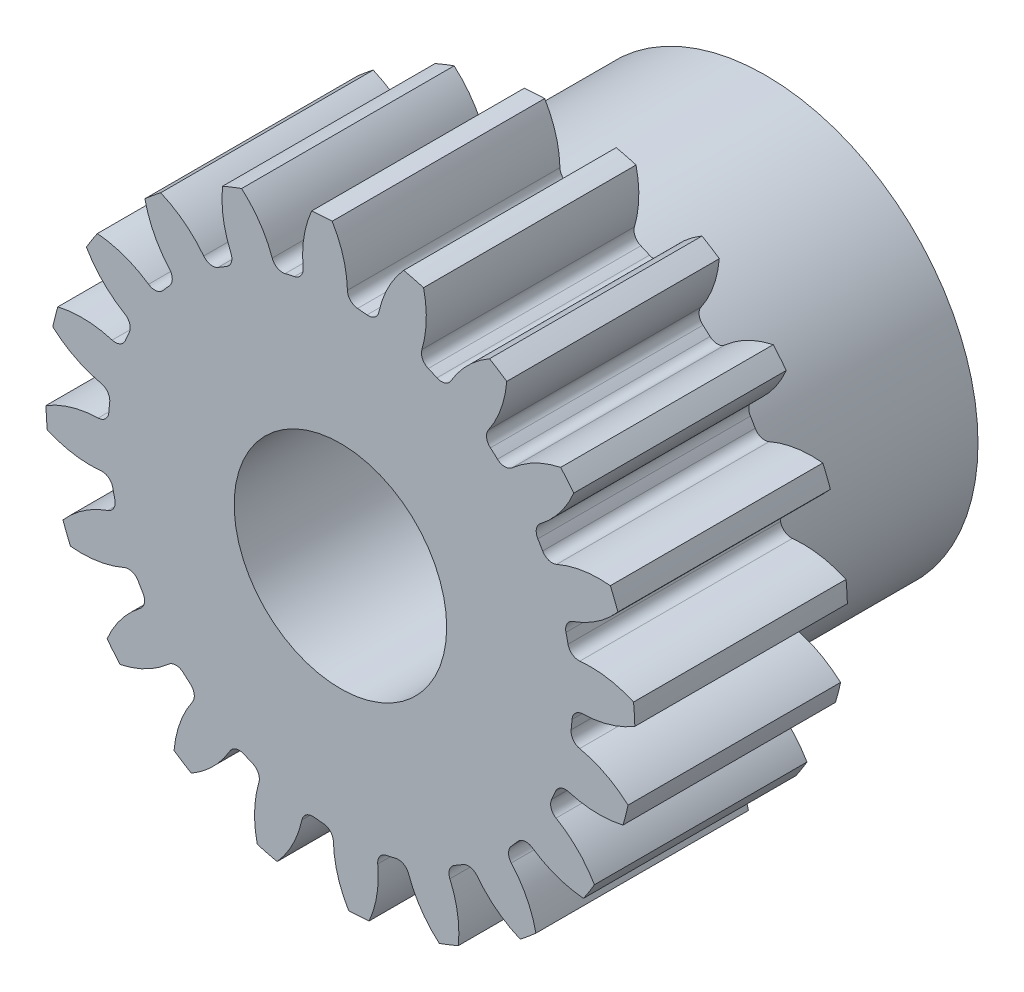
ISO-10303-21;
HEADER;
FILE_DESCRIPTION(('STEP AP214'),'2;1');
FILE_NAME('part.step','',(''),(''),'','','');
FILE_SCHEMA(('AUTOMOTIVE_DESIGN { 1 0 10303 214 1 1 1 1 }'));
ENDSEC;
DATA;
#1=APPLICATION_CONTEXT('core data for automotive mechanical design processes');
#2=APPLICATION_PROTOCOL_DEFINITION('international standard','automotive_design',2000,#1);
#3=PRODUCT_CONTEXT('',#1,'mechanical');
#4=PRODUCT('Part','Part','',(#3));
#5=PRODUCT_RELATED_PRODUCT_CATEGORY('part','',(#4));
#6=PRODUCT_DEFINITION_FORMATION('','',#4);
#7=PRODUCT_DEFINITION_CONTEXT('part definition',#1,'design');
#8=PRODUCT_DEFINITION('design','',#6,#7);
#9=PRODUCT_DEFINITION_SHAPE('','',#8);
#10=(LENGTH_UNIT() NAMED_UNIT(*) SI_UNIT(.MILLI.,.METRE.));
#11=(NAMED_UNIT(*) PLANE_ANGLE_UNIT() SI_UNIT($,.RADIAN.));
#12=(NAMED_UNIT(*) SI_UNIT($,.STERADIAN.) SOLID_ANGLE_UNIT());
#13=UNCERTAINTY_MEASURE_WITH_UNIT(LENGTH_MEASURE(1.E-05),#10,'distance_accuracy_value','');
#14=(GEOMETRIC_REPRESENTATION_CONTEXT(3) GLOBAL_UNCERTAINTY_ASSIGNED_CONTEXT((#13)) GLOBAL_UNIT_ASSIGNED_CONTEXT((#10,
#11,#12)) REPRESENTATION_CONTEXT('',''));
#15=CARTESIAN_POINT('',(0.,0.,0.));
#16=DIRECTION('',(0.,0.,1.));
#17=DIRECTION('',(1.,0.,0.));
#18=AXIS2_PLACEMENT_3D('',#15,#16,#17);
#19=CARTESIAN_POINT('',(0.,0.,0.));
#20=DIRECTION('',(0.,0.,1.));
#21=DIRECTION('',(1.,0.,0.));
#22=AXIS2_PLACEMENT_3D('',#19,#20,#21);
#23=PLANE('',#22);
#24=CARTESIAN_POINT('',(2.42127214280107,-3.02231680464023,0.));
#25=DIRECTION('',(0.,0.,-1.));
#26=DIRECTION('',(0.951056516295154,-0.309016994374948,0.));
#27=AXIS2_PLACEMENT_3D('',#24,#25,#26);
#28=CIRCLE('',#27,1.58716449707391);
#29=CARTESIAN_POINT('',(3.22143344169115,-1.65161149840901,0.));
#30=VERTEX_POINT('',#29);
#31=CARTESIAN_POINT('',(3.79479462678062,-2.22700106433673,0.));
#32=VERTEX_POINT('',#31);
#33=EDGE_CURVE('E1366',#30,#32,#28,.T.);
#34=ORIENTED_EDGE('',*,*,#33,.T.);
#35=CARTESIAN_POINT('',(0.,0.,0.));
#36=DIRECTION('',(0.,0.,1.));
#37=DIRECTION('',(1.,0.,0.));
#38=AXIS2_PLACEMENT_3D('',#35,#36,#37);
#39=CIRCLE('',#38,4.4);
#40=CARTESIAN_POINT('',(3.63076561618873,-2.48546596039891,0.));
#41=VERTEX_POINT('',#40);
#42=EDGE_CURVE('E1566',#41,#32,#39,.T.);
#43=ORIENTED_EDGE('',*,*,#42,.F.);
#44=CARTESIAN_POINT('',(3.76559057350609,-0.904038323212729,0.));
#45=DIRECTION('',(0.,0.,1.));
#46=DIRECTION('',(1.,0.,0.));
#47=AXIS2_PLACEMENT_3D('',#44,#45,#46);
#48=CIRCLE('',#47,1.58716449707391);
#49=CARTESIAN_POINT('',(2.86601557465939,-2.21165293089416,0.));
#50=VERTEX_POINT('',#49);
#51=EDGE_CURVE('E1551',#50,#41,#48,.T.);
#52=ORIENTED_EDGE('',*,*,#51,.F.);
#53=CARTESIAN_POINT('',(2.77331850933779,-2.34639660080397,0.));
#54=DIRECTION('',(0.,0.,1.));
#55=DIRECTION('',(-0.809016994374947,0.587785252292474,0.));
#56=AXIS2_PLACEMENT_3D('',#53,#54,#55);
#57=CIRCLE('',#56,0.16355);
#58=CARTESIAN_POINT('',(2.64846096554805,-2.24075950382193,0.));
#59=VERTEX_POINT('',#58);
#60=EDGE_CURVE('E1334',#50,#59,#57,.T.);
#61=ORIENTED_EDGE('',*,*,#60,.T.);
#62=CARTESIAN_POINT('',(0.,0.,0.));
#63=DIRECTION('',(0.,0.,-1.));
#64=DIRECTION('',(0.809016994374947,-0.587785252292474,0.));
#65=AXIS2_PLACEMENT_3D('',#62,#63,#64);
#66=CIRCLE('',#65,3.4692);
#67=CARTESIAN_POINT('',(2.55500214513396,-2.34676643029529,0.));
#68=VERTEX_POINT('',#67);
#69=EDGE_CURVE('E1348',#59,#68,#66,.T.);
#70=ORIENTED_EDGE('',*,*,#69,.T.);
#71=CARTESIAN_POINT('',(2.675453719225,-2.45740105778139,0.));
#72=DIRECTION('',(0.,0.,1.));
#73=DIRECTION('',(-0.809016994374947,0.587785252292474,0.));
#74=AXIS2_PLACEMENT_3D('',#71,#72,#73);
#75=CIRCLE('',#74,0.16355);
#76=CARTESIAN_POINT('',(2.55338924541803,-2.56625355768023,0.));
#77=VERTEX_POINT('',#76);
#78=EDGE_CURVE('E1351',#68,#77,#75,.T.);
#79=ORIENTED_EDGE('',*,*,#78,.T.);
#80=CARTESIAN_POINT('',(1.36881939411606,-3.62260833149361,0.));
#81=DIRECTION('',(0.,0.,-1.));
#82=DIRECTION('',(0.809016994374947,-0.587785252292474,0.));
#83=AXIS2_PLACEMENT_3D('',#80,#81,#82);
#84=CIRCLE('',#83,1.58716449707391);
#85=CARTESIAN_POINT('',(2.9208829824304,-3.29065990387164,0.));
#86=VERTEX_POINT('',#85);
#87=EDGE_CURVE('E58',#77,#86,#84,.T.);
#88=ORIENTED_EDGE('',*,*,#87,.T.);
#89=CARTESIAN_POINT('',(2.68501207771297,-3.48578687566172,0.));
#90=VERTEX_POINT('',#89);
#91=EDGE_CURVE('E1568',#90,#86,#39,.T.);
#92=ORIENTED_EDGE('',*,*,#91,.F.);
#93=CARTESIAN_POINT('',(3.3019262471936,-2.0234230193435,0.));
#94=DIRECTION('',(0.,0.,1.));
#95=DIRECTION('',(1.,0.,0.));
#96=AXIS2_PLACEMENT_3D('',#93,#94,#95);
#97=CIRCLE('',#96,1.58716449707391);
#98=CARTESIAN_POINT('',(2.04230444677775,-2.9890544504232,0.));
#99=VERTEX_POINT('',#98);
#100=EDGE_CURVE('E1549',#99,#90,#97,.T.);
#101=ORIENTED_EDGE('',*,*,#100,.F.);
#102=CARTESIAN_POINT('',(1.91250621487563,-3.08855832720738,0.));
#103=DIRECTION('',(0.,0.,1.));
#104=DIRECTION('',(-0.587785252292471,0.809016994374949,0.));
#105=AXIS2_PLACEMENT_3D('',#102,#103,#104);
#106=CIRCLE('',#105,0.16355);
#107=CARTESIAN_POINT('',(1.82640329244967,-2.94950837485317,0.));
#108=VERTEX_POINT('',#107);
#109=EDGE_CURVE('E1302',#99,#108,#106,.T.);
#110=ORIENTED_EDGE('',*,*,#109,.T.);
#111=CARTESIAN_POINT('',(0.,0.,0.));
#112=DIRECTION('',(0.,0.,-1.));
#113=DIRECTION('',(0.587785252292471,-0.809016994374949,0.));
#114=AXIS2_PLACEMENT_3D('',#111,#112,#113);
#115=CIRCLE('',#114,3.4692);
#116=CARTESIAN_POINT('',(1.70476073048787,-3.02144658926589,0.));
#117=VERTEX_POINT('',#116);
#118=EDGE_CURVE('E1317',#108,#117,#115,.T.);
#119=ORIENTED_EDGE('',*,*,#118,.T.);
#120=CARTESIAN_POINT('',(1.78512900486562,-3.16388795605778,0.));
#121=DIRECTION('',(0.,0.,1.));
#122=DIRECTION('',(-0.587785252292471,0.809016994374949,0.));
#123=AXIS2_PLACEMENT_3D('',#120,#121,#122);
#124=CIRCLE('',#123,0.16355);
#125=CARTESIAN_POINT('',(1.63540151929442,-3.2296928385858,0.));
#126=VERTEX_POINT('',#125);
#127=EDGE_CURVE('E1320',#117,#126,#124,.T.);
#128=ORIENTED_EDGE('',*,*,#127,.T.);
#129=CARTESIAN_POINT('',(0.182377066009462,-3.86829371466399,0.));
#130=DIRECTION('',(0.,0.,-1.));
#131=DIRECTION('',(0.587785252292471,-0.809016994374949,0.));
#132=AXIS2_PLACEMENT_3D('',#129,#130,#131);
#133=CIRCLE('',#132,1.58716449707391);
#134=CARTESIAN_POINT('',(1.76105496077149,-4.03220602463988,0.));
#135=VERTEX_POINT('',#134);
#136=EDGE_CURVE('E1306',#126,#135,#133,.T.);
#137=ORIENTED_EDGE('',*,*,#136,.T.);
#138=CARTESIAN_POINT('',(1.47643084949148,-4.1448946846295,0.));
#139=VERTEX_POINT('',#138);
#140=EDGE_CURVE('E1574',#139,#135,#39,.T.);
#141=ORIENTED_EDGE('',*,*,#140,.F.);
#142=CARTESIAN_POINT('',(2.51504637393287,-2.94474097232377,0.));
#143=DIRECTION('',(0.,0.,1.));
#144=DIRECTION('',(1.,0.,0.));
#145=AXIS2_PLACEMENT_3D('',#142,#143,#144);
#146=CIRCLE('',#145,1.58716449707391);
#147=CARTESIAN_POINT('',(1.01867833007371,-3.47386649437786,0.));
#148=VERTEX_POINT('',#147);
#149=EDGE_CURVE('E1547',#148,#139,#146,.T.);
#150=ORIENTED_EDGE('',*,*,#149,.F.);
#151=CARTESIAN_POINT('',(0.864484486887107,-3.52839044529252,0.));
#152=DIRECTION('',(0.,0.,1.));
#153=DIRECTION('',(-0.309016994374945,0.951056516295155,0.));
#154=AXIS2_PLACEMENT_3D('',#151,#152,#153);
#155=CIRCLE('',#154,0.16355);
#156=CARTESIAN_POINT('',(0.825564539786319,-3.36953881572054,0.));
#157=VERTEX_POINT('',#156);
#158=EDGE_CURVE('E1270',#148,#157,#155,.T.);
#159=ORIENTED_EDGE('',*,*,#158,.T.);
#160=CARTESIAN_POINT('',(0.,0.,0.));
#161=DIRECTION('',(0.,0.,-1.));
#162=DIRECTION('',(0.309016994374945,-0.951056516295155,0.));
#163=AXIS2_PLACEMENT_3D('',#160,#161,#162);
#164=CIRCLE('',#163,3.4692);
#165=CARTESIAN_POINT('',(0.687645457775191,-3.40036650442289,0.));
#166=VERTEX_POINT('',#165);
#167=EDGE_CURVE('E1285',#157,#166,#164,.T.);
#168=ORIENTED_EDGE('',*,*,#167,.T.);
#169=CARTESIAN_POINT('',(0.720063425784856,-3.56067145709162,0.));
#170=DIRECTION('',(0.,0.,1.));
#171=DIRECTION('',(-0.309016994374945,0.951056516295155,0.));
#172=AXIS2_PLACEMENT_3D('',#169,#170,#171);
#173=CIRCLE('',#172,0.16355);
#174=CARTESIAN_POINT('',(0.557329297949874,-3.5769872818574,0.));
#175=VERTEX_POINT('',#174);
#176=EDGE_CURVE('E1288',#166,#175,#173,.T.);
#177=ORIENTED_EDGE('',*,*,#176,.T.);
#178=CARTESIAN_POINT('',(-1.02191760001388,-3.73532355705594,0.));
#179=DIRECTION('',(0.,0.,-1.));
#180=DIRECTION('',(0.309016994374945,-0.951056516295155,0.));
#181=AXIS2_PLACEMENT_3D('',#178,#179,#180);
#182=CIRCLE('',#181,1.58716449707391);
#183=CARTESIAN_POINT('',(0.428842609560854,-4.37905172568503,0.));
#184=VERTEX_POINT('',#183);
#185=EDGE_CURVE('E1274',#175,#184,#182,.T.);
#186=ORIENTED_EDGE('',*,*,#185,.T.);
#187=CARTESIAN_POINT('',(0.123326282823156,-4.39827132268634,0.));
#188=VERTEX_POINT('',#187);
#189=EDGE_CURVE('E1580',#188,#184,#39,.T.);
#190=ORIENTED_EDGE('',*,*,#189,.F.);
#191=CARTESIAN_POINT('',(1.4819762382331,-3.57780716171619,0.));
#192=DIRECTION('',(0.,0.,1.));
#193=DIRECTION('',(1.,0.,0.));
#194=AXIS2_PLACEMENT_3D('',#191,#192,#193);
#195=CIRCLE('',#194,1.58716449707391);
#196=CARTESIAN_POINT('',(-0.104663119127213,-3.61863228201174,0.));
#197=VERTEX_POINT('',#196);
#198=EDGE_CURVE('E1545',#197,#188,#195,.T.);
#199=ORIENTED_EDGE('',*,*,#198,.F.);
#200=CARTESIAN_POINT('',(-0.268159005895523,-3.62283912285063,0.));
#201=DIRECTION('',(0.,0.,1.));
#202=DIRECTION('',(0.,1.,0.));
#203=AXIS2_PLACEMENT_3D('',#200,#201,#202);
#204=CIRCLE('',#203,0.16355);
#205=CARTESIAN_POINT('',(-0.256086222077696,-3.45973532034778,0.));
#206=VERTEX_POINT('',#205);
#207=EDGE_CURVE('E1238',#197,#206,#204,.T.);
#208=ORIENTED_EDGE('',*,*,#207,.T.);
#209=CARTESIAN_POINT('',(0.,0.,0.));
#210=DIRECTION('',(0.,0.,-1.));
#211=DIRECTION('',(0.,-1.,0.));
#212=AXIS2_PLACEMENT_3D('',#209,#210,#211);
#213=CIRCLE('',#212,3.4692);
#214=CARTESIAN_POINT('',(-0.396781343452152,-3.44643485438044,0.));
#215=VERTEX_POINT('',#214);
#216=EDGE_CURVE('E1253',#206,#215,#213,.T.);
#217=ORIENTED_EDGE('',*,*,#216,.T.);
#218=CARTESIAN_POINT('',(-0.415486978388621,-3.60891162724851,0.));
#219=DIRECTION('',(0.,0.,1.));
#220=DIRECTION('',(0.,1.,0.));
#221=AXIS2_PLACEMENT_3D('',#218,#219,#220);
#222=CIRCLE('',#221,0.16355);
#223=CARTESIAN_POINT('',(-0.575298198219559,-3.57414128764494,0.));
#224=VERTEX_POINT('',#223);
#225=EDGE_CURVE('E1256',#215,#224,#222,.T.);
#226=ORIENTED_EDGE('',*,*,#225,.T.);
#227=CARTESIAN_POINT('',(-2.12617985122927,-3.23671390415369,0.));
#228=DIRECTION('',(0.,0.,-1.));
#229=DIRECTION('',(0.,-1.,0.));
#230=AXIS2_PLACEMENT_3D('',#227,#228,#229);
#231=CIRCLE('',#230,1.58716449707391);
#232=CARTESIAN_POINT('',(-0.94534784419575,-4.29724533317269,0.));
#233=VERTEX_POINT('',#232);
#234=EDGE_CURVE('E1242',#224,#233,#231,.T.);
#235=ORIENTED_EDGE('',*,*,#234,.T.);
#236=CARTESIAN_POINT('',(-1.24185031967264,-4.22111451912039,0.));
#237=VERTEX_POINT('',#236);
#238=EDGE_CURVE('E1586',#237,#233,#39,.T.);
#239=ORIENTED_EDGE('',*,*,#238,.F.);
#240=CARTESIAN_POINT('',(0.303839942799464,-3.86065265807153,0.));
#241=DIRECTION('',(0.,0.,1.));
#242=DIRECTION('',(1.,0.,0.));
#243=AXIS2_PLACEMENT_3D('',#240,#241,#242);
#244=CIRCLE('',#243,1.58716449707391);
#245=CARTESIAN_POINT('',(-1.21775941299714,-3.40918112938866,0.));
#246=VERTEX_POINT('',#245);
#247=EDGE_CURVE('E1543',#246,#237,#244,.T.);
#248=ORIENTED_EDGE('',*,*,#247,.F.);
#249=CARTESIAN_POINT('',(-1.37455322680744,-3.3626590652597,0.));
#250=DIRECTION('',(0.,0.,1.));
#251=DIRECTION('',(0.309016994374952,0.951056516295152,0.));
#252=AXIS2_PLACEMENT_3D('',#249,#250,#251);
#253=CIRCLE('',#252,0.16355);
#254=CARTESIAN_POINT('',(-1.31266948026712,-3.21126882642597,0.));
#255=VERTEX_POINT('',#254);
#256=EDGE_CURVE('E1206',#246,#255,#253,.T.);
#257=ORIENTED_EDGE('',*,*,#256,.T.);
#258=CARTESIAN_POINT('',(0.,0.,0.));
#259=DIRECTION('',(0.,0.,-1.));
#260=DIRECTION('',(-0.309016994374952,-0.951056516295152,0.));
#261=AXIS2_PLACEMENT_3D('',#258,#259,#260);
#262=CIRCLE('',#261,3.4692);
#263=CARTESIAN_POINT('',(-1.44236842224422,-3.15514214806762,0.));
#264=VERTEX_POINT('',#263);
#265=EDGE_CURVE('E1221',#255,#264,#262,.T.);
#266=ORIENTED_EDGE('',*,*,#265,.T.);
#267=CARTESIAN_POINT('',(-1.51036662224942,-3.30388638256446,0.));
#268=DIRECTION('',(0.,0.,1.));
#269=DIRECTION('',(0.309016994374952,0.951056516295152,0.));
#270=AXIS2_PLACEMENT_3D('',#267,#268,#269);
#271=CIRCLE('',#270,0.16355);
#272=CARTESIAN_POINT('',(-1.65161149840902,-3.22143344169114,0.));
#273=VERTEX_POINT('',#272);
#274=EDGE_CURVE('E1224',#264,#273,#271,.T.);
#275=ORIENTED_EDGE('',*,*,#274,.T.);
#276=CARTESIAN_POINT('',(-3.02231680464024,-2.42127214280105,0.));
#277=DIRECTION('',(0.,0.,-1.));
#278=DIRECTION('',(-0.309016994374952,-0.951056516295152,0.));
#279=AXIS2_PLACEMENT_3D('',#276,#277,#278);
#280=CIRCLE('',#279,1.58716449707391);
#281=CARTESIAN_POINT('',(-2.22700106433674,-3.79479462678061,0.));
#282=VERTEX_POINT('',#281);
#283=EDGE_CURVE('E1210',#273,#282,#280,.T.);
#284=ORIENTED_EDGE('',*,*,#283,.T.);
#285=CARTESIAN_POINT('',(-2.48546596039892,-3.63076561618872,0.));
#286=VERTEX_POINT('',#285);
#287=EDGE_CURVE('E1592',#286,#282,#39,.T.);
#288=ORIENTED_EDGE('',*,*,#287,.F.);
#289=CARTESIAN_POINT('',(-0.904038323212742,-3.76559057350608,0.));
#290=DIRECTION('',(0.,0.,1.));
#291=DIRECTION('',(1.,0.,0.));
#292=AXIS2_PLACEMENT_3D('',#289,#290,#291);
#293=CIRCLE('',#292,1.58716449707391);
#294=CARTESIAN_POINT('',(-2.21165293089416,-2.86601557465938,0.));
#295=VERTEX_POINT('',#294);
#296=EDGE_CURVE('E1541',#295,#286,#293,.T.);
#297=ORIENTED_EDGE('',*,*,#296,.F.);
#298=CARTESIAN_POINT('',(-2.34639660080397,-2.77331850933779,0.));
#299=DIRECTION('',(0.,0.,1.));
#300=DIRECTION('',(0.587785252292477,0.809016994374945,0.));
#301=AXIS2_PLACEMENT_3D('',#298,#299,#300);
#302=CIRCLE('',#301,0.16355);
#303=CARTESIAN_POINT('',(-2.24075950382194,-2.64846096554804,0.));
#304=VERTEX_POINT('',#303);
#305=EDGE_CURVE('E1174',#295,#304,#302,.T.);
#306=ORIENTED_EDGE('',*,*,#305,.T.);
#307=CARTESIAN_POINT('',(0.,0.,0.));
#308=DIRECTION('',(0.,0.,-1.));
#309=DIRECTION('',(-0.587785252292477,-0.809016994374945,0.));
#310=AXIS2_PLACEMENT_3D('',#307,#308,#309);
#311=CIRCLE('',#310,3.4692);
#312=CARTESIAN_POINT('',(-2.3467664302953,-2.55500214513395,0.));
#313=VERTEX_POINT('',#312);
#314=EDGE_CURVE('E1189',#304,#313,#311,.T.);
#315=ORIENTED_EDGE('',*,*,#314,.T.);
#316=CARTESIAN_POINT('',(-2.4574010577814,-2.675453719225,0.));
#317=DIRECTION('',(0.,0.,1.));
#318=DIRECTION('',(0.587785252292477,0.809016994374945,0.));
#319=AXIS2_PLACEMENT_3D('',#316,#317,#318);
#320=CIRCLE('',#319,0.16355);
#321=CARTESIAN_POINT('',(-2.56625355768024,-2.55338924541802,0.));
#322=VERTEX_POINT('',#321);
#323=EDGE_CURVE('E1192',#313,#322,#320,.T.);
#324=ORIENTED_EDGE('',*,*,#323,.T.);
#325=CARTESIAN_POINT('',(-3.62260833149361,-1.36881939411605,0.));
#326=DIRECTION('',(0.,0.,-1.));
#327=DIRECTION('',(-0.587785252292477,-0.809016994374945,0.));
#328=AXIS2_PLACEMENT_3D('',#325,#326,#327);
#329=CIRCLE('',#328,1.58716449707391);
#330=CARTESIAN_POINT('',(-3.29065990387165,-2.92088298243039,0.));
#331=VERTEX_POINT('',#330);
#332=EDGE_CURVE('E1178',#322,#331,#329,.T.);
#333=ORIENTED_EDGE('',*,*,#332,.T.);
#334=CARTESIAN_POINT('',(-3.48578687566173,-2.68501207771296,0.));
#335=VERTEX_POINT('',#334);
#336=EDGE_CURVE('E1598',#335,#331,#39,.T.);
#337=ORIENTED_EDGE('',*,*,#336,.F.);
#338=CARTESIAN_POINT('',(-2.02342301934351,-3.30192624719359,0.));
#339=DIRECTION('',(0.,0.,1.));
#340=DIRECTION('',(1.,0.,0.));
#341=AXIS2_PLACEMENT_3D('',#338,#339,#340);
#342=CIRCLE('',#341,1.58716449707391);
#343=CARTESIAN_POINT('',(-2.9890544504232,-2.04230444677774,0.));
#344=VERTEX_POINT('',#343);
#345=EDGE_CURVE('E1539',#344,#335,#342,.T.);
#346=ORIENTED_EDGE('',*,*,#345,.F.);
#347=CARTESIAN_POINT('',(-3.08855832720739,-1.91250621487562,0.));
#348=DIRECTION('',(0.,0.,1.));
#349=DIRECTION('',(0.809016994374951,0.587785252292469,0.));
#350=AXIS2_PLACEMENT_3D('',#347,#348,#349);
#351=CIRCLE('',#350,0.16355);
#352=CARTESIAN_POINT('',(-2.94950837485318,-1.82640329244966,0.));
#353=VERTEX_POINT('',#352);
#354=EDGE_CURVE('E1142',#344,#353,#351,.T.);
#355=ORIENTED_EDGE('',*,*,#354,.T.);
#356=CARTESIAN_POINT('',(0.,0.,0.));
#357=DIRECTION('',(0.,0.,-1.));
#358=DIRECTION('',(-0.809016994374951,-0.587785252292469,0.));
#359=AXIS2_PLACEMENT_3D('',#356,#357,#358);
#360=CIRCLE('',#359,3.4692);
#361=CARTESIAN_POINT('',(-3.02144658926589,-1.70476073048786,0.));
#362=VERTEX_POINT('',#361);
#363=EDGE_CURVE('E1157',#353,#362,#360,.T.);
#364=ORIENTED_EDGE('',*,*,#363,.T.);
#365=CARTESIAN_POINT('',(-3.16388795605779,-1.78512900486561,0.));
#366=DIRECTION('',(0.,0.,1.));
#367=DIRECTION('',(0.809016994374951,0.587785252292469,0.));
#368=AXIS2_PLACEMENT_3D('',#365,#366,#367);
#369=CIRCLE('',#368,0.16355);
#370=CARTESIAN_POINT('',(-3.22969283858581,-1.63540151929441,0.));
#371=VERTEX_POINT('',#370);
#372=EDGE_CURVE('E1160',#362,#371,#369,.T.);
#373=ORIENTED_EDGE('',*,*,#372,.T.);
#374=CARTESIAN_POINT('',(-3.86829371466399,-0.182377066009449,0.));
#375=DIRECTION('',(0.,0.,-1.));
#376=DIRECTION('',(-0.809016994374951,-0.587785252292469,0.));
#377=AXIS2_PLACEMENT_3D('',#374,#375,#376);
#378=CIRCLE('',#377,1.58716449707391);
#379=CARTESIAN_POINT('',(-4.03220602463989,-1.76105496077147,0.));
#380=VERTEX_POINT('',#379);
#381=EDGE_CURVE('E1146',#371,#380,#378,.T.);
#382=ORIENTED_EDGE('',*,*,#381,.T.);
#383=CARTESIAN_POINT('',(-4.1448946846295,-1.47643084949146,0.));
#384=VERTEX_POINT('',#383);
#385=EDGE_CURVE('E1604',#384,#380,#39,.T.);
#386=ORIENTED_EDGE('',*,*,#385,.F.);
#387=CARTESIAN_POINT('',(-2.94474097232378,-2.51504637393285,0.));
#388=DIRECTION('',(0.,0.,1.));
#389=DIRECTION('',(1.,0.,0.));
#390=AXIS2_PLACEMENT_3D('',#387,#388,#389);
#391=CIRCLE('',#390,1.58716449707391);
#392=CARTESIAN_POINT('',(-3.47386649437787,-1.0186783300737,0.));
#393=VERTEX_POINT('',#392);
#394=EDGE_CURVE('E1537',#393,#384,#391,.T.);
#395=ORIENTED_EDGE('',*,*,#394,.F.);
#396=CARTESIAN_POINT('',(-3.52839044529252,-0.864484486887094,0.));
#397=DIRECTION('',(0.,0.,1.));
#398=DIRECTION('',(0.951056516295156,0.309016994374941,0.));
#399=AXIS2_PLACEMENT_3D('',#396,#397,#398);
#400=CIRCLE('',#399,0.16355);
#401=CARTESIAN_POINT('',(-3.36953881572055,-0.825564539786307,0.));
#402=VERTEX_POINT('',#401);
#403=EDGE_CURVE('E1110',#393,#402,#400,.T.);
#404=ORIENTED_EDGE('',*,*,#403,.T.);
#405=CARTESIAN_POINT('',(0.,0.,0.));
#406=DIRECTION('',(0.,0.,-1.));
#407=DIRECTION('',(-0.951056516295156,-0.309016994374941,0.));
#408=AXIS2_PLACEMENT_3D('',#405,#406,#407);
#409=CIRCLE('',#408,3.4692);
#410=CARTESIAN_POINT('',(-3.40036650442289,-0.687645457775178,0.));
#411=VERTEX_POINT('',#410);
#412=EDGE_CURVE('E1125',#402,#411,#409,.T.);
#413=ORIENTED_EDGE('',*,*,#412,.T.);
#414=CARTESIAN_POINT('',(-3.56067145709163,-0.720063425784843,0.));
#415=DIRECTION('',(0.,0.,1.));
#416=DIRECTION('',(0.951056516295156,0.309016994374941,0.));
#417=AXIS2_PLACEMENT_3D('',#414,#415,#416);
#418=CIRCLE('',#417,0.16355);
#419=CARTESIAN_POINT('',(-3.5769872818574,-0.55732929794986,0.));
#420=VERTEX_POINT('',#419);
#421=EDGE_CURVE('E1128',#411,#420,#418,.T.);
#422=ORIENTED_EDGE('',*,*,#421,.T.);
#423=CARTESIAN_POINT('',(-3.73532355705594,1.02191760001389,0.));
#424=DIRECTION('',(0.,0.,-1.));
#425=DIRECTION('',(-0.951056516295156,-0.309016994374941,0.));
#426=AXIS2_PLACEMENT_3D('',#423,#424,#425);
#427=CIRCLE('',#426,1.58716449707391);
#428=CARTESIAN_POINT('',(-4.37905172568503,-0.428842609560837,0.));
#429=VERTEX_POINT('',#428);
#430=EDGE_CURVE('E1114',#420,#429,#427,.T.);
#431=ORIENTED_EDGE('',*,*,#430,.T.);
#432=CARTESIAN_POINT('',(-4.39827132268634,-0.123326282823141,0.));
#433=VERTEX_POINT('',#432);
#434=EDGE_CURVE('E1610',#433,#429,#39,.T.);
#435=ORIENTED_EDGE('',*,*,#434,.F.);
#436=CARTESIAN_POINT('',(-3.57780716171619,-1.48197623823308,0.));
#437=DIRECTION('',(0.,0.,1.));
#438=DIRECTION('',(1.,0.,0.));
#439=AXIS2_PLACEMENT_3D('',#436,#437,#438);
#440=CIRCLE('',#439,1.58716449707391);
#441=CARTESIAN_POINT('',(-3.61863228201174,0.104663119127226,0.));
#442=VERTEX_POINT('',#441);
#443=EDGE_CURVE('E1535',#442,#433,#440,.T.);
#444=ORIENTED_EDGE('',*,*,#443,.F.);
#445=CARTESIAN_POINT('',(-3.62283912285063,0.268159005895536,0.));
#446=DIRECTION('',(0.,0.,1.));
#447=DIRECTION('',(1.,0.,0.));
#448=AXIS2_PLACEMENT_3D('',#445,#446,#447);
#449=CIRCLE('',#448,0.16355);
#450=CARTESIAN_POINT('',(-3.45973532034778,0.256086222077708,0.));
#451=VERTEX_POINT('',#450);
#452=EDGE_CURVE('E1078',#442,#451,#449,.T.);
#453=ORIENTED_EDGE('',*,*,#452,.T.);
#454=CARTESIAN_POINT('',(0.,0.,0.));
#455=DIRECTION('',(0.,0.,-1.));
#456=DIRECTION('',(-1.,0.,0.));
#457=AXIS2_PLACEMENT_3D('',#454,#455,#456);
#458=CIRCLE('',#457,3.4692);
#459=CARTESIAN_POINT('',(-3.44643485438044,0.396781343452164,0.));
#460=VERTEX_POINT('',#459);
#461=EDGE_CURVE('E1093',#451,#460,#458,.T.);
#462=ORIENTED_EDGE('',*,*,#461,.T.);
#463=CARTESIAN_POINT('',(-3.60891162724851,0.415486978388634,0.));
#464=DIRECTION('',(0.,0.,1.));
#465=DIRECTION('',(1.,0.,0.));
#466=AXIS2_PLACEMENT_3D('',#463,#464,#465);
#467=CIRCLE('',#466,0.16355);
#468=CARTESIAN_POINT('',(-3.57414128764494,0.575298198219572,0.));
#469=VERTEX_POINT('',#468);
#470=EDGE_CURVE('E1096',#460,#469,#467,.T.);
#471=ORIENTED_EDGE('',*,*,#470,.T.);
#472=CARTESIAN_POINT('',(-3.23671390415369,2.12617985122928,0.));
#473=DIRECTION('',(0.,0.,-1.));
#474=DIRECTION('',(-1.,0.,0.));
#475=AXIS2_PLACEMENT_3D('',#472,#473,#474);
#476=CIRCLE('',#475,1.58716449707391);
#477=CARTESIAN_POINT('',(-4.29724533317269,0.945347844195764,0.));
#478=VERTEX_POINT('',#477);
#479=EDGE_CURVE('E1082',#469,#478,#476,.T.);
#480=ORIENTED_EDGE('',*,*,#479,.T.);
#481=CARTESIAN_POINT('',(-4.22111451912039,1.24185031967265,0.));
#482=VERTEX_POINT('',#481);
#483=EDGE_CURVE('E1616',#482,#478,#39,.T.);
#484=ORIENTED_EDGE('',*,*,#483,.F.);
#485=CARTESIAN_POINT('',(-3.86065265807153,-0.30383994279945,0.));
#486=DIRECTION('',(0.,0.,1.));
#487=DIRECTION('',(1.,0.,0.));
#488=AXIS2_PLACEMENT_3D('',#485,#486,#487);
#489=CIRCLE('',#488,1.58716449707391);
#490=CARTESIAN_POINT('',(-3.40918112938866,1.21775941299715,0.));
#491=VERTEX_POINT('',#490);
#492=EDGE_CURVE('E1533',#491,#482,#489,.T.);
#493=ORIENTED_EDGE('',*,*,#492,.F.);
#494=CARTESIAN_POINT('',(-3.3626590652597,1.37455322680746,0.));
#495=DIRECTION('',(0.,0.,1.));
#496=DIRECTION('',(0.951056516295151,-0.309016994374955,0.));
#497=AXIS2_PLACEMENT_3D('',#494,#495,#496);
#498=CIRCLE('',#497,0.16355);
#499=CARTESIAN_POINT('',(-3.21126882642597,1.31266948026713,0.));
#500=VERTEX_POINT('',#499);
#501=EDGE_CURVE('E1046',#491,#500,#498,.T.);
#502=ORIENTED_EDGE('',*,*,#501,.T.);
#503=CARTESIAN_POINT('',(0.,0.,0.));
#504=DIRECTION('',(0.,0.,-1.));
#505=DIRECTION('',(-0.951056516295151,0.309016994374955,0.));
#506=AXIS2_PLACEMENT_3D('',#503,#504,#505);
#507=CIRCLE('',#506,3.4692);
#508=CARTESIAN_POINT('',(-3.15514214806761,1.44236842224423,0.));
#509=VERTEX_POINT('',#508);
#510=EDGE_CURVE('E1061',#500,#509,#507,.T.);
#511=ORIENTED_EDGE('',*,*,#510,.T.);
#512=CARTESIAN_POINT('',(-3.30388638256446,1.51036662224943,0.));
#513=DIRECTION('',(0.,0.,1.));
#514=DIRECTION('',(0.951056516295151,-0.309016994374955,0.));
#515=AXIS2_PLACEMENT_3D('',#512,#513,#514);
#516=CIRCLE('',#515,0.16355);
#517=CARTESIAN_POINT('',(-3.22143344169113,1.65161149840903,0.));
#518=VERTEX_POINT('',#517);
#519=EDGE_CURVE('E1064',#509,#518,#516,.T.);
#520=ORIENTED_EDGE('',*,*,#519,.T.);
#521=CARTESIAN_POINT('',(-2.42127214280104,3.02231680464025,0.));
#522=DIRECTION('',(0.,0.,-1.));
#523=DIRECTION('',(-0.951056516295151,0.309016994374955,0.));
#524=AXIS2_PLACEMENT_3D('',#521,#522,#523);
#525=CIRCLE('',#524,1.58716449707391);
#526=CARTESIAN_POINT('',(-3.79479462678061,2.22700106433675,0.));
#527=VERTEX_POINT('',#526);
#528=EDGE_CURVE('E1050',#518,#527,#525,.T.);
#529=ORIENTED_EDGE('',*,*,#528,.T.);
#530=CARTESIAN_POINT('',(-3.63076561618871,2.48546596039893,0.));
#531=VERTEX_POINT('',#530);
#532=EDGE_CURVE('E1622',#531,#527,#39,.T.);
#533=ORIENTED_EDGE('',*,*,#532,.F.);
#534=CARTESIAN_POINT('',(-3.76559057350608,0.904038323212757,0.));
#535=DIRECTION('',(0.,0.,1.));
#536=DIRECTION('',(1.,0.,0.));
#537=AXIS2_PLACEMENT_3D('',#534,#535,#536);
#538=CIRCLE('',#537,1.58716449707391);
#539=CARTESIAN_POINT('',(-2.86601557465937,2.21165293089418,0.));
#540=VERTEX_POINT('',#539);
#541=EDGE_CURVE('E1531',#540,#531,#538,.T.);
#542=ORIENTED_EDGE('',*,*,#541,.F.);
#543=CARTESIAN_POINT('',(-2.77331850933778,2.34639660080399,0.));
#544=DIRECTION('',(0.,0.,1.));
#545=DIRECTION('',(0.809016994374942,-0.58778525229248,0.));
#546=AXIS2_PLACEMENT_3D('',#543,#544,#545);
#547=CIRCLE('',#546,0.16355);
#548=CARTESIAN_POINT('',(-2.64846096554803,2.24075950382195,0.));
#549=VERTEX_POINT('',#548);
#550=EDGE_CURVE('E1014',#540,#549,#547,.T.);
#551=ORIENTED_EDGE('',*,*,#550,.T.);
#552=CARTESIAN_POINT('',(0.,0.,0.));
#553=DIRECTION('',(0.,0.,-1.));
#554=DIRECTION('',(-0.809016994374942,0.58778525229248,0.));
#555=AXIS2_PLACEMENT_3D('',#552,#553,#554);
#556=CIRCLE('',#555,3.4692);
#557=CARTESIAN_POINT('',(-2.55500214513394,2.34676643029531,0.));
#558=VERTEX_POINT('',#557);
#559=EDGE_CURVE('E1029',#549,#558,#556,.T.);
#560=ORIENTED_EDGE('',*,*,#559,.T.);
#561=CARTESIAN_POINT('',(-2.67545371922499,2.45740105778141,0.));
#562=DIRECTION('',(0.,0.,1.));
#563=DIRECTION('',(0.809016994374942,-0.58778525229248,0.));
#564=AXIS2_PLACEMENT_3D('',#561,#562,#563);
#565=CIRCLE('',#564,0.16355);
#566=CARTESIAN_POINT('',(-2.55338924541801,2.56625355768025,0.));
#567=VERTEX_POINT('',#566);
#568=EDGE_CURVE('E1032',#558,#567,#565,.T.);
#569=ORIENTED_EDGE('',*,*,#568,.T.);
#570=CARTESIAN_POINT('',(-1.36881939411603,3.62260833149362,0.));
#571=DIRECTION('',(0.,0.,-1.));
#572=DIRECTION('',(-0.809016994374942,0.58778525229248,0.));
#573=AXIS2_PLACEMENT_3D('',#570,#571,#572);
#574=CIRCLE('',#573,1.58716449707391);
#575=CARTESIAN_POINT('',(-2.92088298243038,3.29065990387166,0.));
#576=VERTEX_POINT('',#575);
#577=EDGE_CURVE('E1018',#567,#576,#574,.T.);
#578=ORIENTED_EDGE('',*,*,#577,.T.);
#579=CARTESIAN_POINT('',(-2.68501207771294,3.48578687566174,0.));
#580=VERTEX_POINT('',#579);
#581=EDGE_CURVE('E1628',#580,#576,#39,.T.);
#582=ORIENTED_EDGE('',*,*,#581,.F.);
#583=CARTESIAN_POINT('',(-3.30192624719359,2.02342301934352,0.));
#584=DIRECTION('',(0.,0.,1.));
#585=DIRECTION('',(1.,0.,0.));
#586=AXIS2_PLACEMENT_3D('',#583,#584,#585);
#587=CIRCLE('',#586,1.58716449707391);
#588=CARTESIAN_POINT('',(-2.04230444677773,2.98905445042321,0.));
#589=VERTEX_POINT('',#588);
#590=EDGE_CURVE('E1529',#589,#580,#587,.T.);
#591=ORIENTED_EDGE('',*,*,#590,.F.);
#592=CARTESIAN_POINT('',(-1.91250621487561,3.0885583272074,0.));
#593=DIRECTION('',(0.,0.,1.));
#594=DIRECTION('',(0.587785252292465,-0.809016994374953,0.));
#595=AXIS2_PLACEMENT_3D('',#592,#593,#594);
#596=CIRCLE('',#595,0.16355);
#597=CARTESIAN_POINT('',(-1.82640329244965,2.94950837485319,0.));
#598=VERTEX_POINT('',#597);
#599=EDGE_CURVE('E982',#589,#598,#596,.T.);
#600=ORIENTED_EDGE('',*,*,#599,.T.);
#601=CARTESIAN_POINT('',(0.,0.,0.));
#602=DIRECTION('',(0.,0.,-1.));
#603=DIRECTION('',(-0.587785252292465,0.809016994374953,0.));
#604=AXIS2_PLACEMENT_3D('',#601,#602,#603);
#605=CIRCLE('',#604,3.4692);
#606=CARTESIAN_POINT('',(-1.70476073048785,3.0214465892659,0.));
#607=VERTEX_POINT('',#606);
#608=EDGE_CURVE('E997',#598,#607,#605,.T.);
#609=ORIENTED_EDGE('',*,*,#608,.T.);
#610=CARTESIAN_POINT('',(-1.7851290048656,3.1638879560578,0.));
#611=DIRECTION('',(0.,0.,1.));
#612=DIRECTION('',(0.587785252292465,-0.809016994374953,0.));
#613=AXIS2_PLACEMENT_3D('',#610,#611,#612);
#614=CIRCLE('',#613,0.16355);
#615=CARTESIAN_POINT('',(-1.6354015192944,3.22969283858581,0.));
#616=VERTEX_POINT('',#615);
#617=EDGE_CURVE('E1000',#607,#616,#614,.T.);
#618=ORIENTED_EDGE('',*,*,#617,.T.);
#619=CARTESIAN_POINT('',(-0.182377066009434,3.86829371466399,0.));
#620=DIRECTION('',(0.,0.,-1.));
#621=DIRECTION('',(-0.587785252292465,0.809016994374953,0.));
#622=AXIS2_PLACEMENT_3D('',#619,#620,#621);
#623=CIRCLE('',#622,1.58716449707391);
#624=CARTESIAN_POINT('',(-1.76105496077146,4.03220602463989,0.));
#625=VERTEX_POINT('',#624);
#626=EDGE_CURVE('E986',#616,#625,#623,.T.);
#627=ORIENTED_EDGE('',*,*,#626,.T.);
#628=CARTESIAN_POINT('',(-1.47643084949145,4.14489468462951,0.));
#629=VERTEX_POINT('',#628);
#630=EDGE_CURVE('E1634',#629,#625,#39,.T.);
#631=ORIENTED_EDGE('',*,*,#630,.F.);
#632=CARTESIAN_POINT('',(-2.51504637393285,2.94474097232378,0.));
#633=DIRECTION('',(0.,0.,1.));
#634=DIRECTION('',(1.,0.,0.));
#635=AXIS2_PLACEMENT_3D('',#632,#633,#634);
#636=CIRCLE('',#635,1.58716449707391);
#637=CARTESIAN_POINT('',(-1.01867833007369,3.47386649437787,0.));
#638=VERTEX_POINT('',#637);
#639=EDGE_CURVE('E1527',#638,#629,#636,.T.);
#640=ORIENTED_EDGE('',*,*,#639,.F.);
#641=CARTESIAN_POINT('',(-0.864484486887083,3.52839044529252,0.));
#642=DIRECTION('',(0.,0.,1.));
#643=DIRECTION('',(0.309016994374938,-0.951056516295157,0.));
#644=AXIS2_PLACEMENT_3D('',#641,#642,#643);
#645=CIRCLE('',#644,0.16355);
#646=CARTESIAN_POINT('',(-0.825564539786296,3.36953881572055,0.));
#647=VERTEX_POINT('',#646);
#648=EDGE_CURVE('E950',#638,#647,#645,.T.);
#649=ORIENTED_EDGE('',*,*,#648,.T.);
#650=CARTESIAN_POINT('',(0.,0.,0.));
#651=DIRECTION('',(0.,0.,-1.));
#652=DIRECTION('',(-0.309016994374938,0.951056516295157,0.));
#653=AXIS2_PLACEMENT_3D('',#650,#651,#652);
#654=CIRCLE('',#653,3.4692);
#655=CARTESIAN_POINT('',(-0.687645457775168,3.4003665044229,0.));
#656=VERTEX_POINT('',#655);
#657=EDGE_CURVE('E965',#647,#656,#654,.T.);
#658=ORIENTED_EDGE('',*,*,#657,.T.);
#659=CARTESIAN_POINT('',(-0.720063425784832,3.56067145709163,0.));
#660=DIRECTION('',(0.,0.,1.));
#661=DIRECTION('',(0.309016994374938,-0.951056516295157,0.));
#662=AXIS2_PLACEMENT_3D('',#659,#660,#661);
#663=CIRCLE('',#662,0.16355);
#664=CARTESIAN_POINT('',(-0.557329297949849,3.5769872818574,0.));
#665=VERTEX_POINT('',#664);
#666=EDGE_CURVE('E968',#656,#665,#663,.T.);
#667=ORIENTED_EDGE('',*,*,#666,.T.);
#668=CARTESIAN_POINT('',(1.0219176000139,3.73532355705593,0.));
#669=DIRECTION('',(0.,0.,-1.));
#670=DIRECTION('',(-0.309016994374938,0.951056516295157,0.));
#671=AXIS2_PLACEMENT_3D('',#668,#669,#670);
#672=CIRCLE('',#671,1.58716449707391);
#673=CARTESIAN_POINT('',(-0.428842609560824,4.37905172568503,0.));
#674=VERTEX_POINT('',#673);
#675=EDGE_CURVE('E954',#665,#674,#672,.T.);
#676=ORIENTED_EDGE('',*,*,#675,.T.);
#677=CARTESIAN_POINT('',(-0.123326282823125,4.39827132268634,0.));
#678=VERTEX_POINT('',#677);
#679=EDGE_CURVE('E1640',#678,#674,#39,.T.);
#680=ORIENTED_EDGE('',*,*,#679,.F.);
#681=CARTESIAN_POINT('',(-1.48197623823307,3.5778071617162,0.));
#682=DIRECTION('',(0.,0.,1.));
#683=DIRECTION('',(1.,0.,0.));
#684=AXIS2_PLACEMENT_3D('',#681,#682,#683);
#685=CIRCLE('',#684,1.58716449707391);
#686=CARTESIAN_POINT('',(0.104663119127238,3.61863228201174,0.));
#687=VERTEX_POINT('',#686);
#688=EDGE_CURVE('E1525',#687,#678,#685,.T.);
#689=ORIENTED_EDGE('',*,*,#688,.F.);
#690=CARTESIAN_POINT('',(0.268159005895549,3.62283912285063,0.));
#691=DIRECTION('',(0.,0.,1.));
#692=DIRECTION('',(0.,-1.,0.));
#693=AXIS2_PLACEMENT_3D('',#690,#691,#692);
#694=CIRCLE('',#693,0.16355);
#695=CARTESIAN_POINT('',(0.25608622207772,3.45973532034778,0.));
#696=VERTEX_POINT('',#695);
#697=EDGE_CURVE('E918',#687,#696,#694,.T.);
#698=ORIENTED_EDGE('',*,*,#697,.T.);
#699=CARTESIAN_POINT('',(0.,0.,0.));
#700=DIRECTION('',(0.,0.,-1.));
#701=DIRECTION('',(0.,1.,0.));
#702=AXIS2_PLACEMENT_3D('',#699,#700,#701);
#703=CIRCLE('',#702,3.4692);
#704=CARTESIAN_POINT('',(0.396781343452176,3.44643485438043,0.));
#705=VERTEX_POINT('',#704);
#706=EDGE_CURVE('E933',#696,#705,#703,.T.);
#707=ORIENTED_EDGE('',*,*,#706,.T.);
#708=CARTESIAN_POINT('',(0.415486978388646,3.60891162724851,0.));
#709=DIRECTION('',(0.,0.,1.));
#710=DIRECTION('',(0.,-1.,0.));
#711=AXIS2_PLACEMENT_3D('',#708,#709,#710);
#712=CIRCLE('',#711,0.16355);
#713=CARTESIAN_POINT('',(0.575298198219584,3.57414128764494,0.));
#714=VERTEX_POINT('',#713);
#715=EDGE_CURVE('E936',#705,#714,#712,.T.);
#716=ORIENTED_EDGE('',*,*,#715,.T.);
#717=CARTESIAN_POINT('',(2.12617985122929,3.23671390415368,0.));
#718=DIRECTION('',(0.,0.,-1.));
#719=DIRECTION('',(0.,1.,0.));
#720=AXIS2_PLACEMENT_3D('',#717,#718,#719);
#721=CIRCLE('',#720,1.58716449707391);
#722=CARTESIAN_POINT('',(0.94534784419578,4.29724533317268,0.));
#723=VERTEX_POINT('',#722);
#724=EDGE_CURVE('E922',#714,#723,#721,.T.);
#725=ORIENTED_EDGE('',*,*,#724,.T.);
#726=CARTESIAN_POINT('',(1.24185031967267,4.22111451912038,0.));
#727=VERTEX_POINT('',#726);
#728=EDGE_CURVE('E1646',#727,#723,#39,.T.);
#729=ORIENTED_EDGE('',*,*,#728,.F.);
#730=CARTESIAN_POINT('',(-0.303839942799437,3.86065265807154,0.));
#731=DIRECTION('',(0.,0.,1.));
#732=DIRECTION('',(1.,0.,0.));
#733=AXIS2_PLACEMENT_3D('',#730,#731,#732);
#734=CIRCLE('',#733,1.58716449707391);
#735=CARTESIAN_POINT('',(1.21775941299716,3.40918112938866,0.));
#736=VERTEX_POINT('',#735);
#737=EDGE_CURVE('E1523',#736,#727,#734,.T.);
#738=ORIENTED_EDGE('',*,*,#737,.F.);
#739=CARTESIAN_POINT('',(1.37455322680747,3.36265906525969,0.));
#740=DIRECTION('',(0.,0.,1.));
#741=DIRECTION('',(-0.309016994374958,-0.95105651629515,0.));
#742=AXIS2_PLACEMENT_3D('',#739,#740,#741);
#743=CIRCLE('',#742,0.16355);
#744=CARTESIAN_POINT('',(1.31266948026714,3.21126882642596,0.));
#745=VERTEX_POINT('',#744);
#746=EDGE_CURVE('E886',#736,#745,#743,.T.);
#747=ORIENTED_EDGE('',*,*,#746,.T.);
#748=CARTESIAN_POINT('',(0.,0.,0.));
#749=DIRECTION('',(0.,0.,-1.));
#750=DIRECTION('',(0.309016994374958,0.95105651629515,0.));
#751=AXIS2_PLACEMENT_3D('',#748,#749,#750);
#752=CIRCLE('',#751,3.4692);
#753=CARTESIAN_POINT('',(1.44236842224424,3.1551421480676,0.));
#754=VERTEX_POINT('',#753);
#755=EDGE_CURVE('E901',#745,#754,#752,.T.);
#756=ORIENTED_EDGE('',*,*,#755,.T.);
#757=CARTESIAN_POINT('',(1.51036662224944,3.30388638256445,0.));
#758=DIRECTION('',(0.,0.,1.));
#759=DIRECTION('',(-0.309016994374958,-0.95105651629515,0.));
#760=AXIS2_PLACEMENT_3D('',#757,#758,#759);
#761=CIRCLE('',#760,0.16355);
#762=CARTESIAN_POINT('',(1.65161149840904,3.22143344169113,0.));
#763=VERTEX_POINT('',#762);
#764=EDGE_CURVE('E904',#754,#763,#761,.T.);
#765=ORIENTED_EDGE('',*,*,#764,.T.);
#766=CARTESIAN_POINT('',(3.02231680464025,2.42127214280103,0.));
#767=DIRECTION('',(0.,0.,-1.));
#768=DIRECTION('',(0.309016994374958,0.95105651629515,0.));
#769=AXIS2_PLACEMENT_3D('',#766,#767,#768);
#770=CIRCLE('',#769,1.58716449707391);
#771=CARTESIAN_POINT('',(2.22700106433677,3.7947946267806,0.));
#772=VERTEX_POINT('',#771);
#773=EDGE_CURVE('E890',#763,#772,#770,.T.);
#774=ORIENTED_EDGE('',*,*,#773,.T.);
#775=CARTESIAN_POINT('',(2.48546596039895,3.6307656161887,0.));
#776=VERTEX_POINT('',#775);
#777=EDGE_CURVE('E1652',#776,#772,#39,.T.);
#778=ORIENTED_EDGE('',*,*,#777,.F.);
#779=CARTESIAN_POINT('',(0.90403832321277,3.76559057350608,0.));
#780=DIRECTION('',(0.,0.,1.));
#781=DIRECTION('',(1.,0.,0.));
#782=AXIS2_PLACEMENT_3D('',#779,#780,#781);
#783=CIRCLE('',#782,1.58716449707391);
#784=CARTESIAN_POINT('',(2.21165293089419,2.86601557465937,0.));
#785=VERTEX_POINT('',#784);
#786=EDGE_CURVE('E1521',#785,#776,#783,.T.);
#787=ORIENTED_EDGE('',*,*,#786,.F.);
#788=CARTESIAN_POINT('',(2.34639660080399,2.77331850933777,0.));
#789=DIRECTION('',(0.,0.,1.));
#790=DIRECTION('',(-0.587785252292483,-0.80901699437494,0.));
#791=AXIS2_PLACEMENT_3D('',#788,#789,#790);
#792=CIRCLE('',#791,0.16355);
#793=CARTESIAN_POINT('',(2.24075950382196,2.64846096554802,0.));
#794=VERTEX_POINT('',#793);
#795=EDGE_CURVE('E854',#785,#794,#792,.T.);
#796=ORIENTED_EDGE('',*,*,#795,.T.);
#797=CARTESIAN_POINT('',(0.,0.,0.));
#798=DIRECTION('',(0.,0.,-1.));
#799=DIRECTION('',(0.587785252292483,0.80901699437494,0.));
#800=AXIS2_PLACEMENT_3D('',#797,#798,#799);
#801=CIRCLE('',#800,3.4692);
#802=CARTESIAN_POINT('',(2.34676643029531,2.55500214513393,0.));
#803=VERTEX_POINT('',#802);
#804=EDGE_CURVE('E869',#794,#803,#801,.T.);
#805=ORIENTED_EDGE('',*,*,#804,.T.);
#806=CARTESIAN_POINT('',(2.45740105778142,2.67545371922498,0.));
#807=DIRECTION('',(0.,0.,1.));
#808=DIRECTION('',(-0.587785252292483,-0.80901699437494,0.));
#809=AXIS2_PLACEMENT_3D('',#806,#807,#808);
#810=CIRCLE('',#809,0.16355);
#811=CARTESIAN_POINT('',(2.56625355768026,2.553389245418,0.));
#812=VERTEX_POINT('',#811);
#813=EDGE_CURVE('E872',#803,#812,#810,.T.);
#814=ORIENTED_EDGE('',*,*,#813,.T.);
#815=CARTESIAN_POINT('',(3.62260833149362,1.36881939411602,0.));
#816=DIRECTION('',(0.,0.,-1.));
#817=DIRECTION('',(0.587785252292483,0.80901699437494,0.));
#818=AXIS2_PLACEMENT_3D('',#815,#816,#817);
#819=CIRCLE('',#818,1.58716449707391);
#820=CARTESIAN_POINT('',(3.29065990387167,2.92088298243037,0.));
#821=VERTEX_POINT('',#820);
#822=EDGE_CURVE('E858',#812,#821,#819,.T.);
#823=ORIENTED_EDGE('',*,*,#822,.T.);
#824=CARTESIAN_POINT('',(3.48578687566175,2.68501207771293,0.));
#825=VERTEX_POINT('',#824);
#826=EDGE_CURVE('E1658',#825,#821,#39,.T.);
#827=ORIENTED_EDGE('',*,*,#826,.F.);
#828=CARTESIAN_POINT('',(2.02342301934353,3.30192624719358,0.));
#829=DIRECTION('',(0.,0.,1.));
#830=DIRECTION('',(1.,0.,0.));
#831=AXIS2_PLACEMENT_3D('',#828,#829,#830);
#832=CIRCLE('',#831,1.58716449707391);
#833=CARTESIAN_POINT('',(2.98905445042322,2.04230444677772,0.));
#834=VERTEX_POINT('',#833);
#835=EDGE_CURVE('E1519',#834,#825,#832,.T.);
#836=ORIENTED_EDGE('',*,*,#835,.F.);
#837=CARTESIAN_POINT('',(3.08855832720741,1.9125062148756,0.));
#838=DIRECTION('',(0.,0.,1.));
#839=DIRECTION('',(-0.809016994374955,-0.587785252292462,0.));
#840=AXIS2_PLACEMENT_3D('',#837,#838,#839);
#841=CIRCLE('',#840,0.16355);
#842=CARTESIAN_POINT('',(2.94950837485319,1.82640329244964,0.));
#843=VERTEX_POINT('',#842);
#844=EDGE_CURVE('E794',#834,#843,#841,.T.);
#845=ORIENTED_EDGE('',*,*,#844,.T.);
#846=CARTESIAN_POINT('',(0.,0.,0.));
#847=DIRECTION('',(0.,0.,-1.));
#848=DIRECTION('',(0.809016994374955,0.587785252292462,0.));
#849=AXIS2_PLACEMENT_3D('',#846,#847,#848);
#850=CIRCLE('',#849,3.4692);
#851=CARTESIAN_POINT('',(3.02144658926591,1.70476073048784,0.));
#852=VERTEX_POINT('',#851);
#853=EDGE_CURVE('E837',#843,#852,#850,.T.);
#854=ORIENTED_EDGE('',*,*,#853,.T.);
#855=CARTESIAN_POINT('',(3.1638879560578,1.78512900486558,0.));
#856=DIRECTION('',(0.,0.,1.));
#857=DIRECTION('',(-0.809016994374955,-0.587785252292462,0.));
#858=AXIS2_PLACEMENT_3D('',#855,#856,#857);
#859=CIRCLE('',#858,0.16355);
#860=CARTESIAN_POINT('',(3.22969283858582,1.63540151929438,0.));
#861=VERTEX_POINT('',#860);
#862=EDGE_CURVE('E840',#852,#861,#859,.T.);
#863=ORIENTED_EDGE('',*,*,#862,.T.);
#864=CARTESIAN_POINT('',(3.868293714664,0.18237706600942,0.));
#865=DIRECTION('',(0.,0.,-1.));
#866=DIRECTION('',(0.809016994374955,0.587785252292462,0.));
#867=AXIS2_PLACEMENT_3D('',#864,#865,#866);
#868=CIRCLE('',#867,1.58716449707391);
#869=CARTESIAN_POINT('',(4.0322060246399,1.76105496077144,0.));
#870=VERTEX_POINT('',#869);
#871=EDGE_CURVE('E826',#861,#870,#868,.T.);
#872=ORIENTED_EDGE('',*,*,#871,.T.);
#873=CARTESIAN_POINT('',(4.14489468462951,1.47643084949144,0.));
#874=VERTEX_POINT('',#873);
#875=EDGE_CURVE('E1515',#874,#870,#39,.T.);
#876=ORIENTED_EDGE('',*,*,#875,.F.);
#877=CARTESIAN_POINT('',(2.94474097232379,2.51504637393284,0.));
#878=DIRECTION('',(0.,0.,1.));
#879=DIRECTION('',(1.,0.,0.));
#880=AXIS2_PLACEMENT_3D('',#877,#878,#879);
#881=CIRCLE('',#880,1.58716449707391);
#882=CARTESIAN_POINT('',(3.47386649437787,1.01867833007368,0.));
#883=VERTEX_POINT('',#882);
#884=EDGE_CURVE('E1517',#883,#874,#881,.T.);
#885=ORIENTED_EDGE('',*,*,#884,.F.);
#886=CARTESIAN_POINT('',(3.52839044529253,0.864484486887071,0.));
#887=DIRECTION('',(0.,0.,1.));
#888=DIRECTION('',(-0.951056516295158,-0.309016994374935,0.));
#889=AXIS2_PLACEMENT_3D('',#886,#887,#888);
#890=CIRCLE('',#889,0.16355);
#891=CARTESIAN_POINT('',(3.36953881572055,0.825564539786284,0.));
#892=VERTEX_POINT('',#891);
#893=EDGE_CURVE('E810',#883,#892,#890,.T.);
#894=ORIENTED_EDGE('',*,*,#893,.T.);
#895=CARTESIAN_POINT('',(0.,0.,0.));
#896=DIRECTION('',(0.,0.,-1.));
#897=DIRECTION('',(0.951056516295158,0.309016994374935,0.));
#898=AXIS2_PLACEMENT_3D('',#895,#896,#897);
#899=CIRCLE('',#898,3.4692);
#900=CARTESIAN_POINT('',(3.4003665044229,0.687645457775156,0.));
#901=VERTEX_POINT('',#900);
#902=EDGE_CURVE('E793',#892,#901,#899,.T.);
#903=ORIENTED_EDGE('',*,*,#902,.T.);
#904=CARTESIAN_POINT('',(3.56067145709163,0.72006342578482,0.));
#905=DIRECTION('',(0.,0.,1.));
#906=DIRECTION('',(-0.951056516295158,-0.309016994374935,0.));
#907=AXIS2_PLACEMENT_3D('',#904,#905,#906);
#908=CIRCLE('',#907,0.16355);
#909=CARTESIAN_POINT('',(3.57698728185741,0.557329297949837,0.));
#910=VERTEX_POINT('',#909);
#911=EDGE_CURVE('E814',#901,#910,#908,.T.);
#912=ORIENTED_EDGE('',*,*,#911,.T.);
#913=CARTESIAN_POINT('',(3.73532355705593,-1.02191760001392,0.));
#914=DIRECTION('',(0.,0.,-1.));
#915=DIRECTION('',(0.951056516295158,0.309016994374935,0.));
#916=AXIS2_PLACEMENT_3D('',#913,#914,#915);
#917=CIRCLE('',#916,1.58716449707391);
#918=CARTESIAN_POINT('',(4.37905172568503,0.428842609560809,0.));
#919=VERTEX_POINT('',#918);
#920=EDGE_CURVE('E787',#910,#919,#917,.T.);
#921=ORIENTED_EDGE('',*,*,#920,.T.);
#922=CARTESIAN_POINT('',(4.39827132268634,0.123326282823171,0.));
#923=VERTEX_POINT('',#922);
#924=EDGE_CURVE('E1512',#923,#919,#39,.T.);
#925=ORIENTED_EDGE('',*,*,#924,.F.);
#926=CARTESIAN_POINT('',(3.57780716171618,1.48197623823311,0.));
#927=DIRECTION('',(0.,0.,1.));
#928=DIRECTION('',(1.,0.,0.));
#929=AXIS2_PLACEMENT_3D('',#926,#927,#928);
#930=CIRCLE('',#929,1.58716449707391);
#931=CARTESIAN_POINT('',(3.61863228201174,-0.104663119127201,0.));
#932=VERTEX_POINT('',#931);
#933=EDGE_CURVE('E1509',#932,#923,#930,.T.);
#934=ORIENTED_EDGE('',*,*,#933,.F.);
#935=CARTESIAN_POINT('',(3.62283912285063,-0.268159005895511,0.));
#936=DIRECTION('',(0.,0.,1.));
#937=DIRECTION('',(-1.,0.,0.));
#938=AXIS2_PLACEMENT_3D('',#935,#936,#937);
#939=CIRCLE('',#938,0.16355);
#940=CARTESIAN_POINT('',(3.45973532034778,-0.256086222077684,0.));
#941=VERTEX_POINT('',#940);
#942=EDGE_CURVE('E1467',#932,#941,#939,.T.);
#943=ORIENTED_EDGE('',*,*,#942,.T.);
#944=CARTESIAN_POINT('',(0.,0.,0.));
#945=DIRECTION('',(0.,0.,-1.));
#946=DIRECTION('',(1.,0.,0.));
#947=AXIS2_PLACEMENT_3D('',#944,#945,#946);
#948=CIRCLE('',#947,3.4692);
#949=CARTESIAN_POINT('',(3.44643485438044,-0.39678134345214,0.));
#950=VERTEX_POINT('',#949);
#951=EDGE_CURVE('E1483',#941,#950,#948,.T.);
#952=ORIENTED_EDGE('',*,*,#951,.T.);
#953=CARTESIAN_POINT('',(3.60891162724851,-0.415486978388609,0.));
#954=DIRECTION('',(0.,0.,1.));
#955=DIRECTION('',(-1.,0.,0.));
#956=AXIS2_PLACEMENT_3D('',#953,#954,#955);
#957=CIRCLE('',#956,0.16355);
#958=CARTESIAN_POINT('',(3.57414128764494,-0.575298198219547,0.));
#959=VERTEX_POINT('',#958);
#960=EDGE_CURVE('E1486',#950,#959,#957,.T.);
#961=ORIENTED_EDGE('',*,*,#960,.T.);
#962=CARTESIAN_POINT('',(3.2367139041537,-2.12617985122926,0.));
#963=DIRECTION('',(0.,0.,-1.));
#964=DIRECTION('',(1.,0.,0.));
#965=AXIS2_PLACEMENT_3D('',#962,#963,#964);
#966=CIRCLE('',#965,1.58716449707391);
#967=CARTESIAN_POINT('',(4.29724533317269,-0.945347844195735,0.));
#968=VERTEX_POINT('',#967);
#969=EDGE_CURVE('E1471',#959,#968,#966,.T.);
#970=ORIENTED_EDGE('',*,*,#969,.T.);
#971=CARTESIAN_POINT('',(4.22111451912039,-1.24185031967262,0.));
#972=VERTEX_POINT('',#971);
#973=EDGE_CURVE('E1505',#972,#968,#39,.T.);
#974=ORIENTED_EDGE('',*,*,#973,.F.);
#975=CARTESIAN_POINT('',(3.86065265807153,0.303839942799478,0.));
#976=DIRECTION('',(0.,0.,1.));
#977=DIRECTION('',(1.,0.,0.));
#978=AXIS2_PLACEMENT_3D('',#975,#976,#977);
#979=CIRCLE('',#978,1.58716449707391);
#980=CARTESIAN_POINT('',(3.40918112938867,-1.21775941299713,0.));
#981=VERTEX_POINT('',#980);
#982=EDGE_CURVE('E43',#981,#972,#979,.T.);
#983=ORIENTED_EDGE('',*,*,#982,.F.);
#984=CARTESIAN_POINT('',(3.36265906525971,-1.37455322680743,0.));
#985=DIRECTION('',(0.,0.,1.));
#986=DIRECTION('',(-0.951056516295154,0.309016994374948,0.));
#987=AXIS2_PLACEMENT_3D('',#984,#985,#986);
#988=CIRCLE('',#987,0.16355);
#989=CARTESIAN_POINT('',(3.21126882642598,-1.31266948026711,0.));
#990=VERTEX_POINT('',#989);
#991=EDGE_CURVE('E50',#981,#990,#988,.T.);
#992=ORIENTED_EDGE('',*,*,#991,.T.);
#993=CARTESIAN_POINT('',(0.,0.,0.));
#994=DIRECTION('',(0.,0.,-1.));
#995=DIRECTION('',(0.951056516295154,-0.309016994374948,0.));
#996=AXIS2_PLACEMENT_3D('',#993,#994,#995);
#997=CIRCLE('',#996,3.4692);
#998=CARTESIAN_POINT('',(3.15514214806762,-1.44236842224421,0.));
#999=VERTEX_POINT('',#998);
#1000=EDGE_CURVE('E1376',#990,#999,#997,.T.);
#1001=ORIENTED_EDGE('',*,*,#1000,.T.);
#1002=CARTESIAN_POINT('',(3.30388638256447,-1.51036662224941,0.));
#1003=DIRECTION('',(0.,0.,1.));
#1004=DIRECTION('',(-0.951056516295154,0.309016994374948,0.));
#1005=AXIS2_PLACEMENT_3D('',#1002,#1003,#1004);
#1006=CIRCLE('',#1005,0.16355);
#1007=EDGE_CURVE('E1379',#999,#30,#1006,.T.);
#1008=ORIENTED_EDGE('',*,*,#1007,.T.);
#1009=EDGE_LOOP('',(#34,#43,#52,#61,#70,#79,#88,#92,#101,#110,#119,#128,#137,#141,#150,#159,
#168,#177,#186,#190,#199,#208,#217,#226,#235,#239,#248,#257,#266,#275,#284,#288,#297,#306,#315,
#324,#333,#337,#346,#355,#364,#373,#382,#386,#395,#404,#413,#422,#431,#435,#444,#453,#462,#471,
#480,#484,#493,#502,#511,#520,#529,#533,#542,#551,#560,#569,#578,#582,#591,#600,#609,#618,#627,
#631,#640,#649,#658,#667,#676,#680,#689,#698,#707,#716,#725,#729,#738,#747,#756,#765,#774,#778,
#787,#796,#805,#814,#823,#827,#836,#845,#854,#863,#872,#876,#885,#894,#903,#912,#921,#925,#934,
#943,#952,#961,#970,#974,#983,#992,#1001,#1008));
#1010=FACE_BOUND('',#1009,.T.);
#1011=CARTESIAN_POINT('',(0.,0.,0.));
#1012=DIRECTION('',(0.,0.,1.));
#1013=DIRECTION('',(1.,0.,0.));
#1014=AXIS2_PLACEMENT_3D('',#1011,#1012,#1013);
#1015=CIRCLE('',#1014,3.175);
#1016=CARTESIAN_POINT('',(3.175,0.,0.));
#1017=VERTEX_POINT('',#1016);
#1018=EDGE_CURVE('E11',#1017,#1017,#1015,.F.);
#1019=ORIENTED_EDGE('',*,*,#1018,.F.);
#1020=EDGE_LOOP('',(#1019));
#1021=FACE_BOUND('',#1020,.T.);
#1022=ADVANCED_FACE('F34',(#1010,#1021),#23,.F.);
#1023=CARTESIAN_POINT('',(0.,0.,3.175));
#1024=DIRECTION('',(0.,0.,-1.));
#1025=DIRECTION('',(-1.,0.,0.));
#1026=AXIS2_PLACEMENT_3D('',#1023,#1024,#1025);
#1027=CYLINDRICAL_SURFACE('',#1026,4.4);
#1028=DIRECTION('',(0.,0.,-1.));
#1029=VECTOR('',#1028,1.);
#1030=CARTESIAN_POINT('',(3.79479462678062,-2.22700106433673,1.5875));
#1031=LINE('',#1030,#1029);
#1032=CARTESIAN_POINT('',(3.79479462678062,-2.22700106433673,3.175));
#1033=VERTEX_POINT('',#1032);
#1034=EDGE_CURVE('E1465',#1033,#32,#1031,.T.);
#1035=ORIENTED_EDGE('',*,*,#1034,.F.);
#1036=CARTESIAN_POINT('',(0.,0.,3.175));
#1037=DIRECTION('',(0.,0.,1.));
#1038=DIRECTION('',(1.,0.,0.));
#1039=AXIS2_PLACEMENT_3D('',#1036,#1037,#1038);
#1040=CIRCLE('',#1039,4.4);
#1041=CARTESIAN_POINT('',(3.63076561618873,-2.48546596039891,3.175));
#1042=VERTEX_POINT('',#1041);
#1043=EDGE_CURVE('E1765',#1042,#1033,#1040,.T.);
#1044=ORIENTED_EDGE('',*,*,#1043,.F.);
#1045=DIRECTION('',(0.,0.,-1.));
#1046=VECTOR('',#1045,1.);
#1047=CARTESIAN_POINT('',(3.63076561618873,-2.48546596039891,1.5875));
#1048=LINE('',#1047,#1046);
#1049=EDGE_CURVE('E1461',#41,#1042,#1048,.F.);
#1050=ORIENTED_EDGE('',*,*,#1049,.F.);
#1051=ORIENTED_EDGE('',*,*,#42,.T.);
#1052=EDGE_LOOP('',(#1035,#1044,#1050,#1051));
#1053=FACE_BOUND('',#1052,.T.);
#1054=ADVANCED_FACE('F36',(#1053),#1027,.T.);
#1055=DIRECTION('',(0.,0.,-1.));
#1056=VECTOR('',#1055,1.);
#1057=CARTESIAN_POINT('',(4.22111451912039,-1.24185031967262,1.5875));
#1058=LINE('',#1057,#1056);
#1059=CARTESIAN_POINT('',(4.22111451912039,-1.24185031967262,3.175));
#1060=VERTEX_POINT('',#1059);
#1061=EDGE_CURVE('E1463',#972,#1060,#1058,.F.);
#1062=ORIENTED_EDGE('',*,*,#1061,.F.);
#1063=ORIENTED_EDGE('',*,*,#973,.T.);
#1064=DIRECTION('',(0.,0.,-1.));
#1065=VECTOR('',#1064,1.);
#1066=CARTESIAN_POINT('',(4.29724533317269,-0.945347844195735,1.5875));
#1067=LINE('',#1066,#1065);
#1068=CARTESIAN_POINT('',(4.29724533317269,-0.945347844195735,3.175));
#1069=VERTEX_POINT('',#1068);
#1070=EDGE_CURVE('E1502',#1069,#968,#1067,.T.);
#1071=ORIENTED_EDGE('',*,*,#1070,.F.);
#1072=EDGE_CURVE('E1511',#1060,#1069,#1040,.T.);
#1073=ORIENTED_EDGE('',*,*,#1072,.F.);
#1074=EDGE_LOOP('',(#1062,#1063,#1071,#1073));
#1075=FACE_BOUND('',#1074,.T.);
#1076=ADVANCED_FACE('F1562',(#1075),#1027,.T.);
#1077=DIRECTION('',(0.,0.,-1.));
#1078=VECTOR('',#1077,1.);
#1079=CARTESIAN_POINT('',(2.9208829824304,-3.29065990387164,1.5875));
#1080=LINE('',#1079,#1078);
#1081=CARTESIAN_POINT('',(2.9208829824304,-3.29065990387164,3.175));
#1082=VERTEX_POINT('',#1081);
#1083=EDGE_CURVE('E1459',#1082,#86,#1080,.T.);
#1084=ORIENTED_EDGE('',*,*,#1083,.F.);
#1085=CARTESIAN_POINT('',(2.68501207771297,-3.48578687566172,3.175));
#1086=VERTEX_POINT('',#1085);
#1087=EDGE_CURVE('E1760',#1086,#1082,#1040,.T.);
#1088=ORIENTED_EDGE('',*,*,#1087,.F.);
#1089=DIRECTION('',(0.,0.,-1.));
#1090=VECTOR('',#1089,1.);
#1091=CARTESIAN_POINT('',(2.68501207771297,-3.48578687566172,1.5875));
#1092=LINE('',#1091,#1090);
#1093=EDGE_CURVE('E1457',#90,#1086,#1092,.F.);
#1094=ORIENTED_EDGE('',*,*,#1093,.F.);
#1095=ORIENTED_EDGE('',*,*,#91,.T.);
#1096=EDGE_LOOP('',(#1084,#1088,#1094,#1095));
#1097=FACE_BOUND('',#1096,.T.);
#1098=ADVANCED_FACE('F2751',(#1097),#1027,.T.);
#1099=DIRECTION('',(0.,0.,-1.));
#1100=VECTOR('',#1099,1.);
#1101=CARTESIAN_POINT('',(1.76105496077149,-4.03220602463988,1.5875));
#1102=LINE('',#1101,#1100);
#1103=CARTESIAN_POINT('',(1.76105496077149,-4.03220602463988,3.175));
#1104=VERTEX_POINT('',#1103);
#1105=EDGE_CURVE('E1455',#1104,#135,#1102,.T.);
#1106=ORIENTED_EDGE('',*,*,#1105,.F.);
#1107=CARTESIAN_POINT('',(1.47643084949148,-4.1448946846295,3.175));
#1108=VERTEX_POINT('',#1107);
#1109=EDGE_CURVE('E1755',#1108,#1104,#1040,.T.);
#1110=ORIENTED_EDGE('',*,*,#1109,.F.);
#1111=DIRECTION('',(0.,0.,-1.));
#1112=VECTOR('',#1111,1.);
#1113=CARTESIAN_POINT('',(1.47643084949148,-4.1448946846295,1.5875));
#1114=LINE('',#1113,#1112);
#1115=EDGE_CURVE('E1453',#139,#1108,#1114,.F.);
#1116=ORIENTED_EDGE('',*,*,#1115,.F.);
#1117=ORIENTED_EDGE('',*,*,#140,.T.);
#1118=EDGE_LOOP('',(#1106,#1110,#1116,#1117));
#1119=FACE_BOUND('',#1118,.T.);
#1120=ADVANCED_FACE('F2743',(#1119),#1027,.T.);
#1121=DIRECTION('',(0.,0.,-1.));
#1122=VECTOR('',#1121,1.);
#1123=CARTESIAN_POINT('',(0.428842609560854,-4.37905172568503,1.5875));
#1124=LINE('',#1123,#1122);
#1125=CARTESIAN_POINT('',(0.428842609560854,-4.37905172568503,3.175));
#1126=VERTEX_POINT('',#1125);
#1127=EDGE_CURVE('E1451',#1126,#184,#1124,.T.);
#1128=ORIENTED_EDGE('',*,*,#1127,.F.);
#1129=CARTESIAN_POINT('',(0.123326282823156,-4.39827132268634,3.175));
#1130=VERTEX_POINT('',#1129);
#1131=EDGE_CURVE('E1750',#1130,#1126,#1040,.T.);
#1132=ORIENTED_EDGE('',*,*,#1131,.F.);
#1133=DIRECTION('',(0.,0.,-1.));
#1134=VECTOR('',#1133,1.);
#1135=CARTESIAN_POINT('',(0.123326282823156,-4.39827132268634,1.5875));
#1136=LINE('',#1135,#1134);
#1137=EDGE_CURVE('E1449',#188,#1130,#1136,.F.);
#1138=ORIENTED_EDGE('',*,*,#1137,.F.);
#1139=ORIENTED_EDGE('',*,*,#189,.T.);
#1140=EDGE_LOOP('',(#1128,#1132,#1138,#1139));
#1141=FACE_BOUND('',#1140,.T.);
#1142=ADVANCED_FACE('F2735',(#1141),#1027,.T.);
#1143=DIRECTION('',(0.,0.,-1.));
#1144=VECTOR('',#1143,1.);
#1145=CARTESIAN_POINT('',(-0.94534784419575,-4.29724533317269,1.5875));
#1146=LINE('',#1145,#1144);
#1147=CARTESIAN_POINT('',(-0.94534784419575,-4.29724533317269,3.175));
#1148=VERTEX_POINT('',#1147);
#1149=EDGE_CURVE('E1447',#1148,#233,#1146,.T.);
#1150=ORIENTED_EDGE('',*,*,#1149,.F.);
#1151=CARTESIAN_POINT('',(-1.24185031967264,-4.22111451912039,3.175));
#1152=VERTEX_POINT('',#1151);
#1153=EDGE_CURVE('E1745',#1152,#1148,#1040,.T.);
#1154=ORIENTED_EDGE('',*,*,#1153,.F.);
#1155=DIRECTION('',(0.,0.,-1.));
#1156=VECTOR('',#1155,1.);
#1157=CARTESIAN_POINT('',(-1.24185031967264,-4.22111451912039,1.5875));
#1158=LINE('',#1157,#1156);
#1159=EDGE_CURVE('E1445',#237,#1152,#1158,.F.);
#1160=ORIENTED_EDGE('',*,*,#1159,.F.);
#1161=ORIENTED_EDGE('',*,*,#238,.T.);
#1162=EDGE_LOOP('',(#1150,#1154,#1160,#1161));
#1163=FACE_BOUND('',#1162,.T.);
#1164=ADVANCED_FACE('F2727',(#1163),#1027,.T.);
#1165=DIRECTION('',(0.,0.,-1.));
#1166=VECTOR('',#1165,1.);
#1167=CARTESIAN_POINT('',(-2.22700106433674,-3.79479462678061,1.5875));
#1168=LINE('',#1167,#1166);
#1169=CARTESIAN_POINT('',(-2.22700106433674,-3.79479462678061,3.175));
#1170=VERTEX_POINT('',#1169);
#1171=EDGE_CURVE('E1443',#1170,#282,#1168,.T.);
#1172=ORIENTED_EDGE('',*,*,#1171,.F.);
#1173=CARTESIAN_POINT('',(-2.48546596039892,-3.63076561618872,3.175));
#1174=VERTEX_POINT('',#1173);
#1175=EDGE_CURVE('E1740',#1174,#1170,#1040,.T.);
#1176=ORIENTED_EDGE('',*,*,#1175,.F.);
#1177=DIRECTION('',(0.,0.,-1.));
#1178=VECTOR('',#1177,1.);
#1179=CARTESIAN_POINT('',(-2.48546596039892,-3.63076561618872,1.5875));
#1180=LINE('',#1179,#1178);
#1181=EDGE_CURVE('E1441',#286,#1174,#1180,.F.);
#1182=ORIENTED_EDGE('',*,*,#1181,.F.);
#1183=ORIENTED_EDGE('',*,*,#287,.T.);
#1184=EDGE_LOOP('',(#1172,#1176,#1182,#1183));
#1185=FACE_BOUND('',#1184,.T.);
#1186=ADVANCED_FACE('F2719',(#1185),#1027,.T.);
#1187=DIRECTION('',(0.,0.,-1.));
#1188=VECTOR('',#1187,1.);
#1189=CARTESIAN_POINT('',(-3.29065990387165,-2.92088298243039,1.5875));
#1190=LINE('',#1189,#1188);
#1191=CARTESIAN_POINT('',(-3.29065990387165,-2.92088298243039,3.175));
#1192=VERTEX_POINT('',#1191);
#1193=EDGE_CURVE('E1439',#1192,#331,#1190,.T.);
#1194=ORIENTED_EDGE('',*,*,#1193,.F.);
#1195=CARTESIAN_POINT('',(-3.48578687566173,-2.68501207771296,3.175));
#1196=VERTEX_POINT('',#1195);
#1197=EDGE_CURVE('E1735',#1196,#1192,#1040,.T.);
#1198=ORIENTED_EDGE('',*,*,#1197,.F.);
#1199=DIRECTION('',(0.,0.,-1.));
#1200=VECTOR('',#1199,1.);
#1201=CARTESIAN_POINT('',(-3.48578687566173,-2.68501207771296,1.5875));
#1202=LINE('',#1201,#1200);
#1203=EDGE_CURVE('E1437',#335,#1196,#1202,.F.);
#1204=ORIENTED_EDGE('',*,*,#1203,.F.);
#1205=ORIENTED_EDGE('',*,*,#336,.T.);
#1206=EDGE_LOOP('',(#1194,#1198,#1204,#1205));
#1207=FACE_BOUND('',#1206,.T.);
#1208=ADVANCED_FACE('F2711',(#1207),#1027,.T.);
#1209=DIRECTION('',(0.,0.,-1.));
#1210=VECTOR('',#1209,1.);
#1211=CARTESIAN_POINT('',(-4.03220602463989,-1.76105496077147,1.5875));
#1212=LINE('',#1211,#1210);
#1213=CARTESIAN_POINT('',(-4.03220602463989,-1.76105496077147,3.175));
#1214=VERTEX_POINT('',#1213);
#1215=EDGE_CURVE('E1435',#1214,#380,#1212,.T.);
#1216=ORIENTED_EDGE('',*,*,#1215,.F.);
#1217=CARTESIAN_POINT('',(-4.1448946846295,-1.47643084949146,3.175));
#1218=VERTEX_POINT('',#1217);
#1219=EDGE_CURVE('E1730',#1218,#1214,#1040,.T.);
#1220=ORIENTED_EDGE('',*,*,#1219,.F.);
#1221=DIRECTION('',(0.,0.,-1.));
#1222=VECTOR('',#1221,1.);
#1223=CARTESIAN_POINT('',(-4.1448946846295,-1.47643084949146,1.5875));
#1224=LINE('',#1223,#1222);
#1225=EDGE_CURVE('E1433',#384,#1218,#1224,.F.);
#1226=ORIENTED_EDGE('',*,*,#1225,.F.);
#1227=ORIENTED_EDGE('',*,*,#385,.T.);
#1228=EDGE_LOOP('',(#1216,#1220,#1226,#1227));
#1229=FACE_BOUND('',#1228,.T.);
#1230=ADVANCED_FACE('F2703',(#1229),#1027,.T.);
#1231=DIRECTION('',(0.,0.,-1.));
#1232=VECTOR('',#1231,1.);
#1233=CARTESIAN_POINT('',(-4.37905172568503,-0.428842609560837,1.5875));
#1234=LINE('',#1233,#1232);
#1235=CARTESIAN_POINT('',(-4.37905172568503,-0.428842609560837,3.175));
#1236=VERTEX_POINT('',#1235);
#1237=EDGE_CURVE('E1431',#1236,#429,#1234,.T.);
#1238=ORIENTED_EDGE('',*,*,#1237,.F.);
#1239=CARTESIAN_POINT('',(-4.39827132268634,-0.123326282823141,3.175));
#1240=VERTEX_POINT('',#1239);
#1241=EDGE_CURVE('E1725',#1240,#1236,#1040,.T.);
#1242=ORIENTED_EDGE('',*,*,#1241,.F.);
#1243=DIRECTION('',(0.,0.,-1.));
#1244=VECTOR('',#1243,1.);
#1245=CARTESIAN_POINT('',(-4.39827132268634,-0.123326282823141,1.5875));
#1246=LINE('',#1245,#1244);
#1247=EDGE_CURVE('E1429',#433,#1240,#1246,.F.);
#1248=ORIENTED_EDGE('',*,*,#1247,.F.);
#1249=ORIENTED_EDGE('',*,*,#434,.T.);
#1250=EDGE_LOOP('',(#1238,#1242,#1248,#1249));
#1251=FACE_BOUND('',#1250,.T.);
#1252=ADVANCED_FACE('F2695',(#1251),#1027,.T.);
#1253=DIRECTION('',(0.,0.,-1.));
#1254=VECTOR('',#1253,1.);
#1255=CARTESIAN_POINT('',(-4.29724533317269,0.945347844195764,1.5875));
#1256=LINE('',#1255,#1254);
#1257=CARTESIAN_POINT('',(-4.29724533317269,0.945347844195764,3.175));
#1258=VERTEX_POINT('',#1257);
#1259=EDGE_CURVE('E1427',#1258,#478,#1256,.T.);
#1260=ORIENTED_EDGE('',*,*,#1259,.F.);
#1261=CARTESIAN_POINT('',(-4.22111451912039,1.24185031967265,3.175));
#1262=VERTEX_POINT('',#1261);
#1263=EDGE_CURVE('E1720',#1262,#1258,#1040,.T.);
#1264=ORIENTED_EDGE('',*,*,#1263,.F.);
#1265=DIRECTION('',(0.,0.,-1.));
#1266=VECTOR('',#1265,1.);
#1267=CARTESIAN_POINT('',(-4.22111451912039,1.24185031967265,1.5875));
#1268=LINE('',#1267,#1266);
#1269=EDGE_CURVE('E1425',#482,#1262,#1268,.F.);
#1270=ORIENTED_EDGE('',*,*,#1269,.F.);
#1271=ORIENTED_EDGE('',*,*,#483,.T.);
#1272=EDGE_LOOP('',(#1260,#1264,#1270,#1271));
#1273=FACE_BOUND('',#1272,.T.);
#1274=ADVANCED_FACE('F2687',(#1273),#1027,.T.);
#1275=DIRECTION('',(0.,0.,-1.));
#1276=VECTOR('',#1275,1.);
#1277=CARTESIAN_POINT('',(-3.79479462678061,2.22700106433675,1.5875));
#1278=LINE('',#1277,#1276);
#1279=CARTESIAN_POINT('',(-3.79479462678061,2.22700106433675,3.175));
#1280=VERTEX_POINT('',#1279);
#1281=EDGE_CURVE('E1423',#1280,#527,#1278,.T.);
#1282=ORIENTED_EDGE('',*,*,#1281,.F.);
#1283=CARTESIAN_POINT('',(-3.63076561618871,2.48546596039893,3.175));
#1284=VERTEX_POINT('',#1283);
#1285=EDGE_CURVE('E1715',#1284,#1280,#1040,.T.);
#1286=ORIENTED_EDGE('',*,*,#1285,.F.);
#1287=DIRECTION('',(0.,0.,-1.));
#1288=VECTOR('',#1287,1.);
#1289=CARTESIAN_POINT('',(-3.63076561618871,2.48546596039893,1.5875));
#1290=LINE('',#1289,#1288);
#1291=EDGE_CURVE('E1421',#531,#1284,#1290,.F.);
#1292=ORIENTED_EDGE('',*,*,#1291,.F.);
#1293=ORIENTED_EDGE('',*,*,#532,.T.);
#1294=EDGE_LOOP('',(#1282,#1286,#1292,#1293));
#1295=FACE_BOUND('',#1294,.T.);
#1296=ADVANCED_FACE('F2679',(#1295),#1027,.T.);
#1297=DIRECTION('',(0.,0.,-1.));
#1298=VECTOR('',#1297,1.);
#1299=CARTESIAN_POINT('',(-2.92088298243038,3.29065990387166,1.5875));
#1300=LINE('',#1299,#1298);
#1301=CARTESIAN_POINT('',(-2.92088298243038,3.29065990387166,3.175));
#1302=VERTEX_POINT('',#1301);
#1303=EDGE_CURVE('E1419',#1302,#576,#1300,.T.);
#1304=ORIENTED_EDGE('',*,*,#1303,.F.);
#1305=CARTESIAN_POINT('',(-2.68501207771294,3.48578687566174,3.175));
#1306=VERTEX_POINT('',#1305);
#1307=EDGE_CURVE('E1710',#1306,#1302,#1040,.T.);
#1308=ORIENTED_EDGE('',*,*,#1307,.F.);
#1309=DIRECTION('',(0.,0.,-1.));
#1310=VECTOR('',#1309,1.);
#1311=CARTESIAN_POINT('',(-2.68501207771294,3.48578687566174,1.5875));
#1312=LINE('',#1311,#1310);
#1313=EDGE_CURVE('E1417',#580,#1306,#1312,.F.);
#1314=ORIENTED_EDGE('',*,*,#1313,.F.);
#1315=ORIENTED_EDGE('',*,*,#581,.T.);
#1316=EDGE_LOOP('',(#1304,#1308,#1314,#1315));
#1317=FACE_BOUND('',#1316,.T.);
#1318=ADVANCED_FACE('F2671',(#1317),#1027,.T.);
#1319=DIRECTION('',(0.,0.,-1.));
#1320=VECTOR('',#1319,1.);
#1321=CARTESIAN_POINT('',(-1.76105496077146,4.03220602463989,1.5875));
#1322=LINE('',#1321,#1320);
#1323=CARTESIAN_POINT('',(-1.76105496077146,4.03220602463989,3.175));
#1324=VERTEX_POINT('',#1323);
#1325=EDGE_CURVE('E1415',#1324,#625,#1322,.T.);
#1326=ORIENTED_EDGE('',*,*,#1325,.F.);
#1327=CARTESIAN_POINT('',(-1.47643084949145,4.14489468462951,3.175));
#1328=VERTEX_POINT('',#1327);
#1329=EDGE_CURVE('E1705',#1328,#1324,#1040,.T.);
#1330=ORIENTED_EDGE('',*,*,#1329,.F.);
#1331=DIRECTION('',(0.,0.,-1.));
#1332=VECTOR('',#1331,1.);
#1333=CARTESIAN_POINT('',(-1.47643084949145,4.14489468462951,1.5875));
#1334=LINE('',#1333,#1332);
#1335=EDGE_CURVE('E1413',#629,#1328,#1334,.F.);
#1336=ORIENTED_EDGE('',*,*,#1335,.F.);
#1337=ORIENTED_EDGE('',*,*,#630,.T.);
#1338=EDGE_LOOP('',(#1326,#1330,#1336,#1337));
#1339=FACE_BOUND('',#1338,.T.);
#1340=ADVANCED_FACE('F2663',(#1339),#1027,.T.);
#1341=DIRECTION('',(0.,0.,-1.));
#1342=VECTOR('',#1341,1.);
#1343=CARTESIAN_POINT('',(-0.428842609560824,4.37905172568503,1.5875));
#1344=LINE('',#1343,#1342);
#1345=CARTESIAN_POINT('',(-0.428842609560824,4.37905172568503,3.175));
#1346=VERTEX_POINT('',#1345);
#1347=EDGE_CURVE('E1411',#1346,#674,#1344,.T.);
#1348=ORIENTED_EDGE('',*,*,#1347,.F.);
#1349=CARTESIAN_POINT('',(-0.123326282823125,4.39827132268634,3.175));
#1350=VERTEX_POINT('',#1349);
#1351=EDGE_CURVE('E1700',#1350,#1346,#1040,.T.);
#1352=ORIENTED_EDGE('',*,*,#1351,.F.);
#1353=DIRECTION('',(0.,0.,-1.));
#1354=VECTOR('',#1353,1.);
#1355=CARTESIAN_POINT('',(-0.123326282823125,4.39827132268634,1.5875));
#1356=LINE('',#1355,#1354);
#1357=EDGE_CURVE('E1409',#678,#1350,#1356,.F.);
#1358=ORIENTED_EDGE('',*,*,#1357,.F.);
#1359=ORIENTED_EDGE('',*,*,#679,.T.);
#1360=EDGE_LOOP('',(#1348,#1352,#1358,#1359));
#1361=FACE_BOUND('',#1360,.T.);
#1362=ADVANCED_FACE('F2655',(#1361),#1027,.T.);
#1363=DIRECTION('',(0.,0.,-1.));
#1364=VECTOR('',#1363,1.);
#1365=CARTESIAN_POINT('',(0.94534784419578,4.29724533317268,1.5875));
#1366=LINE('',#1365,#1364);
#1367=CARTESIAN_POINT('',(0.94534784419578,4.29724533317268,3.175));
#1368=VERTEX_POINT('',#1367);
#1369=EDGE_CURVE('E1407',#1368,#723,#1366,.T.);
#1370=ORIENTED_EDGE('',*,*,#1369,.F.);
#1371=CARTESIAN_POINT('',(1.24185031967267,4.22111451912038,3.175));
#1372=VERTEX_POINT('',#1371);
#1373=EDGE_CURVE('E1695',#1372,#1368,#1040,.T.);
#1374=ORIENTED_EDGE('',*,*,#1373,.F.);
#1375=DIRECTION('',(0.,0.,-1.));
#1376=VECTOR('',#1375,1.);
#1377=CARTESIAN_POINT('',(1.24185031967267,4.22111451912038,1.5875));
#1378=LINE('',#1377,#1376);
#1379=EDGE_CURVE('E1405',#727,#1372,#1378,.F.);
#1380=ORIENTED_EDGE('',*,*,#1379,.F.);
#1381=ORIENTED_EDGE('',*,*,#728,.T.);
#1382=EDGE_LOOP('',(#1370,#1374,#1380,#1381));
#1383=FACE_BOUND('',#1382,.T.);
#1384=ADVANCED_FACE('F2647',(#1383),#1027,.T.);
#1385=DIRECTION('',(0.,0.,-1.));
#1386=VECTOR('',#1385,1.);
#1387=CARTESIAN_POINT('',(2.22700106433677,3.7947946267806,1.5875));
#1388=LINE('',#1387,#1386);
#1389=CARTESIAN_POINT('',(2.22700106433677,3.7947946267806,3.175));
#1390=VERTEX_POINT('',#1389);
#1391=EDGE_CURVE('E1403',#1390,#772,#1388,.T.);
#1392=ORIENTED_EDGE('',*,*,#1391,.F.);
#1393=CARTESIAN_POINT('',(2.48546596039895,3.6307656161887,3.175));
#1394=VERTEX_POINT('',#1393);
#1395=EDGE_CURVE('E1690',#1394,#1390,#1040,.T.);
#1396=ORIENTED_EDGE('',*,*,#1395,.F.);
#1397=DIRECTION('',(0.,0.,-1.));
#1398=VECTOR('',#1397,1.);
#1399=CARTESIAN_POINT('',(2.48546596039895,3.6307656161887,1.5875));
#1400=LINE('',#1399,#1398);
#1401=EDGE_CURVE('E1401',#776,#1394,#1400,.F.);
#1402=ORIENTED_EDGE('',*,*,#1401,.F.);
#1403=ORIENTED_EDGE('',*,*,#777,.T.);
#1404=EDGE_LOOP('',(#1392,#1396,#1402,#1403));
#1405=FACE_BOUND('',#1404,.T.);
#1406=ADVANCED_FACE('F2639',(#1405),#1027,.T.);
#1407=DIRECTION('',(0.,0.,-1.));
#1408=VECTOR('',#1407,1.);
#1409=CARTESIAN_POINT('',(3.29065990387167,2.92088298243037,1.5875));
#1410=LINE('',#1409,#1408);
#1411=CARTESIAN_POINT('',(3.29065990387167,2.92088298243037,3.175));
#1412=VERTEX_POINT('',#1411);
#1413=EDGE_CURVE('E1399',#1412,#821,#1410,.T.);
#1414=ORIENTED_EDGE('',*,*,#1413,.F.);
#1415=CARTESIAN_POINT('',(3.48578687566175,2.68501207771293,3.175));
#1416=VERTEX_POINT('',#1415);
#1417=EDGE_CURVE('E1688',#1416,#1412,#1040,.T.);
#1418=ORIENTED_EDGE('',*,*,#1417,.F.);
#1419=DIRECTION('',(0.,0.,-1.));
#1420=VECTOR('',#1419,1.);
#1421=CARTESIAN_POINT('',(3.48578687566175,2.68501207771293,1.5875));
#1422=LINE('',#1421,#1420);
#1423=EDGE_CURVE('E1397',#825,#1416,#1422,.F.);
#1424=ORIENTED_EDGE('',*,*,#1423,.F.);
#1425=ORIENTED_EDGE('',*,*,#826,.T.);
#1426=EDGE_LOOP('',(#1414,#1418,#1424,#1425));
#1427=FACE_BOUND('',#1426,.T.);
#1428=ADVANCED_FACE('F2631',(#1427),#1027,.T.);
#1429=DIRECTION('',(0.,0.,-1.));
#1430=VECTOR('',#1429,1.);
#1431=CARTESIAN_POINT('',(4.0322060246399,1.76105496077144,1.5875));
#1432=LINE('',#1431,#1430);
#1433=CARTESIAN_POINT('',(4.0322060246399,1.76105496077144,3.175));
#1434=VERTEX_POINT('',#1433);
#1435=EDGE_CURVE('E1395',#1434,#870,#1432,.T.);
#1436=ORIENTED_EDGE('',*,*,#1435,.F.);
#1437=CARTESIAN_POINT('',(4.14489468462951,1.47643084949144,3.175));
#1438=VERTEX_POINT('',#1437);
#1439=EDGE_CURVE('E1510',#1438,#1434,#1040,.T.);
#1440=ORIENTED_EDGE('',*,*,#1439,.F.);
#1441=DIRECTION('',(0.,0.,-1.));
#1442=VECTOR('',#1441,1.);
#1443=CARTESIAN_POINT('',(4.14489468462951,1.47643084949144,1.5875));
#1444=LINE('',#1443,#1442);
#1445=EDGE_CURVE('E1393',#874,#1438,#1444,.F.);
#1446=ORIENTED_EDGE('',*,*,#1445,.F.);
#1447=ORIENTED_EDGE('',*,*,#875,.T.);
#1448=EDGE_LOOP('',(#1436,#1440,#1446,#1447));
#1449=FACE_BOUND('',#1448,.T.);
#1450=ADVANCED_FACE('F1673',(#1449),#1027,.T.);
#1451=DIRECTION('',(0.,0.,-1.));
#1452=VECTOR('',#1451,1.);
#1453=CARTESIAN_POINT('',(4.37905172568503,0.428842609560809,1.5875));
#1454=LINE('',#1453,#1452);
#1455=CARTESIAN_POINT('',(4.37905172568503,0.428842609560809,3.175));
#1456=VERTEX_POINT('',#1455);
#1457=EDGE_CURVE('E1391',#1456,#919,#1454,.T.);
#1458=ORIENTED_EDGE('',*,*,#1457,.F.);
#1459=CARTESIAN_POINT('',(4.39827132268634,0.123326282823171,3.175));
#1460=VERTEX_POINT('',#1459);
#1461=EDGE_CURVE('E1506',#1460,#1456,#1040,.T.);
#1462=ORIENTED_EDGE('',*,*,#1461,.F.);
#1463=DIRECTION('',(0.,0.,-1.));
#1464=VECTOR('',#1463,1.);
#1465=CARTESIAN_POINT('',(4.39827132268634,0.123326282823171,1.5875));
#1466=LINE('',#1465,#1464);
#1467=EDGE_CURVE('E1500',#923,#1460,#1466,.F.);
#1468=ORIENTED_EDGE('',*,*,#1467,.F.);
#1469=ORIENTED_EDGE('',*,*,#924,.T.);
#1470=EDGE_LOOP('',(#1458,#1462,#1468,#1469));
#1471=FACE_BOUND('',#1470,.T.);
#1472=ADVANCED_FACE('F1799',(#1471),#1027,.T.);
#1473=CARTESIAN_POINT('',(0.,0.,3.175));
#1474=DIRECTION('',(0.,0.,1.));
#1475=DIRECTION('',(1.,0.,0.));
#1476=AXIS2_PLACEMENT_3D('',#1473,#1474,#1475);
#1477=PLANE('',#1476);
#1478=CARTESIAN_POINT('',(0.,0.,3.17500000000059));
#1479=DIRECTION('',(0.,0.,1.));
#1480=DIRECTION('',(1.,0.,0.));
#1481=AXIS2_PLACEMENT_3D('',#1478,#1479,#1480);
#1482=CIRCLE('',#1481,1.5875);
#1483=CARTESIAN_POINT('',(1.5875,0.,3.17500000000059));
#1484=VERTEX_POINT('',#1483);
#1485=EDGE_CURVE('E2211',#1484,#1484,#1482,.T.);
#1486=ORIENTED_EDGE('',*,*,#1485,.F.);
#1487=EDGE_LOOP('',(#1486));
#1488=FACE_BOUND('',#1487,.T.);
#1489=ORIENTED_EDGE('',*,*,#1043,.T.);
#1490=CARTESIAN_POINT('',(2.42127214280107,-3.02231680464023,3.175));
#1491=DIRECTION('',(0.,0.,-1.));
#1492=DIRECTION('',(0.951056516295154,-0.309016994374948,0.));
#1493=AXIS2_PLACEMENT_3D('',#1490,#1491,#1492);
#1494=CIRCLE('',#1493,1.58716449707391);
#1495=CARTESIAN_POINT('',(3.22143344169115,-1.65161149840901,3.175));
#1496=VERTEX_POINT('',#1495);
#1497=EDGE_CURVE('E1370',#1496,#1033,#1494,.T.);
#1498=ORIENTED_EDGE('',*,*,#1497,.F.);
#1499=CARTESIAN_POINT('',(3.30388638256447,-1.51036662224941,3.175));
#1500=DIRECTION('',(0.,0.,1.));
#1501=DIRECTION('',(-0.951056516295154,0.309016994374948,0.));
#1502=AXIS2_PLACEMENT_3D('',#1499,#1500,#1501);
#1503=CIRCLE('',#1502,0.16355);
#1504=CARTESIAN_POINT('',(3.15514214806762,-1.44236842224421,3.175));
#1505=VERTEX_POINT('',#1504);
#1506=EDGE_CURVE('E1368',#1505,#1496,#1503,.T.);
#1507=ORIENTED_EDGE('',*,*,#1506,.F.);
#1508=CARTESIAN_POINT('',(0.,0.,3.175));
#1509=DIRECTION('',(0.,0.,-1.));
#1510=DIRECTION('',(0.951056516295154,-0.309016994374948,0.));
#1511=AXIS2_PLACEMENT_3D('',#1508,#1509,#1510);
#1512=CIRCLE('',#1511,3.4692);
#1513=CARTESIAN_POINT('',(3.21126882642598,-1.31266948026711,3.175));
#1514=VERTEX_POINT('',#1513);
#1515=EDGE_CURVE('E1365',#1514,#1505,#1512,.T.);
#1516=ORIENTED_EDGE('',*,*,#1515,.F.);
#1517=CARTESIAN_POINT('',(3.36265906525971,-1.37455322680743,3.175));
#1518=DIRECTION('',(0.,0.,1.));
#1519=DIRECTION('',(-0.951056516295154,0.309016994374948,0.));
#1520=AXIS2_PLACEMENT_3D('',#1517,#1518,#1519);
#1521=CIRCLE('',#1520,0.16355);
#1522=CARTESIAN_POINT('',(3.40918112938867,-1.21775941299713,3.175));
#1523=VERTEX_POINT('',#1522);
#1524=EDGE_CURVE('E1363',#1523,#1514,#1521,.T.);
#1525=ORIENTED_EDGE('',*,*,#1524,.F.);
#1526=CARTESIAN_POINT('',(3.86065265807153,0.303839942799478,3.175));
#1527=DIRECTION('',(0.,0.,-1.));
#1528=DIRECTION('',(-0.951056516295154,0.309016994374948,0.));
#1529=AXIS2_PLACEMENT_3D('',#1526,#1527,#1528);
#1530=CIRCLE('',#1529,1.58716449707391);
#1531=EDGE_CURVE('E1372',#1060,#1523,#1530,.T.);
#1532=ORIENTED_EDGE('',*,*,#1531,.F.);
#1533=ORIENTED_EDGE('',*,*,#1072,.T.);
#1534=CARTESIAN_POINT('',(3.2367139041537,-2.12617985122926,3.175));
#1535=DIRECTION('',(0.,0.,-1.));
#1536=DIRECTION('',(1.,0.,0.));
#1537=AXIS2_PLACEMENT_3D('',#1534,#1535,#1536);
#1538=CIRCLE('',#1537,1.58716449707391);
#1539=CARTESIAN_POINT('',(3.57414128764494,-0.575298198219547,3.175));
#1540=VERTEX_POINT('',#1539);
#1541=EDGE_CURVE('E1475',#1540,#1069,#1538,.T.);
#1542=ORIENTED_EDGE('',*,*,#1541,.F.);
#1543=CARTESIAN_POINT('',(3.60891162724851,-0.415486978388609,3.175));
#1544=DIRECTION('',(0.,0.,1.));
#1545=DIRECTION('',(-1.,0.,0.));
#1546=AXIS2_PLACEMENT_3D('',#1543,#1544,#1545);
#1547=CIRCLE('',#1546,0.16355);
#1548=CARTESIAN_POINT('',(3.44643485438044,-0.39678134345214,3.175));
#1549=VERTEX_POINT('',#1548);
#1550=EDGE_CURVE('E1473',#1549,#1540,#1547,.T.);
#1551=ORIENTED_EDGE('',*,*,#1550,.F.);
#1552=CARTESIAN_POINT('',(0.,0.,3.175));
#1553=DIRECTION('',(0.,0.,-1.));
#1554=DIRECTION('',(1.,0.,0.));
#1555=AXIS2_PLACEMENT_3D('',#1552,#1553,#1554);
#1556=CIRCLE('',#1555,3.4692);
#1557=CARTESIAN_POINT('',(3.45973532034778,-0.256086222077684,3.175));
#1558=VERTEX_POINT('',#1557);
#1559=EDGE_CURVE('E1470',#1558,#1549,#1556,.T.);
#1560=ORIENTED_EDGE('',*,*,#1559,.F.);
#1561=CARTESIAN_POINT('',(3.62283912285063,-0.268159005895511,3.175));
#1562=DIRECTION('',(0.,0.,1.));
#1563=DIRECTION('',(-1.,0.,0.));
#1564=AXIS2_PLACEMENT_3D('',#1561,#1562,#1563);
#1565=CIRCLE('',#1564,0.16355);
#1566=CARTESIAN_POINT('',(3.61863228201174,-0.104663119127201,3.175));
#1567=VERTEX_POINT('',#1566);
#1568=EDGE_CURVE('E1468',#1567,#1558,#1565,.T.);
#1569=ORIENTED_EDGE('',*,*,#1568,.F.);
#1570=CARTESIAN_POINT('',(3.57780716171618,1.48197623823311,3.175));
#1571=DIRECTION('',(0.,0.,-1.));
#1572=DIRECTION('',(-1.,0.,0.));
#1573=AXIS2_PLACEMENT_3D('',#1570,#1571,#1572);
#1574=CIRCLE('',#1573,1.58716449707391);
#1575=EDGE_CURVE('E1478',#1460,#1567,#1574,.T.);
#1576=ORIENTED_EDGE('',*,*,#1575,.F.);
#1577=ORIENTED_EDGE('',*,*,#1461,.T.);
#1578=CARTESIAN_POINT('',(3.73532355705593,-1.02191760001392,3.175));
#1579=DIRECTION('',(0.,0.,-1.));
#1580=DIRECTION('',(0.951056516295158,0.309016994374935,0.));
#1581=AXIS2_PLACEMENT_3D('',#1578,#1579,#1580);
#1582=CIRCLE('',#1581,1.58716449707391);
#1583=CARTESIAN_POINT('',(3.57698728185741,0.557329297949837,3.175));
#1584=VERTEX_POINT('',#1583);
#1585=EDGE_CURVE('E803',#1584,#1456,#1582,.T.);
#1586=ORIENTED_EDGE('',*,*,#1585,.F.);
#1587=CARTESIAN_POINT('',(3.56067145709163,0.72006342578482,3.175));
#1588=DIRECTION('',(0.,0.,1.));
#1589=DIRECTION('',(-0.951056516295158,-0.309016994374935,0.));
#1590=AXIS2_PLACEMENT_3D('',#1587,#1588,#1589);
#1591=CIRCLE('',#1590,0.16355);
#1592=CARTESIAN_POINT('',(3.4003665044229,0.687645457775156,3.175));
#1593=VERTEX_POINT('',#1592);
#1594=EDGE_CURVE('E801',#1593,#1584,#1591,.T.);
#1595=ORIENTED_EDGE('',*,*,#1594,.F.);
#1596=CARTESIAN_POINT('',(0.,0.,3.175));
#1597=DIRECTION('',(0.,0.,-1.));
#1598=DIRECTION('',(0.951056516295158,0.309016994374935,0.));
#1599=AXIS2_PLACEMENT_3D('',#1596,#1597,#1598);
#1600=CIRCLE('',#1599,3.4692);
#1601=CARTESIAN_POINT('',(3.36953881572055,0.825564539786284,3.175));
#1602=VERTEX_POINT('',#1601);
#1603=EDGE_CURVE('E786',#1602,#1593,#1600,.T.);
#1604=ORIENTED_EDGE('',*,*,#1603,.F.);
#1605=CARTESIAN_POINT('',(3.52839044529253,0.864484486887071,3.175));
#1606=DIRECTION('',(0.,0.,1.));
#1607=DIRECTION('',(-0.951056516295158,-0.309016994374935,0.));
#1608=AXIS2_PLACEMENT_3D('',#1605,#1606,#1607);
#1609=CIRCLE('',#1608,0.16355);
#1610=CARTESIAN_POINT('',(3.47386649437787,1.01867833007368,3.175));
#1611=VERTEX_POINT('',#1610);
#1612=EDGE_CURVE('E776',#1611,#1602,#1609,.T.);
#1613=ORIENTED_EDGE('',*,*,#1612,.F.);
#1614=CARTESIAN_POINT('',(2.94474097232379,2.51504637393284,3.175));
#1615=DIRECTION('',(0.,0.,-1.));
#1616=DIRECTION('',(-0.951056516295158,-0.309016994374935,0.));
#1617=AXIS2_PLACEMENT_3D('',#1614,#1615,#1616);
#1618=CIRCLE('',#1617,1.58716449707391);
#1619=EDGE_CURVE('E808',#1438,#1611,#1618,.T.);
#1620=ORIENTED_EDGE('',*,*,#1619,.F.);
#1621=ORIENTED_EDGE('',*,*,#1439,.T.);
#1622=CARTESIAN_POINT('',(3.868293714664,0.18237706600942,3.175));
#1623=DIRECTION('',(0.,0.,-1.));
#1624=DIRECTION('',(0.809016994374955,0.587785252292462,0.));
#1625=AXIS2_PLACEMENT_3D('',#1622,#1623,#1624);
#1626=CIRCLE('',#1625,1.58716449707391);
#1627=CARTESIAN_POINT('',(3.22969283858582,1.63540151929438,3.175));
#1628=VERTEX_POINT('',#1627);
#1629=EDGE_CURVE('E830',#1628,#1434,#1626,.T.);
#1630=ORIENTED_EDGE('',*,*,#1629,.F.);
#1631=CARTESIAN_POINT('',(3.1638879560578,1.78512900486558,3.175));
#1632=DIRECTION('',(0.,0.,1.));
#1633=DIRECTION('',(-0.809016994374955,-0.587785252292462,0.));
#1634=AXIS2_PLACEMENT_3D('',#1631,#1632,#1633);
#1635=CIRCLE('',#1634,0.16355);
#1636=CARTESIAN_POINT('',(3.02144658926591,1.70476073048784,3.175));
#1637=VERTEX_POINT('',#1636);
#1638=EDGE_CURVE('E828',#1637,#1628,#1635,.T.);
#1639=ORIENTED_EDGE('',*,*,#1638,.F.);
#1640=CARTESIAN_POINT('',(0.,0.,3.175));
#1641=DIRECTION('',(0.,0.,-1.));
#1642=DIRECTION('',(0.809016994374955,0.587785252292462,0.));
#1643=AXIS2_PLACEMENT_3D('',#1640,#1641,#1642);
#1644=CIRCLE('',#1643,3.4692);
#1645=CARTESIAN_POINT('',(2.94950837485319,1.82640329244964,3.175));
#1646=VERTEX_POINT('',#1645);
#1647=EDGE_CURVE('E825',#1646,#1637,#1644,.T.);
#1648=ORIENTED_EDGE('',*,*,#1647,.F.);
#1649=CARTESIAN_POINT('',(3.08855832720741,1.9125062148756,3.175));
#1650=DIRECTION('',(0.,0.,1.));
#1651=DIRECTION('',(-0.809016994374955,-0.587785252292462,0.));
#1652=AXIS2_PLACEMENT_3D('',#1649,#1650,#1651);
#1653=CIRCLE('',#1652,0.16355);
#1654=CARTESIAN_POINT('',(2.98905445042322,2.04230444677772,3.175));
#1655=VERTEX_POINT('',#1654);
#1656=EDGE_CURVE('E823',#1655,#1646,#1653,.T.);
#1657=ORIENTED_EDGE('',*,*,#1656,.F.);
#1658=CARTESIAN_POINT('',(2.02342301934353,3.30192624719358,3.175));
#1659=DIRECTION('',(0.,0.,-1.));
#1660=DIRECTION('',(-0.809016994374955,-0.587785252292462,0.));
#1661=AXIS2_PLACEMENT_3D('',#1658,#1659,#1660);
#1662=CIRCLE('',#1661,1.58716449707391);
#1663=EDGE_CURVE('E832',#1416,#1655,#1662,.T.);
#1664=ORIENTED_EDGE('',*,*,#1663,.F.);
#1665=ORIENTED_EDGE('',*,*,#1417,.T.);
#1666=CARTESIAN_POINT('',(3.62260833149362,1.36881939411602,3.175));
#1667=DIRECTION('',(0.,0.,-1.));
#1668=DIRECTION('',(0.587785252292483,0.80901699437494,0.));
#1669=AXIS2_PLACEMENT_3D('',#1666,#1667,#1668);
#1670=CIRCLE('',#1669,1.58716449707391);
#1671=CARTESIAN_POINT('',(2.56625355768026,2.553389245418,3.175));
#1672=VERTEX_POINT('',#1671);
#1673=EDGE_CURVE('E862',#1672,#1412,#1670,.T.);
#1674=ORIENTED_EDGE('',*,*,#1673,.F.);
#1675=CARTESIAN_POINT('',(2.45740105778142,2.67545371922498,3.175));
#1676=DIRECTION('',(0.,0.,1.));
#1677=DIRECTION('',(-0.587785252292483,-0.80901699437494,0.));
#1678=AXIS2_PLACEMENT_3D('',#1675,#1676,#1677);
#1679=CIRCLE('',#1678,0.16355);
#1680=CARTESIAN_POINT('',(2.34676643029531,2.55500214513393,3.175));
#1681=VERTEX_POINT('',#1680);
#1682=EDGE_CURVE('E860',#1681,#1672,#1679,.T.);
#1683=ORIENTED_EDGE('',*,*,#1682,.F.);
#1684=CARTESIAN_POINT('',(0.,0.,3.175));
#1685=DIRECTION('',(0.,0.,-1.));
#1686=DIRECTION('',(0.587785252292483,0.80901699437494,0.));
#1687=AXIS2_PLACEMENT_3D('',#1684,#1685,#1686);
#1688=CIRCLE('',#1687,3.4692);
#1689=CARTESIAN_POINT('',(2.24075950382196,2.64846096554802,3.175));
#1690=VERTEX_POINT('',#1689);
#1691=EDGE_CURVE('E857',#1690,#1681,#1688,.T.);
#1692=ORIENTED_EDGE('',*,*,#1691,.F.);
#1693=CARTESIAN_POINT('',(2.34639660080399,2.77331850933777,3.175));
#1694=DIRECTION('',(0.,0.,1.));
#1695=DIRECTION('',(-0.587785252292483,-0.80901699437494,0.));
#1696=AXIS2_PLACEMENT_3D('',#1693,#1694,#1695);
#1697=CIRCLE('',#1696,0.16355);
#1698=CARTESIAN_POINT('',(2.21165293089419,2.86601557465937,3.175));
#1699=VERTEX_POINT('',#1698);
#1700=EDGE_CURVE('E855',#1699,#1690,#1697,.T.);
#1701=ORIENTED_EDGE('',*,*,#1700,.F.);
#1702=CARTESIAN_POINT('',(0.90403832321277,3.76559057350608,3.175));
#1703=DIRECTION('',(0.,0.,-1.));
#1704=DIRECTION('',(-0.587785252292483,-0.80901699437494,0.));
#1705=AXIS2_PLACEMENT_3D('',#1702,#1703,#1704);
#1706=CIRCLE('',#1705,1.58716449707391);
#1707=EDGE_CURVE('E864',#1394,#1699,#1706,.T.);
#1708=ORIENTED_EDGE('',*,*,#1707,.F.);
#1709=ORIENTED_EDGE('',*,*,#1395,.T.);
#1710=CARTESIAN_POINT('',(3.02231680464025,2.42127214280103,3.175));
#1711=DIRECTION('',(0.,0.,-1.));
#1712=DIRECTION('',(0.309016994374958,0.95105651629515,0.));
#1713=AXIS2_PLACEMENT_3D('',#1710,#1711,#1712);
#1714=CIRCLE('',#1713,1.58716449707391);
#1715=CARTESIAN_POINT('',(1.65161149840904,3.22143344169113,3.175));
#1716=VERTEX_POINT('',#1715);
#1717=EDGE_CURVE('E894',#1716,#1390,#1714,.T.);
#1718=ORIENTED_EDGE('',*,*,#1717,.F.);
#1719=CARTESIAN_POINT('',(1.51036662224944,3.30388638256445,3.175));
#1720=DIRECTION('',(0.,0.,1.));
#1721=DIRECTION('',(-0.309016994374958,-0.95105651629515,0.));
#1722=AXIS2_PLACEMENT_3D('',#1719,#1720,#1721);
#1723=CIRCLE('',#1722,0.16355);
#1724=CARTESIAN_POINT('',(1.44236842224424,3.1551421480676,3.175));
#1725=VERTEX_POINT('',#1724);
#1726=EDGE_CURVE('E892',#1725,#1716,#1723,.T.);
#1727=ORIENTED_EDGE('',*,*,#1726,.F.);
#1728=CARTESIAN_POINT('',(0.,0.,3.175));
#1729=DIRECTION('',(0.,0.,-1.));
#1730=DIRECTION('',(0.309016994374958,0.95105651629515,0.));
#1731=AXIS2_PLACEMENT_3D('',#1728,#1729,#1730);
#1732=CIRCLE('',#1731,3.4692);
#1733=CARTESIAN_POINT('',(1.31266948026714,3.21126882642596,3.175));
#1734=VERTEX_POINT('',#1733);
#1735=EDGE_CURVE('E889',#1734,#1725,#1732,.T.);
#1736=ORIENTED_EDGE('',*,*,#1735,.F.);
#1737=CARTESIAN_POINT('',(1.37455322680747,3.36265906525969,3.175));
#1738=DIRECTION('',(0.,0.,1.));
#1739=DIRECTION('',(-0.309016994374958,-0.95105651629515,0.));
#1740=AXIS2_PLACEMENT_3D('',#1737,#1738,#1739);
#1741=CIRCLE('',#1740,0.16355);
#1742=CARTESIAN_POINT('',(1.21775941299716,3.40918112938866,3.175));
#1743=VERTEX_POINT('',#1742);
#1744=EDGE_CURVE('E887',#1743,#1734,#1741,.T.);
#1745=ORIENTED_EDGE('',*,*,#1744,.F.);
#1746=CARTESIAN_POINT('',(-0.303839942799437,3.86065265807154,3.175));
#1747=DIRECTION('',(0.,0.,-1.));
#1748=DIRECTION('',(-0.309016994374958,-0.95105651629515,0.));
#1749=AXIS2_PLACEMENT_3D('',#1746,#1747,#1748);
#1750=CIRCLE('',#1749,1.58716449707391);
#1751=EDGE_CURVE('E896',#1372,#1743,#1750,.T.);
#1752=ORIENTED_EDGE('',*,*,#1751,.F.);
#1753=ORIENTED_EDGE('',*,*,#1373,.T.);
#1754=CARTESIAN_POINT('',(2.12617985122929,3.23671390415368,3.175));
#1755=DIRECTION('',(0.,0.,-1.));
#1756=DIRECTION('',(0.,1.,0.));
#1757=AXIS2_PLACEMENT_3D('',#1754,#1755,#1756);
#1758=CIRCLE('',#1757,1.58716449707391);
#1759=CARTESIAN_POINT('',(0.575298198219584,3.57414128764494,3.175));
#1760=VERTEX_POINT('',#1759);
#1761=EDGE_CURVE('E926',#1760,#1368,#1758,.T.);
#1762=ORIENTED_EDGE('',*,*,#1761,.F.);
#1763=CARTESIAN_POINT('',(0.415486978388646,3.60891162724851,3.175));
#1764=DIRECTION('',(0.,0.,1.));
#1765=DIRECTION('',(0.,-1.,0.));
#1766=AXIS2_PLACEMENT_3D('',#1763,#1764,#1765);
#1767=CIRCLE('',#1766,0.16355);
#1768=CARTESIAN_POINT('',(0.396781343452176,3.44643485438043,3.175));
#1769=VERTEX_POINT('',#1768);
#1770=EDGE_CURVE('E924',#1769,#1760,#1767,.T.);
#1771=ORIENTED_EDGE('',*,*,#1770,.F.);
#1772=CARTESIAN_POINT('',(0.,0.,3.175));
#1773=DIRECTION('',(0.,0.,-1.));
#1774=DIRECTION('',(0.,1.,0.));
#1775=AXIS2_PLACEMENT_3D('',#1772,#1773,#1774);
#1776=CIRCLE('',#1775,3.4692);
#1777=CARTESIAN_POINT('',(0.25608622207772,3.45973532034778,3.175));
#1778=VERTEX_POINT('',#1777);
#1779=EDGE_CURVE('E921',#1778,#1769,#1776,.T.);
#1780=ORIENTED_EDGE('',*,*,#1779,.F.);
#1781=CARTESIAN_POINT('',(0.268159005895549,3.62283912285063,3.175));
#1782=DIRECTION('',(0.,0.,1.));
#1783=DIRECTION('',(0.,-1.,0.));
#1784=AXIS2_PLACEMENT_3D('',#1781,#1782,#1783);
#1785=CIRCLE('',#1784,0.16355);
#1786=CARTESIAN_POINT('',(0.104663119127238,3.61863228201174,3.175));
#1787=VERTEX_POINT('',#1786);
#1788=EDGE_CURVE('E919',#1787,#1778,#1785,.T.);
#1789=ORIENTED_EDGE('',*,*,#1788,.F.);
#1790=CARTESIAN_POINT('',(-1.48197623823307,3.5778071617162,3.175));
#1791=DIRECTION('',(0.,0.,-1.));
#1792=DIRECTION('',(0.,-1.,0.));
#1793=AXIS2_PLACEMENT_3D('',#1790,#1791,#1792);
#1794=CIRCLE('',#1793,1.58716449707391);
#1795=EDGE_CURVE('E928',#1350,#1787,#1794,.T.);
#1796=ORIENTED_EDGE('',*,*,#1795,.F.);
#1797=ORIENTED_EDGE('',*,*,#1351,.T.);
#1798=CARTESIAN_POINT('',(1.0219176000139,3.73532355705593,3.175));
#1799=DIRECTION('',(0.,0.,-1.));
#1800=DIRECTION('',(-0.309016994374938,0.951056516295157,0.));
#1801=AXIS2_PLACEMENT_3D('',#1798,#1799,#1800);
#1802=CIRCLE('',#1801,1.58716449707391);
#1803=CARTESIAN_POINT('',(-0.557329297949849,3.5769872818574,3.175));
#1804=VERTEX_POINT('',#1803);
#1805=EDGE_CURVE('E958',#1804,#1346,#1802,.T.);
#1806=ORIENTED_EDGE('',*,*,#1805,.F.);
#1807=CARTESIAN_POINT('',(-0.720063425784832,3.56067145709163,3.175));
#1808=DIRECTION('',(0.,0.,1.));
#1809=DIRECTION('',(0.309016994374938,-0.951056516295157,0.));
#1810=AXIS2_PLACEMENT_3D('',#1807,#1808,#1809);
#1811=CIRCLE('',#1810,0.16355);
#1812=CARTESIAN_POINT('',(-0.687645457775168,3.4003665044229,3.175));
#1813=VERTEX_POINT('',#1812);
#1814=EDGE_CURVE('E956',#1813,#1804,#1811,.T.);
#1815=ORIENTED_EDGE('',*,*,#1814,.F.);
#1816=CARTESIAN_POINT('',(0.,0.,3.175));
#1817=DIRECTION('',(0.,0.,-1.));
#1818=DIRECTION('',(-0.309016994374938,0.951056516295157,0.));
#1819=AXIS2_PLACEMENT_3D('',#1816,#1817,#1818);
#1820=CIRCLE('',#1819,3.4692);
#1821=CARTESIAN_POINT('',(-0.825564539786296,3.36953881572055,3.175));
#1822=VERTEX_POINT('',#1821);
#1823=EDGE_CURVE('E953',#1822,#1813,#1820,.T.);
#1824=ORIENTED_EDGE('',*,*,#1823,.F.);
#1825=CARTESIAN_POINT('',(-0.864484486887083,3.52839044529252,3.175));
#1826=DIRECTION('',(0.,0.,1.));
#1827=DIRECTION('',(0.309016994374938,-0.951056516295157,0.));
#1828=AXIS2_PLACEMENT_3D('',#1825,#1826,#1827);
#1829=CIRCLE('',#1828,0.16355);
#1830=CARTESIAN_POINT('',(-1.01867833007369,3.47386649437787,3.175));
#1831=VERTEX_POINT('',#1830);
#1832=EDGE_CURVE('E951',#1831,#1822,#1829,.T.);
#1833=ORIENTED_EDGE('',*,*,#1832,.F.);
#1834=CARTESIAN_POINT('',(-2.51504637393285,2.94474097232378,3.175));
#1835=DIRECTION('',(0.,0.,-1.));
#1836=DIRECTION('',(0.309016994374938,-0.951056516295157,0.));
#1837=AXIS2_PLACEMENT_3D('',#1834,#1835,#1836);
#1838=CIRCLE('',#1837,1.58716449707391);
#1839=EDGE_CURVE('E960',#1328,#1831,#1838,.T.);
#1840=ORIENTED_EDGE('',*,*,#1839,.F.);
#1841=ORIENTED_EDGE('',*,*,#1329,.T.);
#1842=CARTESIAN_POINT('',(-0.182377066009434,3.86829371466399,3.175));
#1843=DIRECTION('',(0.,0.,-1.));
#1844=DIRECTION('',(-0.587785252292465,0.809016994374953,0.));
#1845=AXIS2_PLACEMENT_3D('',#1842,#1843,#1844);
#1846=CIRCLE('',#1845,1.58716449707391);
#1847=CARTESIAN_POINT('',(-1.6354015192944,3.22969283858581,3.175));
#1848=VERTEX_POINT('',#1847);
#1849=EDGE_CURVE('E990',#1848,#1324,#1846,.T.);
#1850=ORIENTED_EDGE('',*,*,#1849,.F.);
#1851=CARTESIAN_POINT('',(-1.7851290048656,3.1638879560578,3.175));
#1852=DIRECTION('',(0.,0.,1.));
#1853=DIRECTION('',(0.587785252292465,-0.809016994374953,0.));
#1854=AXIS2_PLACEMENT_3D('',#1851,#1852,#1853);
#1855=CIRCLE('',#1854,0.16355);
#1856=CARTESIAN_POINT('',(-1.70476073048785,3.0214465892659,3.175));
#1857=VERTEX_POINT('',#1856);
#1858=EDGE_CURVE('E988',#1857,#1848,#1855,.T.);
#1859=ORIENTED_EDGE('',*,*,#1858,.F.);
#1860=CARTESIAN_POINT('',(0.,0.,3.175));
#1861=DIRECTION('',(0.,0.,-1.));
#1862=DIRECTION('',(-0.587785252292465,0.809016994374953,0.));
#1863=AXIS2_PLACEMENT_3D('',#1860,#1861,#1862);
#1864=CIRCLE('',#1863,3.4692);
#1865=CARTESIAN_POINT('',(-1.82640329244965,2.94950837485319,3.175));
#1866=VERTEX_POINT('',#1865);
#1867=EDGE_CURVE('E985',#1866,#1857,#1864,.T.);
#1868=ORIENTED_EDGE('',*,*,#1867,.F.);
#1869=CARTESIAN_POINT('',(-1.91250621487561,3.0885583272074,3.175));
#1870=DIRECTION('',(0.,0.,1.));
#1871=DIRECTION('',(0.587785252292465,-0.809016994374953,0.));
#1872=AXIS2_PLACEMENT_3D('',#1869,#1870,#1871);
#1873=CIRCLE('',#1872,0.16355);
#1874=CARTESIAN_POINT('',(-2.04230444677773,2.98905445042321,3.175));
#1875=VERTEX_POINT('',#1874);
#1876=EDGE_CURVE('E983',#1875,#1866,#1873,.T.);
#1877=ORIENTED_EDGE('',*,*,#1876,.F.);
#1878=CARTESIAN_POINT('',(-3.30192624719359,2.02342301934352,3.175));
#1879=DIRECTION('',(0.,0.,-1.));
#1880=DIRECTION('',(0.587785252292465,-0.809016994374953,0.));
#1881=AXIS2_PLACEMENT_3D('',#1878,#1879,#1880);
#1882=CIRCLE('',#1881,1.58716449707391);
#1883=EDGE_CURVE('E992',#1306,#1875,#1882,.T.);
#1884=ORIENTED_EDGE('',*,*,#1883,.F.);
#1885=ORIENTED_EDGE('',*,*,#1307,.T.);
#1886=CARTESIAN_POINT('',(-1.36881939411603,3.62260833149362,3.175));
#1887=DIRECTION('',(0.,0.,-1.));
#1888=DIRECTION('',(-0.809016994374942,0.58778525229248,0.));
#1889=AXIS2_PLACEMENT_3D('',#1886,#1887,#1888);
#1890=CIRCLE('',#1889,1.58716449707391);
#1891=CARTESIAN_POINT('',(-2.55338924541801,2.56625355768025,3.175));
#1892=VERTEX_POINT('',#1891);
#1893=EDGE_CURVE('E1022',#1892,#1302,#1890,.T.);
#1894=ORIENTED_EDGE('',*,*,#1893,.F.);
#1895=CARTESIAN_POINT('',(-2.67545371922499,2.45740105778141,3.175));
#1896=DIRECTION('',(0.,0.,1.));
#1897=DIRECTION('',(0.809016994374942,-0.58778525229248,0.));
#1898=AXIS2_PLACEMENT_3D('',#1895,#1896,#1897);
#1899=CIRCLE('',#1898,0.16355);
#1900=CARTESIAN_POINT('',(-2.55500214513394,2.34676643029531,3.175));
#1901=VERTEX_POINT('',#1900);
#1902=EDGE_CURVE('E1020',#1901,#1892,#1899,.T.);
#1903=ORIENTED_EDGE('',*,*,#1902,.F.);
#1904=CARTESIAN_POINT('',(0.,0.,3.175));
#1905=DIRECTION('',(0.,0.,-1.));
#1906=DIRECTION('',(-0.809016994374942,0.58778525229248,0.));
#1907=AXIS2_PLACEMENT_3D('',#1904,#1905,#1906);
#1908=CIRCLE('',#1907,3.4692);
#1909=CARTESIAN_POINT('',(-2.64846096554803,2.24075950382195,3.175));
#1910=VERTEX_POINT('',#1909);
#1911=EDGE_CURVE('E1017',#1910,#1901,#1908,.T.);
#1912=ORIENTED_EDGE('',*,*,#1911,.F.);
#1913=CARTESIAN_POINT('',(-2.77331850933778,2.34639660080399,3.175));
#1914=DIRECTION('',(0.,0.,1.));
#1915=DIRECTION('',(0.809016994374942,-0.58778525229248,0.));
#1916=AXIS2_PLACEMENT_3D('',#1913,#1914,#1915);
#1917=CIRCLE('',#1916,0.16355);
#1918=CARTESIAN_POINT('',(-2.86601557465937,2.21165293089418,3.175));
#1919=VERTEX_POINT('',#1918);
#1920=EDGE_CURVE('E1015',#1919,#1910,#1917,.T.);
#1921=ORIENTED_EDGE('',*,*,#1920,.F.);
#1922=CARTESIAN_POINT('',(-3.76559057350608,0.904038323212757,3.175));
#1923=DIRECTION('',(0.,0.,-1.));
#1924=DIRECTION('',(0.809016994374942,-0.58778525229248,0.));
#1925=AXIS2_PLACEMENT_3D('',#1922,#1923,#1924);
#1926=CIRCLE('',#1925,1.58716449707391);
#1927=EDGE_CURVE('E1024',#1284,#1919,#1926,.T.);
#1928=ORIENTED_EDGE('',*,*,#1927,.F.);
#1929=ORIENTED_EDGE('',*,*,#1285,.T.);
#1930=CARTESIAN_POINT('',(-2.42127214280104,3.02231680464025,3.175));
#1931=DIRECTION('',(0.,0.,-1.));
#1932=DIRECTION('',(-0.951056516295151,0.309016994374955,0.));
#1933=AXIS2_PLACEMENT_3D('',#1930,#1931,#1932);
#1934=CIRCLE('',#1933,1.58716449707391);
#1935=CARTESIAN_POINT('',(-3.22143344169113,1.65161149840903,3.175));
#1936=VERTEX_POINT('',#1935);
#1937=EDGE_CURVE('E1054',#1936,#1280,#1934,.T.);
#1938=ORIENTED_EDGE('',*,*,#1937,.F.);
#1939=CARTESIAN_POINT('',(-3.30388638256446,1.51036662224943,3.175));
#1940=DIRECTION('',(0.,0.,1.));
#1941=DIRECTION('',(0.951056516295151,-0.309016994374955,0.));
#1942=AXIS2_PLACEMENT_3D('',#1939,#1940,#1941);
#1943=CIRCLE('',#1942,0.16355);
#1944=CARTESIAN_POINT('',(-3.15514214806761,1.44236842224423,3.175));
#1945=VERTEX_POINT('',#1944);
#1946=EDGE_CURVE('E1052',#1945,#1936,#1943,.T.);
#1947=ORIENTED_EDGE('',*,*,#1946,.F.);
#1948=CARTESIAN_POINT('',(0.,0.,3.175));
#1949=DIRECTION('',(0.,0.,-1.));
#1950=DIRECTION('',(-0.951056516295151,0.309016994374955,0.));
#1951=AXIS2_PLACEMENT_3D('',#1948,#1949,#1950);
#1952=CIRCLE('',#1951,3.4692);
#1953=CARTESIAN_POINT('',(-3.21126882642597,1.31266948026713,3.175));
#1954=VERTEX_POINT('',#1953);
#1955=EDGE_CURVE('E1049',#1954,#1945,#1952,.T.);
#1956=ORIENTED_EDGE('',*,*,#1955,.F.);
#1957=CARTESIAN_POINT('',(-3.3626590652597,1.37455322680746,3.175));
#1958=DIRECTION('',(0.,0.,1.));
#1959=DIRECTION('',(0.951056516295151,-0.309016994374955,0.));
#1960=AXIS2_PLACEMENT_3D('',#1957,#1958,#1959);
#1961=CIRCLE('',#1960,0.16355);
#1962=CARTESIAN_POINT('',(-3.40918112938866,1.21775941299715,3.175));
#1963=VERTEX_POINT('',#1962);
#1964=EDGE_CURVE('E1047',#1963,#1954,#1961,.T.);
#1965=ORIENTED_EDGE('',*,*,#1964,.F.);
#1966=CARTESIAN_POINT('',(-3.86065265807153,-0.30383994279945,3.175));
#1967=DIRECTION('',(0.,0.,-1.));
#1968=DIRECTION('',(0.951056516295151,-0.309016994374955,0.));
#1969=AXIS2_PLACEMENT_3D('',#1966,#1967,#1968);
#1970=CIRCLE('',#1969,1.58716449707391);
#1971=EDGE_CURVE('E1056',#1262,#1963,#1970,.T.);
#1972=ORIENTED_EDGE('',*,*,#1971,.F.);
#1973=ORIENTED_EDGE('',*,*,#1263,.T.);
#1974=CARTESIAN_POINT('',(-3.23671390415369,2.12617985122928,3.175));
#1975=DIRECTION('',(0.,0.,-1.));
#1976=DIRECTION('',(-1.,0.,0.));
#1977=AXIS2_PLACEMENT_3D('',#1974,#1975,#1976);
#1978=CIRCLE('',#1977,1.58716449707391);
#1979=CARTESIAN_POINT('',(-3.57414128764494,0.575298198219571,3.175));
#1980=VERTEX_POINT('',#1979);
#1981=EDGE_CURVE('E1086',#1980,#1258,#1978,.T.);
#1982=ORIENTED_EDGE('',*,*,#1981,.F.);
#1983=CARTESIAN_POINT('',(-3.60891162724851,0.415486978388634,3.175));
#1984=DIRECTION('',(0.,0.,1.));
#1985=DIRECTION('',(1.,0.,0.));
#1986=AXIS2_PLACEMENT_3D('',#1983,#1984,#1985);
#1987=CIRCLE('',#1986,0.16355);
#1988=CARTESIAN_POINT('',(-3.44643485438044,0.396781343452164,3.175));
#1989=VERTEX_POINT('',#1988);
#1990=EDGE_CURVE('E1084',#1989,#1980,#1987,.T.);
#1991=ORIENTED_EDGE('',*,*,#1990,.F.);
#1992=CARTESIAN_POINT('',(0.,0.,3.175));
#1993=DIRECTION('',(0.,0.,-1.));
#1994=DIRECTION('',(-1.,0.,0.));
#1995=AXIS2_PLACEMENT_3D('',#1992,#1993,#1994);
#1996=CIRCLE('',#1995,3.4692);
#1997=CARTESIAN_POINT('',(-3.45973532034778,0.256086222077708,3.175));
#1998=VERTEX_POINT('',#1997);
#1999=EDGE_CURVE('E1081',#1998,#1989,#1996,.T.);
#2000=ORIENTED_EDGE('',*,*,#1999,.F.);
#2001=CARTESIAN_POINT('',(-3.62283912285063,0.268159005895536,3.175));
#2002=DIRECTION('',(0.,0.,1.));
#2003=DIRECTION('',(1.,0.,0.));
#2004=AXIS2_PLACEMENT_3D('',#2001,#2002,#2003);
#2005=CIRCLE('',#2004,0.16355);
#2006=CARTESIAN_POINT('',(-3.61863228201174,0.104663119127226,3.175));
#2007=VERTEX_POINT('',#2006);
#2008=EDGE_CURVE('E1079',#2007,#1998,#2005,.T.);
#2009=ORIENTED_EDGE('',*,*,#2008,.F.);
#2010=CARTESIAN_POINT('',(-3.57780716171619,-1.48197623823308,3.175));
#2011=DIRECTION('',(0.,0.,-1.));
#2012=DIRECTION('',(1.,0.,0.));
#2013=AXIS2_PLACEMENT_3D('',#2010,#2011,#2012);
#2014=CIRCLE('',#2013,1.58716449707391);
#2015=EDGE_CURVE('E1088',#1240,#2007,#2014,.T.);
#2016=ORIENTED_EDGE('',*,*,#2015,.F.);
#2017=ORIENTED_EDGE('',*,*,#1241,.T.);
#2018=CARTESIAN_POINT('',(-3.73532355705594,1.02191760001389,3.175));
#2019=DIRECTION('',(0.,0.,-1.));
#2020=DIRECTION('',(-0.951056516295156,-0.309016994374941,0.));
#2021=AXIS2_PLACEMENT_3D('',#2018,#2019,#2020);
#2022=CIRCLE('',#2021,1.58716449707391);
#2023=CARTESIAN_POINT('',(-3.5769872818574,-0.55732929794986,3.175));
#2024=VERTEX_POINT('',#2023);
#2025=EDGE_CURVE('E1118',#2024,#1236,#2022,.T.);
#2026=ORIENTED_EDGE('',*,*,#2025,.F.);
#2027=CARTESIAN_POINT('',(-3.56067145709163,-0.720063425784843,3.175));
#2028=DIRECTION('',(0.,0.,1.));
#2029=DIRECTION('',(0.951056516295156,0.309016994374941,0.));
#2030=AXIS2_PLACEMENT_3D('',#2027,#2028,#2029);
#2031=CIRCLE('',#2030,0.16355);
#2032=CARTESIAN_POINT('',(-3.40036650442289,-0.687645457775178,3.175));
#2033=VERTEX_POINT('',#2032);
#2034=EDGE_CURVE('E1116',#2033,#2024,#2031,.T.);
#2035=ORIENTED_EDGE('',*,*,#2034,.F.);
#2036=CARTESIAN_POINT('',(0.,0.,3.175));
#2037=DIRECTION('',(0.,0.,-1.));
#2038=DIRECTION('',(-0.951056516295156,-0.309016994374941,0.));
#2039=AXIS2_PLACEMENT_3D('',#2036,#2037,#2038);
#2040=CIRCLE('',#2039,3.4692);
#2041=CARTESIAN_POINT('',(-3.36953881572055,-0.825564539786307,3.175));
#2042=VERTEX_POINT('',#2041);
#2043=EDGE_CURVE('E1113',#2042,#2033,#2040,.T.);
#2044=ORIENTED_EDGE('',*,*,#2043,.F.);
#2045=CARTESIAN_POINT('',(-3.52839044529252,-0.864484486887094,3.175));
#2046=DIRECTION('',(0.,0.,1.));
#2047=DIRECTION('',(0.951056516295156,0.309016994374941,0.));
#2048=AXIS2_PLACEMENT_3D('',#2045,#2046,#2047);
#2049=CIRCLE('',#2048,0.16355);
#2050=CARTESIAN_POINT('',(-3.47386649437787,-1.0186783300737,3.175));
#2051=VERTEX_POINT('',#2050);
#2052=EDGE_CURVE('E1111',#2051,#2042,#2049,.T.);
#2053=ORIENTED_EDGE('',*,*,#2052,.F.);
#2054=CARTESIAN_POINT('',(-2.94474097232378,-2.51504637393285,3.175));
#2055=DIRECTION('',(0.,0.,-1.));
#2056=DIRECTION('',(0.951056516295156,0.309016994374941,0.));
#2057=AXIS2_PLACEMENT_3D('',#2054,#2055,#2056);
#2058=CIRCLE('',#2057,1.58716449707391);
#2059=EDGE_CURVE('E1120',#1218,#2051,#2058,.T.);
#2060=ORIENTED_EDGE('',*,*,#2059,.F.);
#2061=ORIENTED_EDGE('',*,*,#1219,.T.);
#2062=CARTESIAN_POINT('',(-3.86829371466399,-0.182377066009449,3.175));
#2063=DIRECTION('',(0.,0.,-1.));
#2064=DIRECTION('',(-0.809016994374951,-0.587785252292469,0.));
#2065=AXIS2_PLACEMENT_3D('',#2062,#2063,#2064);
#2066=CIRCLE('',#2065,1.58716449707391);
#2067=CARTESIAN_POINT('',(-3.22969283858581,-1.63540151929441,3.175));
#2068=VERTEX_POINT('',#2067);
#2069=EDGE_CURVE('E1150',#2068,#1214,#2066,.T.);
#2070=ORIENTED_EDGE('',*,*,#2069,.F.);
#2071=CARTESIAN_POINT('',(-3.16388795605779,-1.78512900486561,3.175));
#2072=DIRECTION('',(0.,0.,1.));
#2073=DIRECTION('',(0.809016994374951,0.587785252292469,0.));
#2074=AXIS2_PLACEMENT_3D('',#2071,#2072,#2073);
#2075=CIRCLE('',#2074,0.16355);
#2076=CARTESIAN_POINT('',(-3.02144658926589,-1.70476073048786,3.175));
#2077=VERTEX_POINT('',#2076);
#2078=EDGE_CURVE('E1148',#2077,#2068,#2075,.T.);
#2079=ORIENTED_EDGE('',*,*,#2078,.F.);
#2080=CARTESIAN_POINT('',(0.,0.,3.175));
#2081=DIRECTION('',(0.,0.,-1.));
#2082=DIRECTION('',(-0.809016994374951,-0.587785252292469,0.));
#2083=AXIS2_PLACEMENT_3D('',#2080,#2081,#2082);
#2084=CIRCLE('',#2083,3.4692);
#2085=CARTESIAN_POINT('',(-2.94950837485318,-1.82640329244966,3.175));
#2086=VERTEX_POINT('',#2085);
#2087=EDGE_CURVE('E1145',#2086,#2077,#2084,.T.);
#2088=ORIENTED_EDGE('',*,*,#2087,.F.);
#2089=CARTESIAN_POINT('',(-3.08855832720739,-1.91250621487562,3.175));
#2090=DIRECTION('',(0.,0.,1.));
#2091=DIRECTION('',(0.809016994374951,0.587785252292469,0.));
#2092=AXIS2_PLACEMENT_3D('',#2089,#2090,#2091);
#2093=CIRCLE('',#2092,0.16355);
#2094=CARTESIAN_POINT('',(-2.9890544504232,-2.04230444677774,3.175));
#2095=VERTEX_POINT('',#2094);
#2096=EDGE_CURVE('E1143',#2095,#2086,#2093,.T.);
#2097=ORIENTED_EDGE('',*,*,#2096,.F.);
#2098=CARTESIAN_POINT('',(-2.02342301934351,-3.30192624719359,3.175));
#2099=DIRECTION('',(0.,0.,-1.));
#2100=DIRECTION('',(0.809016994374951,0.587785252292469,0.));
#2101=AXIS2_PLACEMENT_3D('',#2098,#2099,#2100);
#2102=CIRCLE('',#2101,1.58716449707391);
#2103=EDGE_CURVE('E1152',#1196,#2095,#2102,.T.);
#2104=ORIENTED_EDGE('',*,*,#2103,.F.);
#2105=ORIENTED_EDGE('',*,*,#1197,.T.);
#2106=CARTESIAN_POINT('',(-3.62260833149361,-1.36881939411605,3.175));
#2107=DIRECTION('',(0.,0.,-1.));
#2108=DIRECTION('',(-0.587785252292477,-0.809016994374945,0.));
#2109=AXIS2_PLACEMENT_3D('',#2106,#2107,#2108);
#2110=CIRCLE('',#2109,1.58716449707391);
#2111=CARTESIAN_POINT('',(-2.56625355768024,-2.55338924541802,3.175));
#2112=VERTEX_POINT('',#2111);
#2113=EDGE_CURVE('E1182',#2112,#1192,#2110,.T.);
#2114=ORIENTED_EDGE('',*,*,#2113,.F.);
#2115=CARTESIAN_POINT('',(-2.4574010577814,-2.675453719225,3.175));
#2116=DIRECTION('',(0.,0.,1.));
#2117=DIRECTION('',(0.587785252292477,0.809016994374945,0.));
#2118=AXIS2_PLACEMENT_3D('',#2115,#2116,#2117);
#2119=CIRCLE('',#2118,0.16355);
#2120=CARTESIAN_POINT('',(-2.3467664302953,-2.55500214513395,3.175));
#2121=VERTEX_POINT('',#2120);
#2122=EDGE_CURVE('E1180',#2121,#2112,#2119,.T.);
#2123=ORIENTED_EDGE('',*,*,#2122,.F.);
#2124=CARTESIAN_POINT('',(0.,0.,3.175));
#2125=DIRECTION('',(0.,0.,-1.));
#2126=DIRECTION('',(-0.587785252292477,-0.809016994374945,0.));
#2127=AXIS2_PLACEMENT_3D('',#2124,#2125,#2126);
#2128=CIRCLE('',#2127,3.4692);
#2129=CARTESIAN_POINT('',(-2.24075950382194,-2.64846096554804,3.175));
#2130=VERTEX_POINT('',#2129);
#2131=EDGE_CURVE('E1177',#2130,#2121,#2128,.T.);
#2132=ORIENTED_EDGE('',*,*,#2131,.F.);
#2133=CARTESIAN_POINT('',(-2.34639660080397,-2.77331850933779,3.175));
#2134=DIRECTION('',(0.,0.,1.));
#2135=DIRECTION('',(0.587785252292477,0.809016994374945,0.));
#2136=AXIS2_PLACEMENT_3D('',#2133,#2134,#2135);
#2137=CIRCLE('',#2136,0.16355);
#2138=CARTESIAN_POINT('',(-2.21165293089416,-2.86601557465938,3.175));
#2139=VERTEX_POINT('',#2138);
#2140=EDGE_CURVE('E1175',#2139,#2130,#2137,.T.);
#2141=ORIENTED_EDGE('',*,*,#2140,.F.);
#2142=CARTESIAN_POINT('',(-0.904038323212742,-3.76559057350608,3.175));
#2143=DIRECTION('',(0.,0.,-1.));
#2144=DIRECTION('',(0.587785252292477,0.809016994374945,0.));
#2145=AXIS2_PLACEMENT_3D('',#2142,#2143,#2144);
#2146=CIRCLE('',#2145,1.58716449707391);
#2147=EDGE_CURVE('E1184',#1174,#2139,#2146,.T.);
#2148=ORIENTED_EDGE('',*,*,#2147,.F.);
#2149=ORIENTED_EDGE('',*,*,#1175,.T.);
#2150=CARTESIAN_POINT('',(-3.02231680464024,-2.42127214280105,3.175));
#2151=DIRECTION('',(0.,0.,-1.));
#2152=DIRECTION('',(-0.309016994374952,-0.951056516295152,0.));
#2153=AXIS2_PLACEMENT_3D('',#2150,#2151,#2152);
#2154=CIRCLE('',#2153,1.58716449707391);
#2155=CARTESIAN_POINT('',(-1.65161149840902,-3.22143344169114,3.175));
#2156=VERTEX_POINT('',#2155);
#2157=EDGE_CURVE('E1214',#2156,#1170,#2154,.T.);
#2158=ORIENTED_EDGE('',*,*,#2157,.F.);
#2159=CARTESIAN_POINT('',(-1.51036662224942,-3.30388638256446,3.175));
#2160=DIRECTION('',(0.,0.,1.));
#2161=DIRECTION('',(0.309016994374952,0.951056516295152,0.));
#2162=AXIS2_PLACEMENT_3D('',#2159,#2160,#2161);
#2163=CIRCLE('',#2162,0.16355);
#2164=CARTESIAN_POINT('',(-1.44236842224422,-3.15514214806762,3.175));
#2165=VERTEX_POINT('',#2164);
#2166=EDGE_CURVE('E1212',#2165,#2156,#2163,.T.);
#2167=ORIENTED_EDGE('',*,*,#2166,.F.);
#2168=CARTESIAN_POINT('',(0.,0.,3.175));
#2169=DIRECTION('',(0.,0.,-1.));
#2170=DIRECTION('',(-0.309016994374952,-0.951056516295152,0.));
#2171=AXIS2_PLACEMENT_3D('',#2168,#2169,#2170);
#2172=CIRCLE('',#2171,3.4692);
#2173=CARTESIAN_POINT('',(-1.31266948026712,-3.21126882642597,3.175));
#2174=VERTEX_POINT('',#2173);
#2175=EDGE_CURVE('E1209',#2174,#2165,#2172,.T.);
#2176=ORIENTED_EDGE('',*,*,#2175,.F.);
#2177=CARTESIAN_POINT('',(-1.37455322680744,-3.3626590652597,3.175));
#2178=DIRECTION('',(0.,0.,1.));
#2179=DIRECTION('',(0.309016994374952,0.951056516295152,0.));
#2180=AXIS2_PLACEMENT_3D('',#2177,#2178,#2179);
#2181=CIRCLE('',#2180,0.16355);
#2182=CARTESIAN_POINT('',(-1.21775941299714,-3.40918112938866,3.175));
#2183=VERTEX_POINT('',#2182);
#2184=EDGE_CURVE('E1207',#2183,#2174,#2181,.T.);
#2185=ORIENTED_EDGE('',*,*,#2184,.F.);
#2186=CARTESIAN_POINT('',(0.303839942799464,-3.86065265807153,3.175));
#2187=DIRECTION('',(0.,0.,-1.));
#2188=DIRECTION('',(0.309016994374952,0.951056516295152,0.));
#2189=AXIS2_PLACEMENT_3D('',#2186,#2187,#2188);
#2190=CIRCLE('',#2189,1.58716449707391);
#2191=EDGE_CURVE('E1216',#1152,#2183,#2190,.T.);
#2192=ORIENTED_EDGE('',*,*,#2191,.F.);
#2193=ORIENTED_EDGE('',*,*,#1153,.T.);
#2194=CARTESIAN_POINT('',(-2.12617985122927,-3.23671390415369,3.175));
#2195=DIRECTION('',(0.,0.,-1.));
#2196=DIRECTION('',(0.,-1.,0.));
#2197=AXIS2_PLACEMENT_3D('',#2194,#2195,#2196);
#2198=CIRCLE('',#2197,1.58716449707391);
#2199=CARTESIAN_POINT('',(-0.575298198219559,-3.57414128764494,3.175));
#2200=VERTEX_POINT('',#2199);
#2201=EDGE_CURVE('E1246',#2200,#1148,#2198,.T.);
#2202=ORIENTED_EDGE('',*,*,#2201,.F.);
#2203=CARTESIAN_POINT('',(-0.415486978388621,-3.60891162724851,3.175));
#2204=DIRECTION('',(0.,0.,1.));
#2205=DIRECTION('',(0.,1.,0.));
#2206=AXIS2_PLACEMENT_3D('',#2203,#2204,#2205);
#2207=CIRCLE('',#2206,0.16355);
#2208=CARTESIAN_POINT('',(-0.396781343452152,-3.44643485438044,3.175));
#2209=VERTEX_POINT('',#2208);
#2210=EDGE_CURVE('E1244',#2209,#2200,#2207,.T.);
#2211=ORIENTED_EDGE('',*,*,#2210,.F.);
#2212=CARTESIAN_POINT('',(0.,0.,3.175));
#2213=DIRECTION('',(0.,0.,-1.));
#2214=DIRECTION('',(0.,-1.,0.));
#2215=AXIS2_PLACEMENT_3D('',#2212,#2213,#2214);
#2216=CIRCLE('',#2215,3.4692);
#2217=CARTESIAN_POINT('',(-0.256086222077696,-3.45973532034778,3.175));
#2218=VERTEX_POINT('',#2217);
#2219=EDGE_CURVE('E1241',#2218,#2209,#2216,.T.);
#2220=ORIENTED_EDGE('',*,*,#2219,.F.);
#2221=CARTESIAN_POINT('',(-0.268159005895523,-3.62283912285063,3.175));
#2222=DIRECTION('',(0.,0.,1.));
#2223=DIRECTION('',(0.,1.,0.));
#2224=AXIS2_PLACEMENT_3D('',#2221,#2222,#2223);
#2225=CIRCLE('',#2224,0.16355);
#2226=CARTESIAN_POINT('',(-0.104663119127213,-3.61863228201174,3.175));
#2227=VERTEX_POINT('',#2226);
#2228=EDGE_CURVE('E1239',#2227,#2218,#2225,.T.);
#2229=ORIENTED_EDGE('',*,*,#2228,.F.);
#2230=CARTESIAN_POINT('',(1.4819762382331,-3.57780716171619,3.175));
#2231=DIRECTION('',(0.,0.,-1.));
#2232=DIRECTION('',(0.,1.,0.));
#2233=AXIS2_PLACEMENT_3D('',#2230,#2231,#2232);
#2234=CIRCLE('',#2233,1.58716449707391);
#2235=EDGE_CURVE('E1248',#1130,#2227,#2234,.T.);
#2236=ORIENTED_EDGE('',*,*,#2235,.F.);
#2237=ORIENTED_EDGE('',*,*,#1131,.T.);
#2238=CARTESIAN_POINT('',(-1.02191760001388,-3.73532355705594,3.175));
#2239=DIRECTION('',(0.,0.,-1.));
#2240=DIRECTION('',(0.309016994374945,-0.951056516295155,0.));
#2241=AXIS2_PLACEMENT_3D('',#2238,#2239,#2240);
#2242=CIRCLE('',#2241,1.58716449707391);
#2243=CARTESIAN_POINT('',(0.557329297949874,-3.5769872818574,3.175));
#2244=VERTEX_POINT('',#2243);
#2245=EDGE_CURVE('E1278',#2244,#1126,#2242,.T.);
#2246=ORIENTED_EDGE('',*,*,#2245,.F.);
#2247=CARTESIAN_POINT('',(0.720063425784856,-3.56067145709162,3.175));
#2248=DIRECTION('',(0.,0.,1.));
#2249=DIRECTION('',(-0.309016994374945,0.951056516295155,0.));
#2250=AXIS2_PLACEMENT_3D('',#2247,#2248,#2249);
#2251=CIRCLE('',#2250,0.16355);
#2252=CARTESIAN_POINT('',(0.687645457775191,-3.40036650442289,3.175));
#2253=VERTEX_POINT('',#2252);
#2254=EDGE_CURVE('E1276',#2253,#2244,#2251,.T.);
#2255=ORIENTED_EDGE('',*,*,#2254,.F.);
#2256=CARTESIAN_POINT('',(0.,0.,3.175));
#2257=DIRECTION('',(0.,0.,-1.));
#2258=DIRECTION('',(0.309016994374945,-0.951056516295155,0.));
#2259=AXIS2_PLACEMENT_3D('',#2256,#2257,#2258);
#2260=CIRCLE('',#2259,3.4692);
#2261=CARTESIAN_POINT('',(0.825564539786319,-3.36953881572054,3.175));
#2262=VERTEX_POINT('',#2261);
#2263=EDGE_CURVE('E1273',#2262,#2253,#2260,.T.);
#2264=ORIENTED_EDGE('',*,*,#2263,.F.);
#2265=CARTESIAN_POINT('',(0.864484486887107,-3.52839044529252,3.175));
#2266=DIRECTION('',(0.,0.,1.));
#2267=DIRECTION('',(-0.309016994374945,0.951056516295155,0.));
#2268=AXIS2_PLACEMENT_3D('',#2265,#2266,#2267);
#2269=CIRCLE('',#2268,0.16355);
#2270=CARTESIAN_POINT('',(1.01867833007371,-3.47386649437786,3.175));
#2271=VERTEX_POINT('',#2270);
#2272=EDGE_CURVE('E1271',#2271,#2262,#2269,.T.);
#2273=ORIENTED_EDGE('',*,*,#2272,.F.);
#2274=CARTESIAN_POINT('',(2.51504637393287,-2.94474097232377,3.175));
#2275=DIRECTION('',(0.,0.,-1.));
#2276=DIRECTION('',(-0.309016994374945,0.951056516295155,0.));
#2277=AXIS2_PLACEMENT_3D('',#2274,#2275,#2276);
#2278=CIRCLE('',#2277,1.58716449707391);
#2279=EDGE_CURVE('E1280',#1108,#2271,#2278,.T.);
#2280=ORIENTED_EDGE('',*,*,#2279,.F.);
#2281=ORIENTED_EDGE('',*,*,#1109,.T.);
#2282=CARTESIAN_POINT('',(0.182377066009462,-3.86829371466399,3.175));
#2283=DIRECTION('',(0.,0.,-1.));
#2284=DIRECTION('',(0.587785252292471,-0.809016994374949,0.));
#2285=AXIS2_PLACEMENT_3D('',#2282,#2283,#2284);
#2286=CIRCLE('',#2285,1.58716449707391);
#2287=CARTESIAN_POINT('',(1.63540151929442,-3.2296928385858,3.175));
#2288=VERTEX_POINT('',#2287);
#2289=EDGE_CURVE('E1310',#2288,#1104,#2286,.T.);
#2290=ORIENTED_EDGE('',*,*,#2289,.F.);
#2291=CARTESIAN_POINT('',(1.78512900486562,-3.16388795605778,3.175));
#2292=DIRECTION('',(0.,0.,1.));
#2293=DIRECTION('',(-0.587785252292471,0.809016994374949,0.));
#2294=AXIS2_PLACEMENT_3D('',#2291,#2292,#2293);
#2295=CIRCLE('',#2294,0.16355);
#2296=CARTESIAN_POINT('',(1.70476073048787,-3.02144658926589,3.175));
#2297=VERTEX_POINT('',#2296);
#2298=EDGE_CURVE('E1308',#2297,#2288,#2295,.T.);
#2299=ORIENTED_EDGE('',*,*,#2298,.F.);
#2300=CARTESIAN_POINT('',(0.,0.,3.175));
#2301=DIRECTION('',(0.,0.,-1.));
#2302=DIRECTION('',(0.587785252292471,-0.809016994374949,0.));
#2303=AXIS2_PLACEMENT_3D('',#2300,#2301,#2302);
#2304=CIRCLE('',#2303,3.4692);
#2305=CARTESIAN_POINT('',(1.82640329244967,-2.94950837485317,3.175));
#2306=VERTEX_POINT('',#2305);
#2307=EDGE_CURVE('E1305',#2306,#2297,#2304,.T.);
#2308=ORIENTED_EDGE('',*,*,#2307,.F.);
#2309=CARTESIAN_POINT('',(1.91250621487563,-3.08855832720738,3.175));
#2310=DIRECTION('',(0.,0.,1.));
#2311=DIRECTION('',(-0.587785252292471,0.809016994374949,0.));
#2312=AXIS2_PLACEMENT_3D('',#2309,#2310,#2311);
#2313=CIRCLE('',#2312,0.16355);
#2314=CARTESIAN_POINT('',(2.04230444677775,-2.9890544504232,3.175));
#2315=VERTEX_POINT('',#2314);
#2316=EDGE_CURVE('E1303',#2315,#2306,#2313,.T.);
#2317=ORIENTED_EDGE('',*,*,#2316,.F.);
#2318=CARTESIAN_POINT('',(3.3019262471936,-2.0234230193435,3.175));
#2319=DIRECTION('',(0.,0.,-1.));
#2320=DIRECTION('',(-0.587785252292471,0.809016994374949,0.));
#2321=AXIS2_PLACEMENT_3D('',#2318,#2319,#2320);
#2322=CIRCLE('',#2321,1.58716449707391);
#2323=EDGE_CURVE('E1312',#1086,#2315,#2322,.T.);
#2324=ORIENTED_EDGE('',*,*,#2323,.F.);
#2325=ORIENTED_EDGE('',*,*,#1087,.T.);
#2326=CARTESIAN_POINT('',(1.36881939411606,-3.62260833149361,3.175));
#2327=DIRECTION('',(0.,0.,-1.));
#2328=DIRECTION('',(0.809016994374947,-0.587785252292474,0.));
#2329=AXIS2_PLACEMENT_3D('',#2326,#2327,#2328);
#2330=CIRCLE('',#2329,1.58716449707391);
#2331=CARTESIAN_POINT('',(2.55338924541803,-2.56625355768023,3.175));
#2332=VERTEX_POINT('',#2331);
#2333=EDGE_CURVE('E1341',#2332,#1082,#2330,.T.);
#2334=ORIENTED_EDGE('',*,*,#2333,.F.);
#2335=CARTESIAN_POINT('',(2.675453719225,-2.45740105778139,3.175));
#2336=DIRECTION('',(0.,0.,1.));
#2337=DIRECTION('',(-0.809016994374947,0.587785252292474,0.));
#2338=AXIS2_PLACEMENT_3D('',#2335,#2336,#2337);
#2339=CIRCLE('',#2338,0.16355);
#2340=CARTESIAN_POINT('',(2.55500214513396,-2.34676643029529,3.175));
#2341=VERTEX_POINT('',#2340);
#2342=EDGE_CURVE('E1339',#2341,#2332,#2339,.T.);
#2343=ORIENTED_EDGE('',*,*,#2342,.F.);
#2344=CARTESIAN_POINT('',(0.,0.,3.175));
#2345=DIRECTION('',(0.,0.,-1.));
#2346=DIRECTION('',(0.809016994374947,-0.587785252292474,0.));
#2347=AXIS2_PLACEMENT_3D('',#2344,#2345,#2346);
#2348=CIRCLE('',#2347,3.4692);
#2349=CARTESIAN_POINT('',(2.64846096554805,-2.24075950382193,3.175));
#2350=VERTEX_POINT('',#2349);
#2351=EDGE_CURVE('E1337',#2350,#2341,#2348,.T.);
#2352=ORIENTED_EDGE('',*,*,#2351,.F.);
#2353=CARTESIAN_POINT('',(2.77331850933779,-2.34639660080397,3.175));
#2354=DIRECTION('',(0.,0.,1.));
#2355=DIRECTION('',(-0.809016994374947,0.587785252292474,0.));
#2356=AXIS2_PLACEMENT_3D('',#2353,#2354,#2355);
#2357=CIRCLE('',#2356,0.16355);
#2358=CARTESIAN_POINT('',(2.86601557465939,-2.21165293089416,3.175));
#2359=VERTEX_POINT('',#2358);
#2360=EDGE_CURVE('E1335',#2359,#2350,#2357,.T.);
#2361=ORIENTED_EDGE('',*,*,#2360,.F.);
#2362=CARTESIAN_POINT('',(3.76559057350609,-0.904038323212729,3.175));
#2363=DIRECTION('',(0.,0.,-1.));
#2364=DIRECTION('',(-0.809016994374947,0.587785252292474,0.));
#2365=AXIS2_PLACEMENT_3D('',#2362,#2363,#2364);
#2366=CIRCLE('',#2365,1.58716449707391);
#2367=EDGE_CURVE('E1343',#1042,#2359,#2366,.T.);
#2368=ORIENTED_EDGE('',*,*,#2367,.F.);
#2369=EDGE_LOOP('',(#1489,#1498,#1507,#1516,#1525,#1532,#1533,#1542,#1551,#1560,#1569,#1576,
#1577,#1586,#1595,#1604,#1613,#1620,#1621,#1630,#1639,#1648,#1657,#1664,#1665,#1674,#1683,#1692,
#1701,#1708,#1709,#1718,#1727,#1736,#1745,#1752,#1753,#1762,#1771,#1780,#1789,#1796,#1797,#1806,
#1815,#1824,#1833,#1840,#1841,#1850,#1859,#1868,#1877,#1884,#1885,#1894,#1903,#1912,#1921,#1928,
#1929,#1938,#1947,#1956,#1965,#1972,#1973,#1982,#1991,#2000,#2009,#2016,#2017,#2026,#2035,#2044,
#2053,#2060,#2061,#2070,#2079,#2088,#2097,#2104,#2105,#2114,#2123,#2132,#2141,#2148,#2149,#2158,
#2167,#2176,#2185,#2192,#2193,#2202,#2211,#2220,#2229,#2236,#2237,#2246,#2255,#2264,#2273,#2280,
#2281,#2290,#2299,#2308,#2317,#2324,#2325,#2334,#2343,#2352,#2361,#2368));
#2370=FACE_BOUND('',#2369,.T.);
#2371=ADVANCED_FACE('F799',(#1488,#2370),#1477,.T.);
#2372=CARTESIAN_POINT('',(3.2367139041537,-2.12617985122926,3.175));
#2373=DIRECTION('',(0.,0.,-1.));
#2374=DIRECTION('',(-1.,0.,0.));
#2375=AXIS2_PLACEMENT_3D('',#2372,#2373,#2374);
#2376=CYLINDRICAL_SURFACE('',#2375,1.58716449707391);
#2377=ORIENTED_EDGE('',*,*,#1070,.T.);
#2378=ORIENTED_EDGE('',*,*,#969,.F.);
#2379=DIRECTION('',(0.,0.,-1.));
#2380=VECTOR('',#2379,1.);
#2381=CARTESIAN_POINT('',(3.57414128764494,-0.575298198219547,3.175));
#2382=LINE('',#2381,#2380);
#2383=EDGE_CURVE('E1493',#1540,#959,#2382,.T.);
#2384=ORIENTED_EDGE('',*,*,#2383,.F.);
#2385=ORIENTED_EDGE('',*,*,#1541,.T.);
#2386=EDGE_LOOP('',(#2377,#2378,#2384,#2385));
#2387=FACE_BOUND('',#2386,.T.);
#2388=ADVANCED_FACE('F1777',(#2387),#2376,.T.);
#2389=CARTESIAN_POINT('',(3.57780716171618,1.48197623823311,3.175));
#2390=DIRECTION('',(0.,0.,-1.));
#2391=DIRECTION('',(-1.,0.,0.));
#2392=AXIS2_PLACEMENT_3D('',#2389,#2390,#2391);
#2393=CYLINDRICAL_SURFACE('',#2392,1.58716449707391);
#2394=ORIENTED_EDGE('',*,*,#1467,.T.);
#2395=ORIENTED_EDGE('',*,*,#1575,.T.);
#2396=DIRECTION('',(0.,0.,-1.));
#2397=VECTOR('',#2396,1.);
#2398=CARTESIAN_POINT('',(3.61863228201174,-0.104663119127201,3.175));
#2399=LINE('',#2398,#2397);
#2400=EDGE_CURVE('E1480',#1567,#932,#2399,.T.);
#2401=ORIENTED_EDGE('',*,*,#2400,.T.);
#2402=ORIENTED_EDGE('',*,*,#933,.T.);
#2403=EDGE_LOOP('',(#2394,#2395,#2401,#2402));
#2404=FACE_BOUND('',#2403,.T.);
#2405=ADVANCED_FACE('F1795',(#2404),#2393,.T.);
#2406=CARTESIAN_POINT('',(3.62283912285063,-0.268159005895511,3.175));
#2407=DIRECTION('',(0.,0.,-1.));
#2408=DIRECTION('',(-1.,0.,0.));
#2409=AXIS2_PLACEMENT_3D('',#2406,#2407,#2408);
#2410=CYLINDRICAL_SURFACE('',#2409,0.16355);
#2411=ORIENTED_EDGE('',*,*,#942,.F.);
#2412=ORIENTED_EDGE('',*,*,#2400,.F.);
#2413=ORIENTED_EDGE('',*,*,#1568,.T.);
#2414=DIRECTION('',(0.,0.,-1.));
#2415=VECTOR('',#2414,1.);
#2416=CARTESIAN_POINT('',(3.45973532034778,-0.256086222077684,3.175));
#2417=LINE('',#2416,#2415);
#2418=EDGE_CURVE('E1497',#1558,#941,#2417,.T.);
#2419=ORIENTED_EDGE('',*,*,#2418,.T.);
#2420=EDGE_LOOP('',(#2411,#2412,#2413,#2419));
#2421=FACE_BOUND('',#2420,.T.);
#2422=ADVANCED_FACE('F1789',(#2421),#2410,.F.);
#2423=CARTESIAN_POINT('',(0.,0.,3.175));
#2424=DIRECTION('',(0.,0.,-1.));
#2425=DIRECTION('',(-1.,0.,0.));
#2426=AXIS2_PLACEMENT_3D('',#2423,#2424,#2425);
#2427=CYLINDRICAL_SURFACE('',#2426,3.4692);
#2428=ORIENTED_EDGE('',*,*,#951,.F.);
#2429=ORIENTED_EDGE('',*,*,#2418,.F.);
#2430=ORIENTED_EDGE('',*,*,#1559,.T.);
#2431=DIRECTION('',(0.,0.,-1.));
#2432=VECTOR('',#2431,1.);
#2433=CARTESIAN_POINT('',(3.44643485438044,-0.39678134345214,3.175));
#2434=LINE('',#2433,#2432);
#2435=EDGE_CURVE('E1495',#1549,#950,#2434,.T.);
#2436=ORIENTED_EDGE('',*,*,#2435,.T.);
#2437=EDGE_LOOP('',(#2428,#2429,#2430,#2436));
#2438=FACE_BOUND('',#2437,.T.);
#2439=ADVANCED_FACE('F1787',(#2438),#2427,.T.);
#2440=CARTESIAN_POINT('',(3.60891162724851,-0.415486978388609,3.175));
#2441=DIRECTION('',(0.,0.,-1.));
#2442=DIRECTION('',(-1.,0.,0.));
#2443=AXIS2_PLACEMENT_3D('',#2440,#2441,#2442);
#2444=CYLINDRICAL_SURFACE('',#2443,0.16355);
#2445=ORIENTED_EDGE('',*,*,#960,.F.);
#2446=ORIENTED_EDGE('',*,*,#2435,.F.);
#2447=ORIENTED_EDGE('',*,*,#1550,.T.);
#2448=ORIENTED_EDGE('',*,*,#2383,.T.);
#2449=EDGE_LOOP('',(#2445,#2446,#2447,#2448));
#2450=FACE_BOUND('',#2449,.T.);
#2451=ADVANCED_FACE('F1780',(#2450),#2444,.F.);
#2452=CARTESIAN_POINT('',(3.73532355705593,-1.02191760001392,3.175));
#2453=DIRECTION('',(0.,0.,-1.));
#2454=DIRECTION('',(-1.,0.,0.));
#2455=AXIS2_PLACEMENT_3D('',#2452,#2453,#2454);
#2456=CYLINDRICAL_SURFACE('',#2455,1.58716449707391);
#2457=ORIENTED_EDGE('',*,*,#1457,.T.);
#2458=ORIENTED_EDGE('',*,*,#920,.F.);
#2459=DIRECTION('',(0.,0.,-1.));
#2460=VECTOR('',#2459,1.);
#2461=CARTESIAN_POINT('',(3.57698728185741,0.557329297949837,3.175));
#2462=LINE('',#2461,#2460);
#2463=EDGE_CURVE('E820',#1584,#910,#2462,.T.);
#2464=ORIENTED_EDGE('',*,*,#2463,.F.);
#2465=ORIENTED_EDGE('',*,*,#1585,.T.);
#2466=EDGE_LOOP('',(#2457,#2458,#2464,#2465));
#2467=FACE_BOUND('',#2466,.T.);
#2468=ADVANCED_FACE('F1802',(#2467),#2456,.T.);
#2469=CARTESIAN_POINT('',(3.56067145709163,0.72006342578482,3.175));
#2470=DIRECTION('',(0.,0.,-1.));
#2471=DIRECTION('',(-1.,0.,0.));
#2472=AXIS2_PLACEMENT_3D('',#2469,#2470,#2471);
#2473=CYLINDRICAL_SURFACE('',#2472,0.16355);
#2474=ORIENTED_EDGE('',*,*,#911,.F.);
#2475=DIRECTION('',(0.,0.,-1.));
#2476=VECTOR('',#2475,1.);
#2477=CARTESIAN_POINT('',(3.4003665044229,0.687645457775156,3.175));
#2478=LINE('',#2477,#2476);
#2479=EDGE_CURVE('E795',#1593,#901,#2478,.T.);
#2480=ORIENTED_EDGE('',*,*,#2479,.F.);
#2481=ORIENTED_EDGE('',*,*,#1594,.T.);
#2482=ORIENTED_EDGE('',*,*,#2463,.T.);
#2483=EDGE_LOOP('',(#2474,#2480,#2481,#2482));
#2484=FACE_BOUND('',#2483,.T.);
#2485=ADVANCED_FACE('F1806',(#2484),#2473,.F.);
#2486=CARTESIAN_POINT('',(0.,0.,3.175));
#2487=DIRECTION('',(0.,0.,-1.));
#2488=DIRECTION('',(-1.,0.,0.));
#2489=AXIS2_PLACEMENT_3D('',#2486,#2487,#2488);
#2490=CYLINDRICAL_SURFACE('',#2489,3.4692);
#2491=ORIENTED_EDGE('',*,*,#902,.F.);
#2492=DIRECTION('',(0.,0.,-1.));
#2493=VECTOR('',#2492,1.);
#2494=CARTESIAN_POINT('',(3.36953881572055,0.825564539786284,3.175));
#2495=LINE('',#2494,#2493);
#2496=EDGE_CURVE('E780',#1602,#892,#2495,.T.);
#2497=ORIENTED_EDGE('',*,*,#2496,.F.);
#2498=ORIENTED_EDGE('',*,*,#1603,.T.);
#2499=ORIENTED_EDGE('',*,*,#2479,.T.);
#2500=EDGE_LOOP('',(#2491,#2497,#2498,#2499));
#2501=FACE_BOUND('',#2500,.T.);
#2502=ADVANCED_FACE('F790',(#2501),#2490,.T.);
#2503=CARTESIAN_POINT('',(3.52839044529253,0.864484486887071,3.175));
#2504=DIRECTION('',(0.,0.,-1.));
#2505=DIRECTION('',(-1.,0.,0.));
#2506=AXIS2_PLACEMENT_3D('',#2503,#2504,#2505);
#2507=CYLINDRICAL_SURFACE('',#2506,0.16355);
#2508=ORIENTED_EDGE('',*,*,#893,.F.);
#2509=DIRECTION('',(0.,0.,-1.));
#2510=VECTOR('',#2509,1.);
#2511=CARTESIAN_POINT('',(3.47386649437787,1.01867833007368,3.175));
#2512=LINE('',#2511,#2510);
#2513=EDGE_CURVE('E782',#1611,#883,#2512,.T.);
#2514=ORIENTED_EDGE('',*,*,#2513,.F.);
#2515=ORIENTED_EDGE('',*,*,#1612,.T.);
#2516=ORIENTED_EDGE('',*,*,#2496,.T.);
#2517=EDGE_LOOP('',(#2508,#2514,#2515,#2516));
#2518=FACE_BOUND('',#2517,.T.);
#2519=ADVANCED_FACE('F779',(#2518),#2507,.F.);
#2520=CARTESIAN_POINT('',(2.94474097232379,2.51504637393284,3.175));
#2521=DIRECTION('',(0.,0.,-1.));
#2522=DIRECTION('',(-1.,0.,0.));
#2523=AXIS2_PLACEMENT_3D('',#2520,#2521,#2522);
#2524=CYLINDRICAL_SURFACE('',#2523,1.58716449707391);
#2525=ORIENTED_EDGE('',*,*,#1445,.T.);
#2526=ORIENTED_EDGE('',*,*,#1619,.T.);
#2527=ORIENTED_EDGE('',*,*,#2513,.T.);
#2528=ORIENTED_EDGE('',*,*,#884,.T.);
#2529=EDGE_LOOP('',(#2525,#2526,#2527,#2528));
#2530=FACE_BOUND('',#2529,.T.);
#2531=ADVANCED_FACE('F2181',(#2530),#2524,.T.);
#2532=CARTESIAN_POINT('',(3.1638879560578,1.78512900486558,3.175));
#2533=DIRECTION('',(0.,0.,-1.));
#2534=DIRECTION('',(-1.,0.,0.));
#2535=AXIS2_PLACEMENT_3D('',#2532,#2533,#2534);
#2536=CYLINDRICAL_SURFACE('',#2535,0.16355);
#2537=ORIENTED_EDGE('',*,*,#862,.F.);
#2538=DIRECTION('',(0.,0.,-1.));
#2539=VECTOR('',#2538,1.);
#2540=CARTESIAN_POINT('',(3.02144658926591,1.70476073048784,3.175));
#2541=LINE('',#2540,#2539);
#2542=EDGE_CURVE('E849',#1637,#852,#2541,.T.);
#2543=ORIENTED_EDGE('',*,*,#2542,.F.);
#2544=ORIENTED_EDGE('',*,*,#1638,.T.);
#2545=DIRECTION('',(0.,0.,-1.));
#2546=VECTOR('',#2545,1.);
#2547=CARTESIAN_POINT('',(3.22969283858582,1.63540151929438,3.175));
#2548=LINE('',#2547,#2546);
#2549=EDGE_CURVE('E846',#1628,#861,#2548,.T.);
#2550=ORIENTED_EDGE('',*,*,#2549,.T.);
#2551=EDGE_LOOP('',(#2537,#2543,#2544,#2550));
#2552=FACE_BOUND('',#2551,.T.);
#2553=ADVANCED_FACE('F1683',(#2552),#2536,.F.);
#2554=CARTESIAN_POINT('',(0.,0.,3.175));
#2555=DIRECTION('',(0.,0.,-1.));
#2556=DIRECTION('',(-1.,0.,0.));
#2557=AXIS2_PLACEMENT_3D('',#2554,#2555,#2556);
#2558=CYLINDRICAL_SURFACE('',#2557,3.4692);
#2559=ORIENTED_EDGE('',*,*,#853,.F.);
#2560=DIRECTION('',(0.,0.,-1.));
#2561=VECTOR('',#2560,1.);
#2562=CARTESIAN_POINT('',(2.94950837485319,1.82640329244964,3.175));
#2563=LINE('',#2562,#2561);
#2564=EDGE_CURVE('E851',#1646,#843,#2563,.T.);
#2565=ORIENTED_EDGE('',*,*,#2564,.F.);
#2566=ORIENTED_EDGE('',*,*,#1647,.T.);
#2567=ORIENTED_EDGE('',*,*,#2542,.T.);
#2568=EDGE_LOOP('',(#2559,#2565,#2566,#2567));
#2569=FACE_BOUND('',#2568,.T.);
#2570=ADVANCED_FACE('F2174',(#2569),#2558,.T.);
#2571=CARTESIAN_POINT('',(3.08855832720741,1.9125062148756,3.175));
#2572=DIRECTION('',(0.,0.,-1.));
#2573=DIRECTION('',(-1.,0.,0.));
#2574=AXIS2_PLACEMENT_3D('',#2571,#2572,#2573);
#2575=CYLINDRICAL_SURFACE('',#2574,0.16355);
#2576=ORIENTED_EDGE('',*,*,#844,.F.);
#2577=DIRECTION('',(0.,0.,-1.));
#2578=VECTOR('',#2577,1.);
#2579=CARTESIAN_POINT('',(2.98905445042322,2.04230444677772,3.175));
#2580=LINE('',#2579,#2578);
#2581=EDGE_CURVE('E834',#1655,#834,#2580,.T.);
#2582=ORIENTED_EDGE('',*,*,#2581,.F.);
#2583=ORIENTED_EDGE('',*,*,#1656,.T.);
#2584=ORIENTED_EDGE('',*,*,#2564,.T.);
#2585=EDGE_LOOP('',(#2576,#2582,#2583,#2584));
#2586=FACE_BOUND('',#2585,.T.);
#2587=ADVANCED_FACE('F2171',(#2586),#2575,.F.);
#2588=CARTESIAN_POINT('',(3.868293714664,0.18237706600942,3.175));
#2589=DIRECTION('',(0.,0.,-1.));
#2590=DIRECTION('',(-1.,0.,0.));
#2591=AXIS2_PLACEMENT_3D('',#2588,#2589,#2590);
#2592=CYLINDRICAL_SURFACE('',#2591,1.58716449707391);
#2593=ORIENTED_EDGE('',*,*,#1435,.T.);
#2594=ORIENTED_EDGE('',*,*,#871,.F.);
#2595=ORIENTED_EDGE('',*,*,#2549,.F.);
#2596=ORIENTED_EDGE('',*,*,#1629,.T.);
#2597=EDGE_LOOP('',(#2593,#2594,#2595,#2596));
#2598=FACE_BOUND('',#2597,.T.);
#2599=ADVANCED_FACE('F1680',(#2598),#2592,.T.);
#2600=CARTESIAN_POINT('',(2.02342301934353,3.30192624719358,3.175));
#2601=DIRECTION('',(0.,0.,-1.));
#2602=DIRECTION('',(-1.,0.,0.));
#2603=AXIS2_PLACEMENT_3D('',#2600,#2601,#2602);
#2604=CYLINDRICAL_SURFACE('',#2603,1.58716449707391);
#2605=ORIENTED_EDGE('',*,*,#1423,.T.);
#2606=ORIENTED_EDGE('',*,*,#1663,.T.);
#2607=ORIENTED_EDGE('',*,*,#2581,.T.);
#2608=ORIENTED_EDGE('',*,*,#835,.T.);
#2609=EDGE_LOOP('',(#2605,#2606,#2607,#2608));
#2610=FACE_BOUND('',#2609,.T.);
#2611=ADVANCED_FACE('F2163',(#2610),#2604,.T.);
#2612=CARTESIAN_POINT('',(2.45740105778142,2.67545371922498,3.175));
#2613=DIRECTION('',(0.,0.,-1.));
#2614=DIRECTION('',(-1.,0.,0.));
#2615=AXIS2_PLACEMENT_3D('',#2612,#2613,#2614);
#2616=CYLINDRICAL_SURFACE('',#2615,0.16355);
#2617=ORIENTED_EDGE('',*,*,#813,.F.);
#2618=DIRECTION('',(0.,0.,-1.));
#2619=VECTOR('',#2618,1.);
#2620=CARTESIAN_POINT('',(2.34676643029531,2.55500214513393,3.175));
#2621=LINE('',#2620,#2619);
#2622=EDGE_CURVE('E881',#1681,#803,#2621,.T.);
#2623=ORIENTED_EDGE('',*,*,#2622,.F.);
#2624=ORIENTED_EDGE('',*,*,#1682,.T.);
#2625=DIRECTION('',(0.,0.,-1.));
#2626=VECTOR('',#2625,1.);
#2627=CARTESIAN_POINT('',(2.56625355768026,2.553389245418,3.175));
#2628=LINE('',#2627,#2626);
#2629=EDGE_CURVE('E878',#1672,#812,#2628,.T.);
#2630=ORIENTED_EDGE('',*,*,#2629,.T.);
#2631=EDGE_LOOP('',(#2617,#2623,#2624,#2630));
#2632=FACE_BOUND('',#2631,.T.);
#2633=ADVANCED_FACE('F2159',(#2632),#2616,.F.);
#2634=CARTESIAN_POINT('',(0.,0.,3.175));
#2635=DIRECTION('',(0.,0.,-1.));
#2636=DIRECTION('',(-1.,0.,0.));
#2637=AXIS2_PLACEMENT_3D('',#2634,#2635,#2636);
#2638=CYLINDRICAL_SURFACE('',#2637,3.4692);
#2639=ORIENTED_EDGE('',*,*,#804,.F.);
#2640=DIRECTION('',(0.,0.,-1.));
#2641=VECTOR('',#2640,1.);
#2642=CARTESIAN_POINT('',(2.24075950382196,2.64846096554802,3.175));
#2643=LINE('',#2642,#2641);
#2644=EDGE_CURVE('E883',#1690,#794,#2643,.T.);
#2645=ORIENTED_EDGE('',*,*,#2644,.F.);
#2646=ORIENTED_EDGE('',*,*,#1691,.T.);
#2647=ORIENTED_EDGE('',*,*,#2622,.T.);
#2648=EDGE_LOOP('',(#2639,#2645,#2646,#2647));
#2649=FACE_BOUND('',#2648,.T.);
#2650=ADVANCED_FACE('F2155',(#2649),#2638,.T.);
#2651=CARTESIAN_POINT('',(2.34639660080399,2.77331850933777,3.175));
#2652=DIRECTION('',(0.,0.,-1.));
#2653=DIRECTION('',(-1.,0.,0.));
#2654=AXIS2_PLACEMENT_3D('',#2651,#2652,#2653);
#2655=CYLINDRICAL_SURFACE('',#2654,0.16355);
#2656=ORIENTED_EDGE('',*,*,#795,.F.);
#2657=DIRECTION('',(0.,0.,-1.));
#2658=VECTOR('',#2657,1.);
#2659=CARTESIAN_POINT('',(2.21165293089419,2.86601557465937,3.175));
#2660=LINE('',#2659,#2658);
#2661=EDGE_CURVE('E866',#1699,#785,#2660,.T.);
#2662=ORIENTED_EDGE('',*,*,#2661,.F.);
#2663=ORIENTED_EDGE('',*,*,#1700,.T.);
#2664=ORIENTED_EDGE('',*,*,#2644,.T.);
#2665=EDGE_LOOP('',(#2656,#2662,#2663,#2664));
#2666=FACE_BOUND('',#2665,.T.);
#2667=ADVANCED_FACE('F2151',(#2666),#2655,.F.);
#2668=CARTESIAN_POINT('',(3.62260833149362,1.36881939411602,3.175));
#2669=DIRECTION('',(0.,0.,-1.));
#2670=DIRECTION('',(-1.,0.,0.));
#2671=AXIS2_PLACEMENT_3D('',#2668,#2669,#2670);
#2672=CYLINDRICAL_SURFACE('',#2671,1.58716449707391);
#2673=ORIENTED_EDGE('',*,*,#1413,.T.);
#2674=ORIENTED_EDGE('',*,*,#822,.F.);
#2675=ORIENTED_EDGE('',*,*,#2629,.F.);
#2676=ORIENTED_EDGE('',*,*,#1673,.T.);
#2677=EDGE_LOOP('',(#2673,#2674,#2675,#2676));
#2678=FACE_BOUND('',#2677,.T.);
#2679=ADVANCED_FACE('F2154',(#2678),#2672,.T.);
#2680=CARTESIAN_POINT('',(0.90403832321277,3.76559057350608,3.175));
#2681=DIRECTION('',(0.,0.,-1.));
#2682=DIRECTION('',(-1.,0.,0.));
#2683=AXIS2_PLACEMENT_3D('',#2680,#2681,#2682);
#2684=CYLINDRICAL_SURFACE('',#2683,1.58716449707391);
#2685=ORIENTED_EDGE('',*,*,#1401,.T.);
#2686=ORIENTED_EDGE('',*,*,#1707,.T.);
#2687=ORIENTED_EDGE('',*,*,#2661,.T.);
#2688=ORIENTED_EDGE('',*,*,#786,.T.);
#2689=EDGE_LOOP('',(#2685,#2686,#2687,#2688));
#2690=FACE_BOUND('',#2689,.T.);
#2691=ADVANCED_FACE('F2143',(#2690),#2684,.T.);
#2692=CARTESIAN_POINT('',(1.51036662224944,3.30388638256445,3.175));
#2693=DIRECTION('',(0.,0.,-1.));
#2694=DIRECTION('',(-1.,0.,0.));
#2695=AXIS2_PLACEMENT_3D('',#2692,#2693,#2694);
#2696=CYLINDRICAL_SURFACE('',#2695,0.16355);
#2697=ORIENTED_EDGE('',*,*,#764,.F.);
#2698=DIRECTION('',(0.,0.,-1.));
#2699=VECTOR('',#2698,1.);
#2700=CARTESIAN_POINT('',(1.44236842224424,3.1551421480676,3.175));
#2701=LINE('',#2700,#2699);
#2702=EDGE_CURVE('E913',#1725,#754,#2701,.T.);
#2703=ORIENTED_EDGE('',*,*,#2702,.F.);
#2704=ORIENTED_EDGE('',*,*,#1726,.T.);
#2705=DIRECTION('',(0.,0.,-1.));
#2706=VECTOR('',#2705,1.);
#2707=CARTESIAN_POINT('',(1.65161149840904,3.22143344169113,3.175));
#2708=LINE('',#2707,#2706);
#2709=EDGE_CURVE('E910',#1716,#763,#2708,.T.);
#2710=ORIENTED_EDGE('',*,*,#2709,.T.);
#2711=EDGE_LOOP('',(#2697,#2703,#2704,#2710));
#2712=FACE_BOUND('',#2711,.T.);
#2713=ADVANCED_FACE('F2139',(#2712),#2696,.F.);
#2714=CARTESIAN_POINT('',(0.,0.,3.175));
#2715=DIRECTION('',(0.,0.,-1.));
#2716=DIRECTION('',(-1.,0.,0.));
#2717=AXIS2_PLACEMENT_3D('',#2714,#2715,#2716);
#2718=CYLINDRICAL_SURFACE('',#2717,3.4692);
#2719=ORIENTED_EDGE('',*,*,#755,.F.);
#2720=DIRECTION('',(0.,0.,-1.));
#2721=VECTOR('',#2720,1.);
#2722=CARTESIAN_POINT('',(1.31266948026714,3.21126882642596,3.175));
#2723=LINE('',#2722,#2721);
#2724=EDGE_CURVE('E915',#1734,#745,#2723,.T.);
#2725=ORIENTED_EDGE('',*,*,#2724,.F.);
#2726=ORIENTED_EDGE('',*,*,#1735,.T.);
#2727=ORIENTED_EDGE('',*,*,#2702,.T.);
#2728=EDGE_LOOP('',(#2719,#2725,#2726,#2727));
#2729=FACE_BOUND('',#2728,.T.);
#2730=ADVANCED_FACE('F2135',(#2729),#2718,.T.);
#2731=CARTESIAN_POINT('',(1.37455322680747,3.36265906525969,3.175));
#2732=DIRECTION('',(0.,0.,-1.));
#2733=DIRECTION('',(-1.,0.,0.));
#2734=AXIS2_PLACEMENT_3D('',#2731,#2732,#2733);
#2735=CYLINDRICAL_SURFACE('',#2734,0.16355);
#2736=ORIENTED_EDGE('',*,*,#746,.F.);
#2737=DIRECTION('',(0.,0.,-1.));
#2738=VECTOR('',#2737,1.);
#2739=CARTESIAN_POINT('',(1.21775941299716,3.40918112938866,3.175));
#2740=LINE('',#2739,#2738);
#2741=EDGE_CURVE('E898',#1743,#736,#2740,.T.);
#2742=ORIENTED_EDGE('',*,*,#2741,.F.);
#2743=ORIENTED_EDGE('',*,*,#1744,.T.);
#2744=ORIENTED_EDGE('',*,*,#2724,.T.);
#2745=EDGE_LOOP('',(#2736,#2742,#2743,#2744));
#2746=FACE_BOUND('',#2745,.T.);
#2747=ADVANCED_FACE('F2131',(#2746),#2735,.F.);
#2748=CARTESIAN_POINT('',(3.02231680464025,2.42127214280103,3.175));
#2749=DIRECTION('',(0.,0.,-1.));
#2750=DIRECTION('',(-1.,0.,0.));
#2751=AXIS2_PLACEMENT_3D('',#2748,#2749,#2750);
#2752=CYLINDRICAL_SURFACE('',#2751,1.58716449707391);
#2753=ORIENTED_EDGE('',*,*,#1391,.T.);
#2754=ORIENTED_EDGE('',*,*,#773,.F.);
#2755=ORIENTED_EDGE('',*,*,#2709,.F.);
#2756=ORIENTED_EDGE('',*,*,#1717,.T.);
#2757=EDGE_LOOP('',(#2753,#2754,#2755,#2756));
#2758=FACE_BOUND('',#2757,.T.);
#2759=ADVANCED_FACE('F2134',(#2758),#2752,.T.);
#2760=CARTESIAN_POINT('',(-0.303839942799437,3.86065265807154,3.175));
#2761=DIRECTION('',(0.,0.,-1.));
#2762=DIRECTION('',(-1.,0.,0.));
#2763=AXIS2_PLACEMENT_3D('',#2760,#2761,#2762);
#2764=CYLINDRICAL_SURFACE('',#2763,1.58716449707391);
#2765=ORIENTED_EDGE('',*,*,#1379,.T.);
#2766=ORIENTED_EDGE('',*,*,#1751,.T.);
#2767=ORIENTED_EDGE('',*,*,#2741,.T.);
#2768=ORIENTED_EDGE('',*,*,#737,.T.);
#2769=EDGE_LOOP('',(#2765,#2766,#2767,#2768));
#2770=FACE_BOUND('',#2769,.T.);
#2771=ADVANCED_FACE('F2123',(#2770),#2764,.T.);
#2772=CARTESIAN_POINT('',(0.415486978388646,3.60891162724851,3.175));
#2773=DIRECTION('',(0.,0.,-1.));
#2774=DIRECTION('',(-1.,0.,0.));
#2775=AXIS2_PLACEMENT_3D('',#2772,#2773,#2774);
#2776=CYLINDRICAL_SURFACE('',#2775,0.16355);
#2777=ORIENTED_EDGE('',*,*,#715,.F.);
#2778=DIRECTION('',(0.,0.,-1.));
#2779=VECTOR('',#2778,1.);
#2780=CARTESIAN_POINT('',(0.396781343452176,3.44643485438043,3.175));
#2781=LINE('',#2780,#2779);
#2782=EDGE_CURVE('E945',#1769,#705,#2781,.T.);
#2783=ORIENTED_EDGE('',*,*,#2782,.F.);
#2784=ORIENTED_EDGE('',*,*,#1770,.T.);
#2785=DIRECTION('',(0.,0.,-1.));
#2786=VECTOR('',#2785,1.);
#2787=CARTESIAN_POINT('',(0.575298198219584,3.57414128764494,3.175));
#2788=LINE('',#2787,#2786);
#2789=EDGE_CURVE('E942',#1760,#714,#2788,.T.);
#2790=ORIENTED_EDGE('',*,*,#2789,.T.);
#2791=EDGE_LOOP('',(#2777,#2783,#2784,#2790));
#2792=FACE_BOUND('',#2791,.T.);
#2793=ADVANCED_FACE('F2119',(#2792),#2776,.F.);
#2794=CARTESIAN_POINT('',(0.,0.,3.175));
#2795=DIRECTION('',(0.,0.,-1.));
#2796=DIRECTION('',(-1.,0.,0.));
#2797=AXIS2_PLACEMENT_3D('',#2794,#2795,#2796);
#2798=CYLINDRICAL_SURFACE('',#2797,3.4692);
#2799=ORIENTED_EDGE('',*,*,#706,.F.);
#2800=DIRECTION('',(0.,0.,-1.));
#2801=VECTOR('',#2800,1.);
#2802=CARTESIAN_POINT('',(0.25608622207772,3.45973532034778,3.175));
#2803=LINE('',#2802,#2801);
#2804=EDGE_CURVE('E947',#1778,#696,#2803,.T.);
#2805=ORIENTED_EDGE('',*,*,#2804,.F.);
#2806=ORIENTED_EDGE('',*,*,#1779,.T.);
#2807=ORIENTED_EDGE('',*,*,#2782,.T.);
#2808=EDGE_LOOP('',(#2799,#2805,#2806,#2807));
#2809=FACE_BOUND('',#2808,.T.);
#2810=ADVANCED_FACE('F2115',(#2809),#2798,.T.);
#2811=CARTESIAN_POINT('',(0.268159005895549,3.62283912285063,3.175));
#2812=DIRECTION('',(0.,0.,-1.));
#2813=DIRECTION('',(-1.,0.,0.));
#2814=AXIS2_PLACEMENT_3D('',#2811,#2812,#2813);
#2815=CYLINDRICAL_SURFACE('',#2814,0.16355);
#2816=ORIENTED_EDGE('',*,*,#697,.F.);
#2817=DIRECTION('',(0.,0.,-1.));
#2818=VECTOR('',#2817,1.);
#2819=CARTESIAN_POINT('',(0.104663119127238,3.61863228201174,3.175));
#2820=LINE('',#2819,#2818);
#2821=EDGE_CURVE('E930',#1787,#687,#2820,.T.);
#2822=ORIENTED_EDGE('',*,*,#2821,.F.);
#2823=ORIENTED_EDGE('',*,*,#1788,.T.);
#2824=ORIENTED_EDGE('',*,*,#2804,.T.);
#2825=EDGE_LOOP('',(#2816,#2822,#2823,#2824));
#2826=FACE_BOUND('',#2825,.T.);
#2827=ADVANCED_FACE('F2111',(#2826),#2815,.F.);
#2828=CARTESIAN_POINT('',(2.12617985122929,3.23671390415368,3.175));
#2829=DIRECTION('',(0.,0.,-1.));
#2830=DIRECTION('',(-1.,0.,0.));
#2831=AXIS2_PLACEMENT_3D('',#2828,#2829,#2830);
#2832=CYLINDRICAL_SURFACE('',#2831,1.58716449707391);
#2833=ORIENTED_EDGE('',*,*,#1369,.T.);
#2834=ORIENTED_EDGE('',*,*,#724,.F.);
#2835=ORIENTED_EDGE('',*,*,#2789,.F.);
#2836=ORIENTED_EDGE('',*,*,#1761,.T.);
#2837=EDGE_LOOP('',(#2833,#2834,#2835,#2836));
#2838=FACE_BOUND('',#2837,.T.);
#2839=ADVANCED_FACE('F2114',(#2838),#2832,.T.);
#2840=CARTESIAN_POINT('',(-1.48197623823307,3.5778071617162,3.175));
#2841=DIRECTION('',(0.,0.,-1.));
#2842=DIRECTION('',(-1.,0.,0.));
#2843=AXIS2_PLACEMENT_3D('',#2840,#2841,#2842);
#2844=CYLINDRICAL_SURFACE('',#2843,1.58716449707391);
#2845=ORIENTED_EDGE('',*,*,#1357,.T.);
#2846=ORIENTED_EDGE('',*,*,#1795,.T.);
#2847=ORIENTED_EDGE('',*,*,#2821,.T.);
#2848=ORIENTED_EDGE('',*,*,#688,.T.);
#2849=EDGE_LOOP('',(#2845,#2846,#2847,#2848));
#2850=FACE_BOUND('',#2849,.T.);
#2851=ADVANCED_FACE('F2103',(#2850),#2844,.T.);
#2852=CARTESIAN_POINT('',(-0.720063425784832,3.56067145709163,3.175));
#2853=DIRECTION('',(0.,0.,-1.));
#2854=DIRECTION('',(-1.,0.,0.));
#2855=AXIS2_PLACEMENT_3D('',#2852,#2853,#2854);
#2856=CYLINDRICAL_SURFACE('',#2855,0.16355);
#2857=ORIENTED_EDGE('',*,*,#666,.F.);
#2858=DIRECTION('',(0.,0.,-1.));
#2859=VECTOR('',#2858,1.);
#2860=CARTESIAN_POINT('',(-0.687645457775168,3.4003665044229,3.175));
#2861=LINE('',#2860,#2859);
#2862=EDGE_CURVE('E977',#1813,#656,#2861,.T.);
#2863=ORIENTED_EDGE('',*,*,#2862,.F.);
#2864=ORIENTED_EDGE('',*,*,#1814,.T.);
#2865=DIRECTION('',(0.,0.,-1.));
#2866=VECTOR('',#2865,1.);
#2867=CARTESIAN_POINT('',(-0.557329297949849,3.5769872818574,3.175));
#2868=LINE('',#2867,#2866);
#2869=EDGE_CURVE('E974',#1804,#665,#2868,.T.);
#2870=ORIENTED_EDGE('',*,*,#2869,.T.);
#2871=EDGE_LOOP('',(#2857,#2863,#2864,#2870));
#2872=FACE_BOUND('',#2871,.T.);
#2873=ADVANCED_FACE('F2099',(#2872),#2856,.F.);
#2874=CARTESIAN_POINT('',(0.,0.,3.175));
#2875=DIRECTION('',(0.,0.,-1.));
#2876=DIRECTION('',(-1.,0.,0.));
#2877=AXIS2_PLACEMENT_3D('',#2874,#2875,#2876);
#2878=CYLINDRICAL_SURFACE('',#2877,3.4692);
#2879=ORIENTED_EDGE('',*,*,#657,.F.);
#2880=DIRECTION('',(0.,0.,-1.));
#2881=VECTOR('',#2880,1.);
#2882=CARTESIAN_POINT('',(-0.825564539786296,3.36953881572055,3.175));
#2883=LINE('',#2882,#2881);
#2884=EDGE_CURVE('E979',#1822,#647,#2883,.T.);
#2885=ORIENTED_EDGE('',*,*,#2884,.F.);
#2886=ORIENTED_EDGE('',*,*,#1823,.T.);
#2887=ORIENTED_EDGE('',*,*,#2862,.T.);
#2888=EDGE_LOOP('',(#2879,#2885,#2886,#2887));
#2889=FACE_BOUND('',#2888,.T.);
#2890=ADVANCED_FACE('F2095',(#2889),#2878,.T.);
#2891=CARTESIAN_POINT('',(-0.864484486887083,3.52839044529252,3.175));
#2892=DIRECTION('',(0.,0.,-1.));
#2893=DIRECTION('',(-1.,0.,0.));
#2894=AXIS2_PLACEMENT_3D('',#2891,#2892,#2893);
#2895=CYLINDRICAL_SURFACE('',#2894,0.16355);
#2896=ORIENTED_EDGE('',*,*,#648,.F.);
#2897=DIRECTION('',(0.,0.,-1.));
#2898=VECTOR('',#2897,1.);
#2899=CARTESIAN_POINT('',(-1.01867833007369,3.47386649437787,3.175));
#2900=LINE('',#2899,#2898);
#2901=EDGE_CURVE('E962',#1831,#638,#2900,.T.);
#2902=ORIENTED_EDGE('',*,*,#2901,.F.);
#2903=ORIENTED_EDGE('',*,*,#1832,.T.);
#2904=ORIENTED_EDGE('',*,*,#2884,.T.);
#2905=EDGE_LOOP('',(#2896,#2902,#2903,#2904));
#2906=FACE_BOUND('',#2905,.T.);
#2907=ADVANCED_FACE('F2091',(#2906),#2895,.F.);
#2908=CARTESIAN_POINT('',(1.0219176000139,3.73532355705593,3.175));
#2909=DIRECTION('',(0.,0.,-1.));
#2910=DIRECTION('',(-1.,0.,0.));
#2911=AXIS2_PLACEMENT_3D('',#2908,#2909,#2910);
#2912=CYLINDRICAL_SURFACE('',#2911,1.58716449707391);
#2913=ORIENTED_EDGE('',*,*,#1347,.T.);
#2914=ORIENTED_EDGE('',*,*,#675,.F.);
#2915=ORIENTED_EDGE('',*,*,#2869,.F.);
#2916=ORIENTED_EDGE('',*,*,#1805,.T.);
#2917=EDGE_LOOP('',(#2913,#2914,#2915,#2916));
#2918=FACE_BOUND('',#2917,.T.);
#2919=ADVANCED_FACE('F2094',(#2918),#2912,.T.);
#2920=CARTESIAN_POINT('',(-2.51504637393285,2.94474097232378,3.175));
#2921=DIRECTION('',(0.,0.,-1.));
#2922=DIRECTION('',(-1.,0.,0.));
#2923=AXIS2_PLACEMENT_3D('',#2920,#2921,#2922);
#2924=CYLINDRICAL_SURFACE('',#2923,1.58716449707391);
#2925=ORIENTED_EDGE('',*,*,#1335,.T.);
#2926=ORIENTED_EDGE('',*,*,#1839,.T.);
#2927=ORIENTED_EDGE('',*,*,#2901,.T.);
#2928=ORIENTED_EDGE('',*,*,#639,.T.);
#2929=EDGE_LOOP('',(#2925,#2926,#2927,#2928));
#2930=FACE_BOUND('',#2929,.T.);
#2931=ADVANCED_FACE('F2083',(#2930),#2924,.T.);
#2932=CARTESIAN_POINT('',(-1.7851290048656,3.1638879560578,3.175));
#2933=DIRECTION('',(0.,0.,-1.));
#2934=DIRECTION('',(-1.,0.,0.));
#2935=AXIS2_PLACEMENT_3D('',#2932,#2933,#2934);
#2936=CYLINDRICAL_SURFACE('',#2935,0.16355);
#2937=ORIENTED_EDGE('',*,*,#617,.F.);
#2938=DIRECTION('',(0.,0.,-1.));
#2939=VECTOR('',#2938,1.);
#2940=CARTESIAN_POINT('',(-1.70476073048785,3.0214465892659,3.175));
#2941=LINE('',#2940,#2939);
#2942=EDGE_CURVE('E1009',#1857,#607,#2941,.T.);
#2943=ORIENTED_EDGE('',*,*,#2942,.F.);
#2944=ORIENTED_EDGE('',*,*,#1858,.T.);
#2945=DIRECTION('',(0.,0.,-1.));
#2946=VECTOR('',#2945,1.);
#2947=CARTESIAN_POINT('',(-1.6354015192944,3.22969283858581,3.175));
#2948=LINE('',#2947,#2946);
#2949=EDGE_CURVE('E1006',#1848,#616,#2948,.T.);
#2950=ORIENTED_EDGE('',*,*,#2949,.T.);
#2951=EDGE_LOOP('',(#2937,#2943,#2944,#2950));
#2952=FACE_BOUND('',#2951,.T.);
#2953=ADVANCED_FACE('F2079',(#2952),#2936,.F.);
#2954=CARTESIAN_POINT('',(0.,0.,3.175));
#2955=DIRECTION('',(0.,0.,-1.));
#2956=DIRECTION('',(-1.,0.,0.));
#2957=AXIS2_PLACEMENT_3D('',#2954,#2955,#2956);
#2958=CYLINDRICAL_SURFACE('',#2957,3.4692);
#2959=ORIENTED_EDGE('',*,*,#608,.F.);
#2960=DIRECTION('',(0.,0.,-1.));
#2961=VECTOR('',#2960,1.);
#2962=CARTESIAN_POINT('',(-1.82640329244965,2.94950837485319,3.175));
#2963=LINE('',#2962,#2961);
#2964=EDGE_CURVE('E1011',#1866,#598,#2963,.T.);
#2965=ORIENTED_EDGE('',*,*,#2964,.F.);
#2966=ORIENTED_EDGE('',*,*,#1867,.T.);
#2967=ORIENTED_EDGE('',*,*,#2942,.T.);
#2968=EDGE_LOOP('',(#2959,#2965,#2966,#2967));
#2969=FACE_BOUND('',#2968,.T.);
#2970=ADVANCED_FACE('F2075',(#2969),#2958,.T.);
#2971=CARTESIAN_POINT('',(-1.91250621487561,3.0885583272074,3.175));
#2972=DIRECTION('',(0.,0.,-1.));
#2973=DIRECTION('',(-1.,0.,0.));
#2974=AXIS2_PLACEMENT_3D('',#2971,#2972,#2973);
#2975=CYLINDRICAL_SURFACE('',#2974,0.16355);
#2976=ORIENTED_EDGE('',*,*,#599,.F.);
#2977=DIRECTION('',(0.,0.,-1.));
#2978=VECTOR('',#2977,1.);
#2979=CARTESIAN_POINT('',(-2.04230444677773,2.98905445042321,3.175));
#2980=LINE('',#2979,#2978);
#2981=EDGE_CURVE('E994',#1875,#589,#2980,.T.);
#2982=ORIENTED_EDGE('',*,*,#2981,.F.);
#2983=ORIENTED_EDGE('',*,*,#1876,.T.);
#2984=ORIENTED_EDGE('',*,*,#2964,.T.);
#2985=EDGE_LOOP('',(#2976,#2982,#2983,#2984));
#2986=FACE_BOUND('',#2985,.T.);
#2987=ADVANCED_FACE('F2071',(#2986),#2975,.F.);
#2988=CARTESIAN_POINT('',(-0.182377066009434,3.86829371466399,3.175));
#2989=DIRECTION('',(0.,0.,-1.));
#2990=DIRECTION('',(-1.,0.,0.));
#2991=AXIS2_PLACEMENT_3D('',#2988,#2989,#2990);
#2992=CYLINDRICAL_SURFACE('',#2991,1.58716449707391);
#2993=ORIENTED_EDGE('',*,*,#1325,.T.);
#2994=ORIENTED_EDGE('',*,*,#626,.F.);
#2995=ORIENTED_EDGE('',*,*,#2949,.F.);
#2996=ORIENTED_EDGE('',*,*,#1849,.T.);
#2997=EDGE_LOOP('',(#2993,#2994,#2995,#2996));
#2998=FACE_BOUND('',#2997,.T.);
#2999=ADVANCED_FACE('F2074',(#2998),#2992,.T.);
#3000=CARTESIAN_POINT('',(-3.30192624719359,2.02342301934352,3.175));
#3001=DIRECTION('',(0.,0.,-1.));
#3002=DIRECTION('',(-1.,0.,0.));
#3003=AXIS2_PLACEMENT_3D('',#3000,#3001,#3002);
#3004=CYLINDRICAL_SURFACE('',#3003,1.58716449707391);
#3005=ORIENTED_EDGE('',*,*,#1313,.T.);
#3006=ORIENTED_EDGE('',*,*,#1883,.T.);
#3007=ORIENTED_EDGE('',*,*,#2981,.T.);
#3008=ORIENTED_EDGE('',*,*,#590,.T.);
#3009=EDGE_LOOP('',(#3005,#3006,#3007,#3008));
#3010=FACE_BOUND('',#3009,.T.);
#3011=ADVANCED_FACE('F2063',(#3010),#3004,.T.);
#3012=CARTESIAN_POINT('',(-2.67545371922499,2.45740105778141,3.175));
#3013=DIRECTION('',(0.,0.,-1.));
#3014=DIRECTION('',(-1.,0.,0.));
#3015=AXIS2_PLACEMENT_3D('',#3012,#3013,#3014);
#3016=CYLINDRICAL_SURFACE('',#3015,0.16355);
#3017=ORIENTED_EDGE('',*,*,#568,.F.);
#3018=DIRECTION('',(0.,0.,-1.));
#3019=VECTOR('',#3018,1.);
#3020=CARTESIAN_POINT('',(-2.55500214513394,2.34676643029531,3.175));
#3021=LINE('',#3020,#3019);
#3022=EDGE_CURVE('E1041',#1901,#558,#3021,.T.);
#3023=ORIENTED_EDGE('',*,*,#3022,.F.);
#3024=ORIENTED_EDGE('',*,*,#1902,.T.);
#3025=DIRECTION('',(0.,0.,-1.));
#3026=VECTOR('',#3025,1.);
#3027=CARTESIAN_POINT('',(-2.55338924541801,2.56625355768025,3.175));
#3028=LINE('',#3027,#3026);
#3029=EDGE_CURVE('E1038',#1892,#567,#3028,.T.);
#3030=ORIENTED_EDGE('',*,*,#3029,.T.);
#3031=EDGE_LOOP('',(#3017,#3023,#3024,#3030));
#3032=FACE_BOUND('',#3031,.T.);
#3033=ADVANCED_FACE('F2059',(#3032),#3016,.F.);
#3034=CARTESIAN_POINT('',(0.,0.,3.175));
#3035=DIRECTION('',(0.,0.,-1.));
#3036=DIRECTION('',(-1.,0.,0.));
#3037=AXIS2_PLACEMENT_3D('',#3034,#3035,#3036);
#3038=CYLINDRICAL_SURFACE('',#3037,3.4692);
#3039=ORIENTED_EDGE('',*,*,#559,.F.);
#3040=DIRECTION('',(0.,0.,-1.));
#3041=VECTOR('',#3040,1.);
#3042=CARTESIAN_POINT('',(-2.64846096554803,2.24075950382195,3.175));
#3043=LINE('',#3042,#3041);
#3044=EDGE_CURVE('E1043',#1910,#549,#3043,.T.);
#3045=ORIENTED_EDGE('',*,*,#3044,.F.);
#3046=ORIENTED_EDGE('',*,*,#1911,.T.);
#3047=ORIENTED_EDGE('',*,*,#3022,.T.);
#3048=EDGE_LOOP('',(#3039,#3045,#3046,#3047));
#3049=FACE_BOUND('',#3048,.T.);
#3050=ADVANCED_FACE('F2055',(#3049),#3038,.T.);
#3051=CARTESIAN_POINT('',(-2.77331850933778,2.34639660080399,3.175));
#3052=DIRECTION('',(0.,0.,-1.));
#3053=DIRECTION('',(-1.,0.,0.));
#3054=AXIS2_PLACEMENT_3D('',#3051,#3052,#3053);
#3055=CYLINDRICAL_SURFACE('',#3054,0.16355);
#3056=ORIENTED_EDGE('',*,*,#550,.F.);
#3057=DIRECTION('',(0.,0.,-1.));
#3058=VECTOR('',#3057,1.);
#3059=CARTESIAN_POINT('',(-2.86601557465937,2.21165293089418,3.175));
#3060=LINE('',#3059,#3058);
#3061=EDGE_CURVE('E1026',#1919,#540,#3060,.T.);
#3062=ORIENTED_EDGE('',*,*,#3061,.F.);
#3063=ORIENTED_EDGE('',*,*,#1920,.T.);
#3064=ORIENTED_EDGE('',*,*,#3044,.T.);
#3065=EDGE_LOOP('',(#3056,#3062,#3063,#3064));
#3066=FACE_BOUND('',#3065,.T.);
#3067=ADVANCED_FACE('F2051',(#3066),#3055,.F.);
#3068=CARTESIAN_POINT('',(-1.36881939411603,3.62260833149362,3.175));
#3069=DIRECTION('',(0.,0.,-1.));
#3070=DIRECTION('',(-1.,0.,0.));
#3071=AXIS2_PLACEMENT_3D('',#3068,#3069,#3070);
#3072=CYLINDRICAL_SURFACE('',#3071,1.58716449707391);
#3073=ORIENTED_EDGE('',*,*,#1303,.T.);
#3074=ORIENTED_EDGE('',*,*,#577,.F.);
#3075=ORIENTED_EDGE('',*,*,#3029,.F.);
#3076=ORIENTED_EDGE('',*,*,#1893,.T.);
#3077=EDGE_LOOP('',(#3073,#3074,#3075,#3076));
#3078=FACE_BOUND('',#3077,.T.);
#3079=ADVANCED_FACE('F2054',(#3078),#3072,.T.);
#3080=CARTESIAN_POINT('',(-3.76559057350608,0.904038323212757,3.175));
#3081=DIRECTION('',(0.,0.,-1.));
#3082=DIRECTION('',(-1.,0.,0.));
#3083=AXIS2_PLACEMENT_3D('',#3080,#3081,#3082);
#3084=CYLINDRICAL_SURFACE('',#3083,1.58716449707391);
#3085=ORIENTED_EDGE('',*,*,#1291,.T.);
#3086=ORIENTED_EDGE('',*,*,#1927,.T.);
#3087=ORIENTED_EDGE('',*,*,#3061,.T.);
#3088=ORIENTED_EDGE('',*,*,#541,.T.);
#3089=EDGE_LOOP('',(#3085,#3086,#3087,#3088));
#3090=FACE_BOUND('',#3089,.T.);
#3091=ADVANCED_FACE('F2043',(#3090),#3084,.T.);
#3092=CARTESIAN_POINT('',(-3.30388638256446,1.51036662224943,3.175));
#3093=DIRECTION('',(0.,0.,-1.));
#3094=DIRECTION('',(-1.,0.,0.));
#3095=AXIS2_PLACEMENT_3D('',#3092,#3093,#3094);
#3096=CYLINDRICAL_SURFACE('',#3095,0.16355);
#3097=ORIENTED_EDGE('',*,*,#519,.F.);
#3098=DIRECTION('',(0.,0.,-1.));
#3099=VECTOR('',#3098,1.);
#3100=CARTESIAN_POINT('',(-3.15514214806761,1.44236842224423,3.175));
#3101=LINE('',#3100,#3099);
#3102=EDGE_CURVE('E1073',#1945,#509,#3101,.T.);
#3103=ORIENTED_EDGE('',*,*,#3102,.F.);
#3104=ORIENTED_EDGE('',*,*,#1946,.T.);
#3105=DIRECTION('',(0.,0.,-1.));
#3106=VECTOR('',#3105,1.);
#3107=CARTESIAN_POINT('',(-3.22143344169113,1.65161149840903,3.175));
#3108=LINE('',#3107,#3106);
#3109=EDGE_CURVE('E1070',#1936,#518,#3108,.T.);
#3110=ORIENTED_EDGE('',*,*,#3109,.T.);
#3111=EDGE_LOOP('',(#3097,#3103,#3104,#3110));
#3112=FACE_BOUND('',#3111,.T.);
#3113=ADVANCED_FACE('F2039',(#3112),#3096,.F.);
#3114=CARTESIAN_POINT('',(0.,0.,3.175));
#3115=DIRECTION('',(0.,0.,-1.));
#3116=DIRECTION('',(-1.,0.,0.));
#3117=AXIS2_PLACEMENT_3D('',#3114,#3115,#3116);
#3118=CYLINDRICAL_SURFACE('',#3117,3.4692);
#3119=ORIENTED_EDGE('',*,*,#510,.F.);
#3120=DIRECTION('',(0.,0.,-1.));
#3121=VECTOR('',#3120,1.);
#3122=CARTESIAN_POINT('',(-3.21126882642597,1.31266948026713,3.175));
#3123=LINE('',#3122,#3121);
#3124=EDGE_CURVE('E1075',#1954,#500,#3123,.T.);
#3125=ORIENTED_EDGE('',*,*,#3124,.F.);
#3126=ORIENTED_EDGE('',*,*,#1955,.T.);
#3127=ORIENTED_EDGE('',*,*,#3102,.T.);
#3128=EDGE_LOOP('',(#3119,#3125,#3126,#3127));
#3129=FACE_BOUND('',#3128,.T.);
#3130=ADVANCED_FACE('F2035',(#3129),#3118,.T.);
#3131=CARTESIAN_POINT('',(-3.3626590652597,1.37455322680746,3.175));
#3132=DIRECTION('',(0.,0.,-1.));
#3133=DIRECTION('',(-1.,0.,0.));
#3134=AXIS2_PLACEMENT_3D('',#3131,#3132,#3133);
#3135=CYLINDRICAL_SURFACE('',#3134,0.16355);
#3136=ORIENTED_EDGE('',*,*,#501,.F.);
#3137=DIRECTION('',(0.,0.,-1.));
#3138=VECTOR('',#3137,1.);
#3139=CARTESIAN_POINT('',(-3.40918112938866,1.21775941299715,3.175));
#3140=LINE('',#3139,#3138);
#3141=EDGE_CURVE('E1058',#1963,#491,#3140,.T.);
#3142=ORIENTED_EDGE('',*,*,#3141,.F.);
#3143=ORIENTED_EDGE('',*,*,#1964,.T.);
#3144=ORIENTED_EDGE('',*,*,#3124,.T.);
#3145=EDGE_LOOP('',(#3136,#3142,#3143,#3144));
#3146=FACE_BOUND('',#3145,.T.);
#3147=ADVANCED_FACE('F2031',(#3146),#3135,.F.);
#3148=CARTESIAN_POINT('',(-2.42127214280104,3.02231680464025,3.175));
#3149=DIRECTION('',(0.,0.,-1.));
#3150=DIRECTION('',(-1.,0.,0.));
#3151=AXIS2_PLACEMENT_3D('',#3148,#3149,#3150);
#3152=CYLINDRICAL_SURFACE('',#3151,1.58716449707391);
#3153=ORIENTED_EDGE('',*,*,#1281,.T.);
#3154=ORIENTED_EDGE('',*,*,#528,.F.);
#3155=ORIENTED_EDGE('',*,*,#3109,.F.);
#3156=ORIENTED_EDGE('',*,*,#1937,.T.);
#3157=EDGE_LOOP('',(#3153,#3154,#3155,#3156));
#3158=FACE_BOUND('',#3157,.T.);
#3159=ADVANCED_FACE('F2034',(#3158),#3152,.T.);
#3160=CARTESIAN_POINT('',(-3.86065265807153,-0.30383994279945,3.175));
#3161=DIRECTION('',(0.,0.,-1.));
#3162=DIRECTION('',(-1.,0.,0.));
#3163=AXIS2_PLACEMENT_3D('',#3160,#3161,#3162);
#3164=CYLINDRICAL_SURFACE('',#3163,1.58716449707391);
#3165=ORIENTED_EDGE('',*,*,#1269,.T.);
#3166=ORIENTED_EDGE('',*,*,#1971,.T.);
#3167=ORIENTED_EDGE('',*,*,#3141,.T.);
#3168=ORIENTED_EDGE('',*,*,#492,.T.);
#3169=EDGE_LOOP('',(#3165,#3166,#3167,#3168));
#3170=FACE_BOUND('',#3169,.T.);
#3171=ADVANCED_FACE('F2023',(#3170),#3164,.T.);
#3172=CARTESIAN_POINT('',(-3.60891162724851,0.415486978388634,3.175));
#3173=DIRECTION('',(0.,0.,-1.));
#3174=DIRECTION('',(-1.,0.,0.));
#3175=AXIS2_PLACEMENT_3D('',#3172,#3173,#3174);
#3176=CYLINDRICAL_SURFACE('',#3175,0.16355);
#3177=ORIENTED_EDGE('',*,*,#470,.F.);
#3178=DIRECTION('',(0.,0.,-1.));
#3179=VECTOR('',#3178,1.);
#3180=CARTESIAN_POINT('',(-3.44643485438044,0.396781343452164,3.175));
#3181=LINE('',#3180,#3179);
#3182=EDGE_CURVE('E1105',#1989,#460,#3181,.T.);
#3183=ORIENTED_EDGE('',*,*,#3182,.F.);
#3184=ORIENTED_EDGE('',*,*,#1990,.T.);
#3185=DIRECTION('',(0.,0.,-1.));
#3186=VECTOR('',#3185,1.);
#3187=CARTESIAN_POINT('',(-3.57414128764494,0.575298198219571,3.175));
#3188=LINE('',#3187,#3186);
#3189=EDGE_CURVE('E1102',#1980,#469,#3188,.T.);
#3190=ORIENTED_EDGE('',*,*,#3189,.T.);
#3191=EDGE_LOOP('',(#3177,#3183,#3184,#3190));
#3192=FACE_BOUND('',#3191,.T.);
#3193=ADVANCED_FACE('F2019',(#3192),#3176,.F.);
#3194=CARTESIAN_POINT('',(0.,0.,3.175));
#3195=DIRECTION('',(0.,0.,-1.));
#3196=DIRECTION('',(-1.,0.,0.));
#3197=AXIS2_PLACEMENT_3D('',#3194,#3195,#3196);
#3198=CYLINDRICAL_SURFACE('',#3197,3.4692);
#3199=ORIENTED_EDGE('',*,*,#461,.F.);
#3200=DIRECTION('',(0.,0.,-1.));
#3201=VECTOR('',#3200,1.);
#3202=CARTESIAN_POINT('',(-3.45973532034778,0.256086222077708,3.175));
#3203=LINE('',#3202,#3201);
#3204=EDGE_CURVE('E1107',#1998,#451,#3203,.T.);
#3205=ORIENTED_EDGE('',*,*,#3204,.F.);
#3206=ORIENTED_EDGE('',*,*,#1999,.T.);
#3207=ORIENTED_EDGE('',*,*,#3182,.T.);
#3208=EDGE_LOOP('',(#3199,#3205,#3206,#3207));
#3209=FACE_BOUND('',#3208,.T.);
#3210=ADVANCED_FACE('F2015',(#3209),#3198,.T.);
#3211=CARTESIAN_POINT('',(-3.62283912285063,0.268159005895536,3.175));
#3212=DIRECTION('',(0.,0.,-1.));
#3213=DIRECTION('',(-1.,0.,0.));
#3214=AXIS2_PLACEMENT_3D('',#3211,#3212,#3213);
#3215=CYLINDRICAL_SURFACE('',#3214,0.16355);
#3216=ORIENTED_EDGE('',*,*,#452,.F.);
#3217=DIRECTION('',(0.,0.,-1.));
#3218=VECTOR('',#3217,1.);
#3219=CARTESIAN_POINT('',(-3.61863228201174,0.104663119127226,3.175));
#3220=LINE('',#3219,#3218);
#3221=EDGE_CURVE('E1090',#2007,#442,#3220,.T.);
#3222=ORIENTED_EDGE('',*,*,#3221,.F.);
#3223=ORIENTED_EDGE('',*,*,#2008,.T.);
#3224=ORIENTED_EDGE('',*,*,#3204,.T.);
#3225=EDGE_LOOP('',(#3216,#3222,#3223,#3224));
#3226=FACE_BOUND('',#3225,.T.);
#3227=ADVANCED_FACE('F2011',(#3226),#3215,.F.);
#3228=CARTESIAN_POINT('',(-3.23671390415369,2.12617985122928,3.175));
#3229=DIRECTION('',(0.,0.,-1.));
#3230=DIRECTION('',(-1.,0.,0.));
#3231=AXIS2_PLACEMENT_3D('',#3228,#3229,#3230);
#3232=CYLINDRICAL_SURFACE('',#3231,1.58716449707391);
#3233=ORIENTED_EDGE('',*,*,#1259,.T.);
#3234=ORIENTED_EDGE('',*,*,#479,.F.);
#3235=ORIENTED_EDGE('',*,*,#3189,.F.);
#3236=ORIENTED_EDGE('',*,*,#1981,.T.);
#3237=EDGE_LOOP('',(#3233,#3234,#3235,#3236));
#3238=FACE_BOUND('',#3237,.T.);
#3239=ADVANCED_FACE('F2014',(#3238),#3232,.T.);
#3240=CARTESIAN_POINT('',(-3.57780716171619,-1.48197623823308,3.175));
#3241=DIRECTION('',(0.,0.,-1.));
#3242=DIRECTION('',(-1.,0.,0.));
#3243=AXIS2_PLACEMENT_3D('',#3240,#3241,#3242);
#3244=CYLINDRICAL_SURFACE('',#3243,1.58716449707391);
#3245=ORIENTED_EDGE('',*,*,#1247,.T.);
#3246=ORIENTED_EDGE('',*,*,#2015,.T.);
#3247=ORIENTED_EDGE('',*,*,#3221,.T.);
#3248=ORIENTED_EDGE('',*,*,#443,.T.);
#3249=EDGE_LOOP('',(#3245,#3246,#3247,#3248));
#3250=FACE_BOUND('',#3249,.T.);
#3251=ADVANCED_FACE('F2003',(#3250),#3244,.T.);
#3252=CARTESIAN_POINT('',(-3.56067145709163,-0.720063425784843,3.175));
#3253=DIRECTION('',(0.,0.,-1.));
#3254=DIRECTION('',(-1.,0.,0.));
#3255=AXIS2_PLACEMENT_3D('',#3252,#3253,#3254);
#3256=CYLINDRICAL_SURFACE('',#3255,0.16355);
#3257=ORIENTED_EDGE('',*,*,#421,.F.);
#3258=DIRECTION('',(0.,0.,-1.));
#3259=VECTOR('',#3258,1.);
#3260=CARTESIAN_POINT('',(-3.40036650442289,-0.687645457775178,3.175));
#3261=LINE('',#3260,#3259);
#3262=EDGE_CURVE('E1137',#2033,#411,#3261,.T.);
#3263=ORIENTED_EDGE('',*,*,#3262,.F.);
#3264=ORIENTED_EDGE('',*,*,#2034,.T.);
#3265=DIRECTION('',(0.,0.,-1.));
#3266=VECTOR('',#3265,1.);
#3267=CARTESIAN_POINT('',(-3.5769872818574,-0.55732929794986,3.175));
#3268=LINE('',#3267,#3266);
#3269=EDGE_CURVE('E1134',#2024,#420,#3268,.T.);
#3270=ORIENTED_EDGE('',*,*,#3269,.T.);
#3271=EDGE_LOOP('',(#3257,#3263,#3264,#3270));
#3272=FACE_BOUND('',#3271,.T.);
#3273=ADVANCED_FACE('F1999',(#3272),#3256,.F.);
#3274=CARTESIAN_POINT('',(0.,0.,3.175));
#3275=DIRECTION('',(0.,0.,-1.));
#3276=DIRECTION('',(-1.,0.,0.));
#3277=AXIS2_PLACEMENT_3D('',#3274,#3275,#3276);
#3278=CYLINDRICAL_SURFACE('',#3277,3.4692);
#3279=ORIENTED_EDGE('',*,*,#412,.F.);
#3280=DIRECTION('',(0.,0.,-1.));
#3281=VECTOR('',#3280,1.);
#3282=CARTESIAN_POINT('',(-3.36953881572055,-0.825564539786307,3.175));
#3283=LINE('',#3282,#3281);
#3284=EDGE_CURVE('E1139',#2042,#402,#3283,.T.);
#3285=ORIENTED_EDGE('',*,*,#3284,.F.);
#3286=ORIENTED_EDGE('',*,*,#2043,.T.);
#3287=ORIENTED_EDGE('',*,*,#3262,.T.);
#3288=EDGE_LOOP('',(#3279,#3285,#3286,#3287));
#3289=FACE_BOUND('',#3288,.T.);
#3290=ADVANCED_FACE('F1995',(#3289),#3278,.T.);
#3291=CARTESIAN_POINT('',(-3.52839044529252,-0.864484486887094,3.175));
#3292=DIRECTION('',(0.,0.,-1.));
#3293=DIRECTION('',(-1.,0.,0.));
#3294=AXIS2_PLACEMENT_3D('',#3291,#3292,#3293);
#3295=CYLINDRICAL_SURFACE('',#3294,0.16355);
#3296=ORIENTED_EDGE('',*,*,#403,.F.);
#3297=DIRECTION('',(0.,0.,-1.));
#3298=VECTOR('',#3297,1.);
#3299=CARTESIAN_POINT('',(-3.47386649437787,-1.0186783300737,3.175));
#3300=LINE('',#3299,#3298);
#3301=EDGE_CURVE('E1122',#2051,#393,#3300,.T.);
#3302=ORIENTED_EDGE('',*,*,#3301,.F.);
#3303=ORIENTED_EDGE('',*,*,#2052,.T.);
#3304=ORIENTED_EDGE('',*,*,#3284,.T.);
#3305=EDGE_LOOP('',(#3296,#3302,#3303,#3304));
#3306=FACE_BOUND('',#3305,.T.);
#3307=ADVANCED_FACE('F1991',(#3306),#3295,.F.);
#3308=CARTESIAN_POINT('',(-3.73532355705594,1.02191760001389,3.175));
#3309=DIRECTION('',(0.,0.,-1.));
#3310=DIRECTION('',(-1.,0.,0.));
#3311=AXIS2_PLACEMENT_3D('',#3308,#3309,#3310);
#3312=CYLINDRICAL_SURFACE('',#3311,1.58716449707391);
#3313=ORIENTED_EDGE('',*,*,#1237,.T.);
#3314=ORIENTED_EDGE('',*,*,#430,.F.);
#3315=ORIENTED_EDGE('',*,*,#3269,.F.);
#3316=ORIENTED_EDGE('',*,*,#2025,.T.);
#3317=EDGE_LOOP('',(#3313,#3314,#3315,#3316));
#3318=FACE_BOUND('',#3317,.T.);
#3319=ADVANCED_FACE('F1994',(#3318),#3312,.T.);
#3320=CARTESIAN_POINT('',(-2.94474097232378,-2.51504637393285,3.175));
#3321=DIRECTION('',(0.,0.,-1.));
#3322=DIRECTION('',(-1.,0.,0.));
#3323=AXIS2_PLACEMENT_3D('',#3320,#3321,#3322);
#3324=CYLINDRICAL_SURFACE('',#3323,1.58716449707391);
#3325=ORIENTED_EDGE('',*,*,#1225,.T.);
#3326=ORIENTED_EDGE('',*,*,#2059,.T.);
#3327=ORIENTED_EDGE('',*,*,#3301,.T.);
#3328=ORIENTED_EDGE('',*,*,#394,.T.);
#3329=EDGE_LOOP('',(#3325,#3326,#3327,#3328));
#3330=FACE_BOUND('',#3329,.T.);
#3331=ADVANCED_FACE('F1983',(#3330),#3324,.T.);
#3332=CARTESIAN_POINT('',(-3.16388795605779,-1.78512900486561,3.175));
#3333=DIRECTION('',(0.,0.,-1.));
#3334=DIRECTION('',(-1.,0.,0.));
#3335=AXIS2_PLACEMENT_3D('',#3332,#3333,#3334);
#3336=CYLINDRICAL_SURFACE('',#3335,0.16355);
#3337=ORIENTED_EDGE('',*,*,#372,.F.);
#3338=DIRECTION('',(0.,0.,-1.));
#3339=VECTOR('',#3338,1.);
#3340=CARTESIAN_POINT('',(-3.02144658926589,-1.70476073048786,3.175));
#3341=LINE('',#3340,#3339);
#3342=EDGE_CURVE('E1169',#2077,#362,#3341,.T.);
#3343=ORIENTED_EDGE('',*,*,#3342,.F.);
#3344=ORIENTED_EDGE('',*,*,#2078,.T.);
#3345=DIRECTION('',(0.,0.,-1.));
#3346=VECTOR('',#3345,1.);
#3347=CARTESIAN_POINT('',(-3.22969283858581,-1.63540151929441,3.175));
#3348=LINE('',#3347,#3346);
#3349=EDGE_CURVE('E1166',#2068,#371,#3348,.T.);
#3350=ORIENTED_EDGE('',*,*,#3349,.T.);
#3351=EDGE_LOOP('',(#3337,#3343,#3344,#3350));
#3352=FACE_BOUND('',#3351,.T.);
#3353=ADVANCED_FACE('F1979',(#3352),#3336,.F.);
#3354=CARTESIAN_POINT('',(0.,0.,3.175));
#3355=DIRECTION('',(0.,0.,-1.));
#3356=DIRECTION('',(-1.,0.,0.));
#3357=AXIS2_PLACEMENT_3D('',#3354,#3355,#3356);
#3358=CYLINDRICAL_SURFACE('',#3357,3.4692);
#3359=ORIENTED_EDGE('',*,*,#363,.F.);
#3360=DIRECTION('',(0.,0.,-1.));
#3361=VECTOR('',#3360,1.);
#3362=CARTESIAN_POINT('',(-2.94950837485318,-1.82640329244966,3.175));
#3363=LINE('',#3362,#3361);
#3364=EDGE_CURVE('E1171',#2086,#353,#3363,.T.);
#3365=ORIENTED_EDGE('',*,*,#3364,.F.);
#3366=ORIENTED_EDGE('',*,*,#2087,.T.);
#3367=ORIENTED_EDGE('',*,*,#3342,.T.);
#3368=EDGE_LOOP('',(#3359,#3365,#3366,#3367));
#3369=FACE_BOUND('',#3368,.T.);
#3370=ADVANCED_FACE('F1975',(#3369),#3358,.T.);
#3371=CARTESIAN_POINT('',(-3.08855832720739,-1.91250621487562,3.175));
#3372=DIRECTION('',(0.,0.,-1.));
#3373=DIRECTION('',(-1.,0.,0.));
#3374=AXIS2_PLACEMENT_3D('',#3371,#3372,#3373);
#3375=CYLINDRICAL_SURFACE('',#3374,0.16355);
#3376=ORIENTED_EDGE('',*,*,#354,.F.);
#3377=DIRECTION('',(0.,0.,-1.));
#3378=VECTOR('',#3377,1.);
#3379=CARTESIAN_POINT('',(-2.9890544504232,-2.04230444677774,3.175));
#3380=LINE('',#3379,#3378);
#3381=EDGE_CURVE('E1154',#2095,#344,#3380,.T.);
#3382=ORIENTED_EDGE('',*,*,#3381,.F.);
#3383=ORIENTED_EDGE('',*,*,#2096,.T.);
#3384=ORIENTED_EDGE('',*,*,#3364,.T.);
#3385=EDGE_LOOP('',(#3376,#3382,#3383,#3384));
#3386=FACE_BOUND('',#3385,.T.);
#3387=ADVANCED_FACE('F1971',(#3386),#3375,.F.);
#3388=CARTESIAN_POINT('',(-3.86829371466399,-0.182377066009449,3.175));
#3389=DIRECTION('',(0.,0.,-1.));
#3390=DIRECTION('',(-1.,0.,0.));
#3391=AXIS2_PLACEMENT_3D('',#3388,#3389,#3390);
#3392=CYLINDRICAL_SURFACE('',#3391,1.58716449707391);
#3393=ORIENTED_EDGE('',*,*,#1215,.T.);
#3394=ORIENTED_EDGE('',*,*,#381,.F.);
#3395=ORIENTED_EDGE('',*,*,#3349,.F.);
#3396=ORIENTED_EDGE('',*,*,#2069,.T.);
#3397=EDGE_LOOP('',(#3393,#3394,#3395,#3396));
#3398=FACE_BOUND('',#3397,.T.);
#3399=ADVANCED_FACE('F1974',(#3398),#3392,.T.);
#3400=CARTESIAN_POINT('',(-2.02342301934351,-3.30192624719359,3.175));
#3401=DIRECTION('',(0.,0.,-1.));
#3402=DIRECTION('',(-1.,0.,0.));
#3403=AXIS2_PLACEMENT_3D('',#3400,#3401,#3402);
#3404=CYLINDRICAL_SURFACE('',#3403,1.58716449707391);
#3405=ORIENTED_EDGE('',*,*,#1203,.T.);
#3406=ORIENTED_EDGE('',*,*,#2103,.T.);
#3407=ORIENTED_EDGE('',*,*,#3381,.T.);
#3408=ORIENTED_EDGE('',*,*,#345,.T.);
#3409=EDGE_LOOP('',(#3405,#3406,#3407,#3408));
#3410=FACE_BOUND('',#3409,.T.);
#3411=ADVANCED_FACE('F1963',(#3410),#3404,.T.);
#3412=CARTESIAN_POINT('',(-2.4574010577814,-2.675453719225,3.175));
#3413=DIRECTION('',(0.,0.,-1.));
#3414=DIRECTION('',(-1.,0.,0.));
#3415=AXIS2_PLACEMENT_3D('',#3412,#3413,#3414);
#3416=CYLINDRICAL_SURFACE('',#3415,0.16355);
#3417=ORIENTED_EDGE('',*,*,#323,.F.);
#3418=DIRECTION('',(0.,0.,-1.));
#3419=VECTOR('',#3418,1.);
#3420=CARTESIAN_POINT('',(-2.3467664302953,-2.55500214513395,3.175));
#3421=LINE('',#3420,#3419);
#3422=EDGE_CURVE('E1201',#2121,#313,#3421,.T.);
#3423=ORIENTED_EDGE('',*,*,#3422,.F.);
#3424=ORIENTED_EDGE('',*,*,#2122,.T.);
#3425=DIRECTION('',(0.,0.,-1.));
#3426=VECTOR('',#3425,1.);
#3427=CARTESIAN_POINT('',(-2.56625355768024,-2.55338924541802,3.175));
#3428=LINE('',#3427,#3426);
#3429=EDGE_CURVE('E1198',#2112,#322,#3428,.T.);
#3430=ORIENTED_EDGE('',*,*,#3429,.T.);
#3431=EDGE_LOOP('',(#3417,#3423,#3424,#3430));
#3432=FACE_BOUND('',#3431,.T.);
#3433=ADVANCED_FACE('F1959',(#3432),#3416,.F.);
#3434=CARTESIAN_POINT('',(0.,0.,3.175));
#3435=DIRECTION('',(0.,0.,-1.));
#3436=DIRECTION('',(-1.,0.,0.));
#3437=AXIS2_PLACEMENT_3D('',#3434,#3435,#3436);
#3438=CYLINDRICAL_SURFACE('',#3437,3.4692);
#3439=ORIENTED_EDGE('',*,*,#314,.F.);
#3440=DIRECTION('',(0.,0.,-1.));
#3441=VECTOR('',#3440,1.);
#3442=CARTESIAN_POINT('',(-2.24075950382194,-2.64846096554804,3.175));
#3443=LINE('',#3442,#3441);
#3444=EDGE_CURVE('E1203',#2130,#304,#3443,.T.);
#3445=ORIENTED_EDGE('',*,*,#3444,.F.);
#3446=ORIENTED_EDGE('',*,*,#2131,.T.);
#3447=ORIENTED_EDGE('',*,*,#3422,.T.);
#3448=EDGE_LOOP('',(#3439,#3445,#3446,#3447));
#3449=FACE_BOUND('',#3448,.T.);
#3450=ADVANCED_FACE('F1955',(#3449),#3438,.T.);
#3451=CARTESIAN_POINT('',(-2.34639660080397,-2.77331850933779,3.175));
#3452=DIRECTION('',(0.,0.,-1.));
#3453=DIRECTION('',(-1.,0.,0.));
#3454=AXIS2_PLACEMENT_3D('',#3451,#3452,#3453);
#3455=CYLINDRICAL_SURFACE('',#3454,0.16355);
#3456=ORIENTED_EDGE('',*,*,#305,.F.);
#3457=DIRECTION('',(0.,0.,-1.));
#3458=VECTOR('',#3457,1.);
#3459=CARTESIAN_POINT('',(-2.21165293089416,-2.86601557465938,3.175));
#3460=LINE('',#3459,#3458);
#3461=EDGE_CURVE('E1186',#2139,#295,#3460,.T.);
#3462=ORIENTED_EDGE('',*,*,#3461,.F.);
#3463=ORIENTED_EDGE('',*,*,#2140,.T.);
#3464=ORIENTED_EDGE('',*,*,#3444,.T.);
#3465=EDGE_LOOP('',(#3456,#3462,#3463,#3464));
#3466=FACE_BOUND('',#3465,.T.);
#3467=ADVANCED_FACE('F1951',(#3466),#3455,.F.);
#3468=CARTESIAN_POINT('',(-3.62260833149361,-1.36881939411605,3.175));
#3469=DIRECTION('',(0.,0.,-1.));
#3470=DIRECTION('',(-1.,0.,0.));
#3471=AXIS2_PLACEMENT_3D('',#3468,#3469,#3470);
#3472=CYLINDRICAL_SURFACE('',#3471,1.58716449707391);
#3473=ORIENTED_EDGE('',*,*,#1193,.T.);
#3474=ORIENTED_EDGE('',*,*,#332,.F.);
#3475=ORIENTED_EDGE('',*,*,#3429,.F.);
#3476=ORIENTED_EDGE('',*,*,#2113,.T.);
#3477=EDGE_LOOP('',(#3473,#3474,#3475,#3476));
#3478=FACE_BOUND('',#3477,.T.);
#3479=ADVANCED_FACE('F1954',(#3478),#3472,.T.);
#3480=CARTESIAN_POINT('',(-0.904038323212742,-3.76559057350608,3.175));
#3481=DIRECTION('',(0.,0.,-1.));
#3482=DIRECTION('',(-1.,0.,0.));
#3483=AXIS2_PLACEMENT_3D('',#3480,#3481,#3482);
#3484=CYLINDRICAL_SURFACE('',#3483,1.58716449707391);
#3485=ORIENTED_EDGE('',*,*,#1181,.T.);
#3486=ORIENTED_EDGE('',*,*,#2147,.T.);
#3487=ORIENTED_EDGE('',*,*,#3461,.T.);
#3488=ORIENTED_EDGE('',*,*,#296,.T.);
#3489=EDGE_LOOP('',(#3485,#3486,#3487,#3488));
#3490=FACE_BOUND('',#3489,.T.);
#3491=ADVANCED_FACE('F1943',(#3490),#3484,.T.);
#3492=CARTESIAN_POINT('',(-1.51036662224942,-3.30388638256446,3.175));
#3493=DIRECTION('',(0.,0.,-1.));
#3494=DIRECTION('',(-1.,0.,0.));
#3495=AXIS2_PLACEMENT_3D('',#3492,#3493,#3494);
#3496=CYLINDRICAL_SURFACE('',#3495,0.16355);
#3497=ORIENTED_EDGE('',*,*,#274,.F.);
#3498=DIRECTION('',(0.,0.,-1.));
#3499=VECTOR('',#3498,1.);
#3500=CARTESIAN_POINT('',(-1.44236842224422,-3.15514214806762,3.175));
#3501=LINE('',#3500,#3499);
#3502=EDGE_CURVE('E1233',#2165,#264,#3501,.T.);
#3503=ORIENTED_EDGE('',*,*,#3502,.F.);
#3504=ORIENTED_EDGE('',*,*,#2166,.T.);
#3505=DIRECTION('',(0.,0.,-1.));
#3506=VECTOR('',#3505,1.);
#3507=CARTESIAN_POINT('',(-1.65161149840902,-3.22143344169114,3.175));
#3508=LINE('',#3507,#3506);
#3509=EDGE_CURVE('E1230',#2156,#273,#3508,.T.);
#3510=ORIENTED_EDGE('',*,*,#3509,.T.);
#3511=EDGE_LOOP('',(#3497,#3503,#3504,#3510));
#3512=FACE_BOUND('',#3511,.T.);
#3513=ADVANCED_FACE('F1939',(#3512),#3496,.F.);
#3514=CARTESIAN_POINT('',(0.,0.,3.175));
#3515=DIRECTION('',(0.,0.,-1.));
#3516=DIRECTION('',(-1.,0.,0.));
#3517=AXIS2_PLACEMENT_3D('',#3514,#3515,#3516);
#3518=CYLINDRICAL_SURFACE('',#3517,3.4692);
#3519=ORIENTED_EDGE('',*,*,#265,.F.);
#3520=DIRECTION('',(0.,0.,-1.));
#3521=VECTOR('',#3520,1.);
#3522=CARTESIAN_POINT('',(-1.31266948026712,-3.21126882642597,3.175));
#3523=LINE('',#3522,#3521);
#3524=EDGE_CURVE('E1235',#2174,#255,#3523,.T.);
#3525=ORIENTED_EDGE('',*,*,#3524,.F.);
#3526=ORIENTED_EDGE('',*,*,#2175,.T.);
#3527=ORIENTED_EDGE('',*,*,#3502,.T.);
#3528=EDGE_LOOP('',(#3519,#3525,#3526,#3527));
#3529=FACE_BOUND('',#3528,.T.);
#3530=ADVANCED_FACE('F1935',(#3529),#3518,.T.);
#3531=CARTESIAN_POINT('',(-1.37455322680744,-3.3626590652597,3.175));
#3532=DIRECTION('',(0.,0.,-1.));
#3533=DIRECTION('',(-1.,0.,0.));
#3534=AXIS2_PLACEMENT_3D('',#3531,#3532,#3533);
#3535=CYLINDRICAL_SURFACE('',#3534,0.16355);
#3536=ORIENTED_EDGE('',*,*,#256,.F.);
#3537=DIRECTION('',(0.,0.,-1.));
#3538=VECTOR('',#3537,1.);
#3539=CARTESIAN_POINT('',(-1.21775941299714,-3.40918112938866,3.175));
#3540=LINE('',#3539,#3538);
#3541=EDGE_CURVE('E1218',#2183,#246,#3540,.T.);
#3542=ORIENTED_EDGE('',*,*,#3541,.F.);
#3543=ORIENTED_EDGE('',*,*,#2184,.T.);
#3544=ORIENTED_EDGE('',*,*,#3524,.T.);
#3545=EDGE_LOOP('',(#3536,#3542,#3543,#3544));
#3546=FACE_BOUND('',#3545,.T.);
#3547=ADVANCED_FACE('F1931',(#3546),#3535,.F.);
#3548=CARTESIAN_POINT('',(-3.02231680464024,-2.42127214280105,3.175));
#3549=DIRECTION('',(0.,0.,-1.));
#3550=DIRECTION('',(-1.,0.,0.));
#3551=AXIS2_PLACEMENT_3D('',#3548,#3549,#3550);
#3552=CYLINDRICAL_SURFACE('',#3551,1.58716449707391);
#3553=ORIENTED_EDGE('',*,*,#1171,.T.);
#3554=ORIENTED_EDGE('',*,*,#283,.F.);
#3555=ORIENTED_EDGE('',*,*,#3509,.F.);
#3556=ORIENTED_EDGE('',*,*,#2157,.T.);
#3557=EDGE_LOOP('',(#3553,#3554,#3555,#3556));
#3558=FACE_BOUND('',#3557,.T.);
#3559=ADVANCED_FACE('F1934',(#3558),#3552,.T.);
#3560=CARTESIAN_POINT('',(0.303839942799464,-3.86065265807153,3.175));
#3561=DIRECTION('',(0.,0.,-1.));
#3562=DIRECTION('',(-1.,0.,0.));
#3563=AXIS2_PLACEMENT_3D('',#3560,#3561,#3562);
#3564=CYLINDRICAL_SURFACE('',#3563,1.58716449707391);
#3565=ORIENTED_EDGE('',*,*,#1159,.T.);
#3566=ORIENTED_EDGE('',*,*,#2191,.T.);
#3567=ORIENTED_EDGE('',*,*,#3541,.T.);
#3568=ORIENTED_EDGE('',*,*,#247,.T.);
#3569=EDGE_LOOP('',(#3565,#3566,#3567,#3568));
#3570=FACE_BOUND('',#3569,.T.);
#3571=ADVANCED_FACE('F1923',(#3570),#3564,.T.);
#3572=CARTESIAN_POINT('',(-0.415486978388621,-3.60891162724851,3.175));
#3573=DIRECTION('',(0.,0.,-1.));
#3574=DIRECTION('',(-1.,0.,0.));
#3575=AXIS2_PLACEMENT_3D('',#3572,#3573,#3574);
#3576=CYLINDRICAL_SURFACE('',#3575,0.16355);
#3577=ORIENTED_EDGE('',*,*,#225,.F.);
#3578=DIRECTION('',(0.,0.,-1.));
#3579=VECTOR('',#3578,1.);
#3580=CARTESIAN_POINT('',(-0.396781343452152,-3.44643485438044,3.175));
#3581=LINE('',#3580,#3579);
#3582=EDGE_CURVE('E1265',#2209,#215,#3581,.T.);
#3583=ORIENTED_EDGE('',*,*,#3582,.F.);
#3584=ORIENTED_EDGE('',*,*,#2210,.T.);
#3585=DIRECTION('',(0.,0.,-1.));
#3586=VECTOR('',#3585,1.);
#3587=CARTESIAN_POINT('',(-0.575298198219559,-3.57414128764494,3.175));
#3588=LINE('',#3587,#3586);
#3589=EDGE_CURVE('E1262',#2200,#224,#3588,.T.);
#3590=ORIENTED_EDGE('',*,*,#3589,.T.);
#3591=EDGE_LOOP('',(#3577,#3583,#3584,#3590));
#3592=FACE_BOUND('',#3591,.T.);
#3593=ADVANCED_FACE('F1919',(#3592),#3576,.F.);
#3594=CARTESIAN_POINT('',(0.,0.,3.175));
#3595=DIRECTION('',(0.,0.,-1.));
#3596=DIRECTION('',(-1.,0.,0.));
#3597=AXIS2_PLACEMENT_3D('',#3594,#3595,#3596);
#3598=CYLINDRICAL_SURFACE('',#3597,3.4692);
#3599=ORIENTED_EDGE('',*,*,#216,.F.);
#3600=DIRECTION('',(0.,0.,-1.));
#3601=VECTOR('',#3600,1.);
#3602=CARTESIAN_POINT('',(-0.256086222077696,-3.45973532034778,3.175));
#3603=LINE('',#3602,#3601);
#3604=EDGE_CURVE('E1267',#2218,#206,#3603,.T.);
#3605=ORIENTED_EDGE('',*,*,#3604,.F.);
#3606=ORIENTED_EDGE('',*,*,#2219,.T.);
#3607=ORIENTED_EDGE('',*,*,#3582,.T.);
#3608=EDGE_LOOP('',(#3599,#3605,#3606,#3607));
#3609=FACE_BOUND('',#3608,.T.);
#3610=ADVANCED_FACE('F1915',(#3609),#3598,.T.);
#3611=CARTESIAN_POINT('',(-0.268159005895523,-3.62283912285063,3.175));
#3612=DIRECTION('',(0.,0.,-1.));
#3613=DIRECTION('',(-1.,0.,0.));
#3614=AXIS2_PLACEMENT_3D('',#3611,#3612,#3613);
#3615=CYLINDRICAL_SURFACE('',#3614,0.16355);
#3616=ORIENTED_EDGE('',*,*,#207,.F.);
#3617=DIRECTION('',(0.,0.,-1.));
#3618=VECTOR('',#3617,1.);
#3619=CARTESIAN_POINT('',(-0.104663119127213,-3.61863228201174,3.175));
#3620=LINE('',#3619,#3618);
#3621=EDGE_CURVE('E1250',#2227,#197,#3620,.T.);
#3622=ORIENTED_EDGE('',*,*,#3621,.F.);
#3623=ORIENTED_EDGE('',*,*,#2228,.T.);
#3624=ORIENTED_EDGE('',*,*,#3604,.T.);
#3625=EDGE_LOOP('',(#3616,#3622,#3623,#3624));
#3626=FACE_BOUND('',#3625,.T.);
#3627=ADVANCED_FACE('F1911',(#3626),#3615,.F.);
#3628=CARTESIAN_POINT('',(-2.12617985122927,-3.23671390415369,3.175));
#3629=DIRECTION('',(0.,0.,-1.));
#3630=DIRECTION('',(-1.,0.,0.));
#3631=AXIS2_PLACEMENT_3D('',#3628,#3629,#3630);
#3632=CYLINDRICAL_SURFACE('',#3631,1.58716449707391);
#3633=ORIENTED_EDGE('',*,*,#1149,.T.);
#3634=ORIENTED_EDGE('',*,*,#234,.F.);
#3635=ORIENTED_EDGE('',*,*,#3589,.F.);
#3636=ORIENTED_EDGE('',*,*,#2201,.T.);
#3637=EDGE_LOOP('',(#3633,#3634,#3635,#3636));
#3638=FACE_BOUND('',#3637,.T.);
#3639=ADVANCED_FACE('F1914',(#3638),#3632,.T.);
#3640=CARTESIAN_POINT('',(1.4819762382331,-3.57780716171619,3.175));
#3641=DIRECTION('',(0.,0.,-1.));
#3642=DIRECTION('',(-1.,0.,0.));
#3643=AXIS2_PLACEMENT_3D('',#3640,#3641,#3642);
#3644=CYLINDRICAL_SURFACE('',#3643,1.58716449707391);
#3645=ORIENTED_EDGE('',*,*,#1137,.T.);
#3646=ORIENTED_EDGE('',*,*,#2235,.T.);
#3647=ORIENTED_EDGE('',*,*,#3621,.T.);
#3648=ORIENTED_EDGE('',*,*,#198,.T.);
#3649=EDGE_LOOP('',(#3645,#3646,#3647,#3648));
#3650=FACE_BOUND('',#3649,.T.);
#3651=ADVANCED_FACE('F1903',(#3650),#3644,.T.);
#3652=CARTESIAN_POINT('',(0.720063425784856,-3.56067145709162,3.175));
#3653=DIRECTION('',(0.,0.,-1.));
#3654=DIRECTION('',(-1.,0.,0.));
#3655=AXIS2_PLACEMENT_3D('',#3652,#3653,#3654);
#3656=CYLINDRICAL_SURFACE('',#3655,0.16355);
#3657=ORIENTED_EDGE('',*,*,#176,.F.);
#3658=DIRECTION('',(0.,0.,-1.));
#3659=VECTOR('',#3658,1.);
#3660=CARTESIAN_POINT('',(0.687645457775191,-3.40036650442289,3.175));
#3661=LINE('',#3660,#3659);
#3662=EDGE_CURVE('E1297',#2253,#166,#3661,.T.);
#3663=ORIENTED_EDGE('',*,*,#3662,.F.);
#3664=ORIENTED_EDGE('',*,*,#2254,.T.);
#3665=DIRECTION('',(0.,0.,-1.));
#3666=VECTOR('',#3665,1.);
#3667=CARTESIAN_POINT('',(0.557329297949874,-3.5769872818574,3.175));
#3668=LINE('',#3667,#3666);
#3669=EDGE_CURVE('E1294',#2244,#175,#3668,.T.);
#3670=ORIENTED_EDGE('',*,*,#3669,.T.);
#3671=EDGE_LOOP('',(#3657,#3663,#3664,#3670));
#3672=FACE_BOUND('',#3671,.T.);
#3673=ADVANCED_FACE('F1899',(#3672),#3656,.F.);
#3674=CARTESIAN_POINT('',(0.,0.,3.175));
#3675=DIRECTION('',(0.,0.,-1.));
#3676=DIRECTION('',(-1.,0.,0.));
#3677=AXIS2_PLACEMENT_3D('',#3674,#3675,#3676);
#3678=CYLINDRICAL_SURFACE('',#3677,3.4692);
#3679=ORIENTED_EDGE('',*,*,#167,.F.);
#3680=DIRECTION('',(0.,0.,-1.));
#3681=VECTOR('',#3680,1.);
#3682=CARTESIAN_POINT('',(0.825564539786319,-3.36953881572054,3.175));
#3683=LINE('',#3682,#3681);
#3684=EDGE_CURVE('E1299',#2262,#157,#3683,.T.);
#3685=ORIENTED_EDGE('',*,*,#3684,.F.);
#3686=ORIENTED_EDGE('',*,*,#2263,.T.);
#3687=ORIENTED_EDGE('',*,*,#3662,.T.);
#3688=EDGE_LOOP('',(#3679,#3685,#3686,#3687));
#3689=FACE_BOUND('',#3688,.T.);
#3690=ADVANCED_FACE('F1895',(#3689),#3678,.T.);
#3691=CARTESIAN_POINT('',(0.864484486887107,-3.52839044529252,3.175));
#3692=DIRECTION('',(0.,0.,-1.));
#3693=DIRECTION('',(-1.,0.,0.));
#3694=AXIS2_PLACEMENT_3D('',#3691,#3692,#3693);
#3695=CYLINDRICAL_SURFACE('',#3694,0.16355);
#3696=ORIENTED_EDGE('',*,*,#158,.F.);
#3697=DIRECTION('',(0.,0.,-1.));
#3698=VECTOR('',#3697,1.);
#3699=CARTESIAN_POINT('',(1.01867833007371,-3.47386649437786,3.175));
#3700=LINE('',#3699,#3698);
#3701=EDGE_CURVE('E1282',#2271,#148,#3700,.T.);
#3702=ORIENTED_EDGE('',*,*,#3701,.F.);
#3703=ORIENTED_EDGE('',*,*,#2272,.T.);
#3704=ORIENTED_EDGE('',*,*,#3684,.T.);
#3705=EDGE_LOOP('',(#3696,#3702,#3703,#3704));
#3706=FACE_BOUND('',#3705,.T.);
#3707=ADVANCED_FACE('F1891',(#3706),#3695,.F.);
#3708=CARTESIAN_POINT('',(-1.02191760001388,-3.73532355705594,3.175));
#3709=DIRECTION('',(0.,0.,-1.));
#3710=DIRECTION('',(-1.,0.,0.));
#3711=AXIS2_PLACEMENT_3D('',#3708,#3709,#3710);
#3712=CYLINDRICAL_SURFACE('',#3711,1.58716449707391);
#3713=ORIENTED_EDGE('',*,*,#1127,.T.);
#3714=ORIENTED_EDGE('',*,*,#185,.F.);
#3715=ORIENTED_EDGE('',*,*,#3669,.F.);
#3716=ORIENTED_EDGE('',*,*,#2245,.T.);
#3717=EDGE_LOOP('',(#3713,#3714,#3715,#3716));
#3718=FACE_BOUND('',#3717,.T.);
#3719=ADVANCED_FACE('F1894',(#3718),#3712,.T.);
#3720=CARTESIAN_POINT('',(2.51504637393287,-2.94474097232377,3.175));
#3721=DIRECTION('',(0.,0.,-1.));
#3722=DIRECTION('',(-1.,0.,0.));
#3723=AXIS2_PLACEMENT_3D('',#3720,#3721,#3722);
#3724=CYLINDRICAL_SURFACE('',#3723,1.58716449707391);
#3725=ORIENTED_EDGE('',*,*,#1115,.T.);
#3726=ORIENTED_EDGE('',*,*,#2279,.T.);
#3727=ORIENTED_EDGE('',*,*,#3701,.T.);
#3728=ORIENTED_EDGE('',*,*,#149,.T.);
#3729=EDGE_LOOP('',(#3725,#3726,#3727,#3728));
#3730=FACE_BOUND('',#3729,.T.);
#3731=ADVANCED_FACE('F1883',(#3730),#3724,.T.);
#3732=CARTESIAN_POINT('',(1.78512900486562,-3.16388795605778,3.175));
#3733=DIRECTION('',(0.,0.,-1.));
#3734=DIRECTION('',(-1.,0.,0.));
#3735=AXIS2_PLACEMENT_3D('',#3732,#3733,#3734);
#3736=CYLINDRICAL_SURFACE('',#3735,0.16355);
#3737=ORIENTED_EDGE('',*,*,#127,.F.);
#3738=DIRECTION('',(0.,0.,-1.));
#3739=VECTOR('',#3738,1.);
#3740=CARTESIAN_POINT('',(1.70476073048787,-3.02144658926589,3.175));
#3741=LINE('',#3740,#3739);
#3742=EDGE_CURVE('E1329',#2297,#117,#3741,.T.);
#3743=ORIENTED_EDGE('',*,*,#3742,.F.);
#3744=ORIENTED_EDGE('',*,*,#2298,.T.);
#3745=DIRECTION('',(0.,0.,-1.));
#3746=VECTOR('',#3745,1.);
#3747=CARTESIAN_POINT('',(1.63540151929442,-3.2296928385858,3.175));
#3748=LINE('',#3747,#3746);
#3749=EDGE_CURVE('E1326',#2288,#126,#3748,.T.);
#3750=ORIENTED_EDGE('',*,*,#3749,.T.);
#3751=EDGE_LOOP('',(#3737,#3743,#3744,#3750));
#3752=FACE_BOUND('',#3751,.T.);
#3753=ADVANCED_FACE('F1879',(#3752),#3736,.F.);
#3754=CARTESIAN_POINT('',(0.,0.,3.175));
#3755=DIRECTION('',(0.,0.,-1.));
#3756=DIRECTION('',(-1.,0.,0.));
#3757=AXIS2_PLACEMENT_3D('',#3754,#3755,#3756);
#3758=CYLINDRICAL_SURFACE('',#3757,3.4692);
#3759=ORIENTED_EDGE('',*,*,#118,.F.);
#3760=DIRECTION('',(0.,0.,-1.));
#3761=VECTOR('',#3760,1.);
#3762=CARTESIAN_POINT('',(1.82640329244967,-2.94950837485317,3.175));
#3763=LINE('',#3762,#3761);
#3764=EDGE_CURVE('E1331',#2306,#108,#3763,.T.);
#3765=ORIENTED_EDGE('',*,*,#3764,.F.);
#3766=ORIENTED_EDGE('',*,*,#2307,.T.);
#3767=ORIENTED_EDGE('',*,*,#3742,.T.);
#3768=EDGE_LOOP('',(#3759,#3765,#3766,#3767));
#3769=FACE_BOUND('',#3768,.T.);
#3770=ADVANCED_FACE('F1875',(#3769),#3758,.T.);
#3771=CARTESIAN_POINT('',(1.91250621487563,-3.08855832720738,3.175));
#3772=DIRECTION('',(0.,0.,-1.));
#3773=DIRECTION('',(-1.,0.,0.));
#3774=AXIS2_PLACEMENT_3D('',#3771,#3772,#3773);
#3775=CYLINDRICAL_SURFACE('',#3774,0.16355);
#3776=ORIENTED_EDGE('',*,*,#109,.F.);
#3777=DIRECTION('',(0.,0.,-1.));
#3778=VECTOR('',#3777,1.);
#3779=CARTESIAN_POINT('',(2.04230444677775,-2.9890544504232,3.175));
#3780=LINE('',#3779,#3778);
#3781=EDGE_CURVE('E1314',#2315,#99,#3780,.T.);
#3782=ORIENTED_EDGE('',*,*,#3781,.F.);
#3783=ORIENTED_EDGE('',*,*,#2316,.T.);
#3784=ORIENTED_EDGE('',*,*,#3764,.T.);
#3785=EDGE_LOOP('',(#3776,#3782,#3783,#3784));
#3786=FACE_BOUND('',#3785,.T.);
#3787=ADVANCED_FACE('F1871',(#3786),#3775,.F.);
#3788=CARTESIAN_POINT('',(0.182377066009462,-3.86829371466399,3.175));
#3789=DIRECTION('',(0.,0.,-1.));
#3790=DIRECTION('',(-1.,0.,0.));
#3791=AXIS2_PLACEMENT_3D('',#3788,#3789,#3790);
#3792=CYLINDRICAL_SURFACE('',#3791,1.58716449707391);
#3793=ORIENTED_EDGE('',*,*,#1105,.T.);
#3794=ORIENTED_EDGE('',*,*,#136,.F.);
#3795=ORIENTED_EDGE('',*,*,#3749,.F.);
#3796=ORIENTED_EDGE('',*,*,#2289,.T.);
#3797=EDGE_LOOP('',(#3793,#3794,#3795,#3796));
#3798=FACE_BOUND('',#3797,.T.);
#3799=ADVANCED_FACE('F1874',(#3798),#3792,.T.);
#3800=CARTESIAN_POINT('',(3.3019262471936,-2.0234230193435,3.175));
#3801=DIRECTION('',(0.,0.,-1.));
#3802=DIRECTION('',(-1.,0.,0.));
#3803=AXIS2_PLACEMENT_3D('',#3800,#3801,#3802);
#3804=CYLINDRICAL_SURFACE('',#3803,1.58716449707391);
#3805=ORIENTED_EDGE('',*,*,#1093,.T.);
#3806=ORIENTED_EDGE('',*,*,#2323,.T.);
#3807=ORIENTED_EDGE('',*,*,#3781,.T.);
#3808=ORIENTED_EDGE('',*,*,#100,.T.);
#3809=EDGE_LOOP('',(#3805,#3806,#3807,#3808));
#3810=FACE_BOUND('',#3809,.T.);
#3811=ADVANCED_FACE('F1864',(#3810),#3804,.T.);
#3812=CARTESIAN_POINT('',(2.675453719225,-2.45740105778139,3.175));
#3813=DIRECTION('',(0.,0.,-1.));
#3814=DIRECTION('',(-1.,0.,0.));
#3815=AXIS2_PLACEMENT_3D('',#3812,#3813,#3814);
#3816=CYLINDRICAL_SURFACE('',#3815,0.16355);
#3817=ORIENTED_EDGE('',*,*,#78,.F.);
#3818=DIRECTION('',(0.,0.,-1.));
#3819=VECTOR('',#3818,1.);
#3820=CARTESIAN_POINT('',(2.55500214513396,-2.34676643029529,3.175));
#3821=LINE('',#3820,#3819);
#3822=EDGE_CURVE('E1358',#2341,#68,#3821,.T.);
#3823=ORIENTED_EDGE('',*,*,#3822,.F.);
#3824=ORIENTED_EDGE('',*,*,#2342,.T.);
#3825=DIRECTION('',(0.,0.,-1.));
#3826=VECTOR('',#3825,1.);
#3827=CARTESIAN_POINT('',(2.55338924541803,-2.56625355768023,3.175));
#3828=LINE('',#3827,#3826);
#3829=EDGE_CURVE('E1356',#2332,#77,#3828,.T.);
#3830=ORIENTED_EDGE('',*,*,#3829,.T.);
#3831=EDGE_LOOP('',(#3817,#3823,#3824,#3830));
#3832=FACE_BOUND('',#3831,.T.);
#3833=ADVANCED_FACE('F1860',(#3832),#3816,.F.);
#3834=CARTESIAN_POINT('',(0.,0.,3.175));
#3835=DIRECTION('',(0.,0.,-1.));
#3836=DIRECTION('',(-1.,0.,0.));
#3837=AXIS2_PLACEMENT_3D('',#3834,#3835,#3836);
#3838=CYLINDRICAL_SURFACE('',#3837,3.4692);
#3839=ORIENTED_EDGE('',*,*,#69,.F.);
#3840=DIRECTION('',(0.,0.,-1.));
#3841=VECTOR('',#3840,1.);
#3842=CARTESIAN_POINT('',(2.64846096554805,-2.24075950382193,3.175));
#3843=LINE('',#3842,#3841);
#3844=EDGE_CURVE('E1360',#2350,#59,#3843,.T.);
#3845=ORIENTED_EDGE('',*,*,#3844,.F.);
#3846=ORIENTED_EDGE('',*,*,#2351,.T.);
#3847=ORIENTED_EDGE('',*,*,#3822,.T.);
#3848=EDGE_LOOP('',(#3839,#3845,#3846,#3847));
#3849=FACE_BOUND('',#3848,.T.);
#3850=ADVANCED_FACE('F1856',(#3849),#3838,.T.);
#3851=CARTESIAN_POINT('',(2.77331850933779,-2.34639660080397,3.175));
#3852=DIRECTION('',(0.,0.,-1.));
#3853=DIRECTION('',(-1.,0.,0.));
#3854=AXIS2_PLACEMENT_3D('',#3851,#3852,#3853);
#3855=CYLINDRICAL_SURFACE('',#3854,0.16355);
#3856=ORIENTED_EDGE('',*,*,#60,.F.);
#3857=DIRECTION('',(0.,0.,-1.));
#3858=VECTOR('',#3857,1.);
#3859=CARTESIAN_POINT('',(2.86601557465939,-2.21165293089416,3.175));
#3860=LINE('',#3859,#3858);
#3861=EDGE_CURVE('E1345',#2359,#50,#3860,.T.);
#3862=ORIENTED_EDGE('',*,*,#3861,.F.);
#3863=ORIENTED_EDGE('',*,*,#2360,.T.);
#3864=ORIENTED_EDGE('',*,*,#3844,.T.);
#3865=EDGE_LOOP('',(#3856,#3862,#3863,#3864));
#3866=FACE_BOUND('',#3865,.T.);
#3867=ADVANCED_FACE('F1852',(#3866),#3855,.F.);
#3868=CARTESIAN_POINT('',(1.36881939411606,-3.62260833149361,3.175));
#3869=DIRECTION('',(0.,0.,-1.));
#3870=DIRECTION('',(-1.,0.,0.));
#3871=AXIS2_PLACEMENT_3D('',#3868,#3869,#3870);
#3872=CYLINDRICAL_SURFACE('',#3871,1.58716449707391);
#3873=ORIENTED_EDGE('',*,*,#1083,.T.);
#3874=ORIENTED_EDGE('',*,*,#87,.F.);
#3875=ORIENTED_EDGE('',*,*,#3829,.F.);
#3876=ORIENTED_EDGE('',*,*,#2333,.T.);
#3877=EDGE_LOOP('',(#3873,#3874,#3875,#3876));
#3878=FACE_BOUND('',#3877,.T.);
#3879=ADVANCED_FACE('F1855',(#3878),#3872,.T.);
#3880=CARTESIAN_POINT('',(3.76559057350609,-0.904038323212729,3.175));
#3881=DIRECTION('',(0.,0.,-1.));
#3882=DIRECTION('',(-1.,0.,0.));
#3883=AXIS2_PLACEMENT_3D('',#3880,#3881,#3882);
#3884=CYLINDRICAL_SURFACE('',#3883,1.58716449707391);
#3885=ORIENTED_EDGE('',*,*,#1049,.T.);
#3886=ORIENTED_EDGE('',*,*,#2367,.T.);
#3887=ORIENTED_EDGE('',*,*,#3861,.T.);
#3888=ORIENTED_EDGE('',*,*,#51,.T.);
#3889=EDGE_LOOP('',(#3885,#3886,#3887,#3888));
#3890=FACE_BOUND('',#3889,.T.);
#3891=ADVANCED_FACE('F1848',(#3890),#3884,.T.);
#3892=CARTESIAN_POINT('',(2.42127214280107,-3.02231680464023,3.175));
#3893=DIRECTION('',(0.,0.,-1.));
#3894=DIRECTION('',(-1.,0.,0.));
#3895=AXIS2_PLACEMENT_3D('',#3892,#3893,#3894);
#3896=CYLINDRICAL_SURFACE('',#3895,1.58716449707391);
#3897=ORIENTED_EDGE('',*,*,#1034,.T.);
#3898=ORIENTED_EDGE('',*,*,#33,.F.);
#3899=DIRECTION('',(0.,0.,-1.));
#3900=VECTOR('',#3899,1.);
#3901=CARTESIAN_POINT('',(3.22143344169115,-1.65161149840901,3.175));
#3902=LINE('',#3901,#3900);
#3903=EDGE_CURVE('E1385',#1496,#30,#3902,.T.);
#3904=ORIENTED_EDGE('',*,*,#3903,.F.);
#3905=ORIENTED_EDGE('',*,*,#1497,.T.);
#3906=EDGE_LOOP('',(#3897,#3898,#3904,#3905));
#3907=FACE_BOUND('',#3906,.T.);
#3908=ADVANCED_FACE('F1845',(#3907),#3896,.T.);
#3909=CARTESIAN_POINT('',(3.86065265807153,0.303839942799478,3.175));
#3910=DIRECTION('',(0.,0.,-1.));
#3911=DIRECTION('',(-1.,0.,0.));
#3912=AXIS2_PLACEMENT_3D('',#3909,#3910,#3911);
#3913=CYLINDRICAL_SURFACE('',#3912,1.58716449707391);
#3914=ORIENTED_EDGE('',*,*,#1061,.T.);
#3915=ORIENTED_EDGE('',*,*,#1531,.T.);
#3916=DIRECTION('',(0.,0.,-1.));
#3917=VECTOR('',#3916,1.);
#3918=CARTESIAN_POINT('',(3.40918112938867,-1.21775941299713,3.175));
#3919=LINE('',#3918,#3917);
#3920=EDGE_CURVE('E1374',#1523,#981,#3919,.T.);
#3921=ORIENTED_EDGE('',*,*,#3920,.T.);
#3922=ORIENTED_EDGE('',*,*,#982,.T.);
#3923=EDGE_LOOP('',(#3914,#3915,#3921,#3922));
#3924=FACE_BOUND('',#3923,.T.);
#3925=ADVANCED_FACE('F1556',(#3924),#3913,.T.);
#3926=CARTESIAN_POINT('',(3.36265906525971,-1.37455322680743,3.175));
#3927=DIRECTION('',(0.,0.,-1.));
#3928=DIRECTION('',(-1.,0.,0.));
#3929=AXIS2_PLACEMENT_3D('',#3926,#3927,#3928);
#3930=CYLINDRICAL_SURFACE('',#3929,0.16355);
#3931=ORIENTED_EDGE('',*,*,#991,.F.);
#3932=ORIENTED_EDGE('',*,*,#3920,.F.);
#3933=ORIENTED_EDGE('',*,*,#1524,.T.);
#3934=DIRECTION('',(0.,0.,-1.));
#3935=VECTOR('',#3934,1.);
#3936=CARTESIAN_POINT('',(3.21126882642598,-1.31266948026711,3.175));
#3937=LINE('',#3936,#3935);
#3938=EDGE_CURVE('E1389',#1514,#990,#3937,.T.);
#3939=ORIENTED_EDGE('',*,*,#3938,.T.);
#3940=EDGE_LOOP('',(#3931,#3932,#3933,#3939));
#3941=FACE_BOUND('',#3940,.T.);
#3942=ADVANCED_FACE('F1833',(#3941),#3930,.F.);
#3943=CARTESIAN_POINT('',(0.,0.,3.175));
#3944=DIRECTION('',(0.,0.,-1.));
#3945=DIRECTION('',(-1.,0.,0.));
#3946=AXIS2_PLACEMENT_3D('',#3943,#3944,#3945);
#3947=CYLINDRICAL_SURFACE('',#3946,3.4692);
#3948=ORIENTED_EDGE('',*,*,#1000,.F.);
#3949=ORIENTED_EDGE('',*,*,#3938,.F.);
#3950=ORIENTED_EDGE('',*,*,#1515,.T.);
#3951=DIRECTION('',(0.,0.,-1.));
#3952=VECTOR('',#3951,1.);
#3953=CARTESIAN_POINT('',(3.15514214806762,-1.44236842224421,3.175));
#3954=LINE('',#3953,#3952);
#3955=EDGE_CURVE('E1387',#1505,#999,#3954,.T.);
#3956=ORIENTED_EDGE('',*,*,#3955,.T.);
#3957=EDGE_LOOP('',(#3948,#3949,#3950,#3956));
#3958=FACE_BOUND('',#3957,.T.);
#3959=ADVANCED_FACE('F1836',(#3958),#3947,.T.);
#3960=CARTESIAN_POINT('',(3.30388638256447,-1.51036662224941,3.175));
#3961=DIRECTION('',(0.,0.,-1.));
#3962=DIRECTION('',(-1.,0.,0.));
#3963=AXIS2_PLACEMENT_3D('',#3960,#3961,#3962);
#3964=CYLINDRICAL_SURFACE('',#3963,0.16355);
#3965=ORIENTED_EDGE('',*,*,#1007,.F.);
#3966=ORIENTED_EDGE('',*,*,#3955,.F.);
#3967=ORIENTED_EDGE('',*,*,#1506,.T.);
#3968=ORIENTED_EDGE('',*,*,#3903,.T.);
#3969=EDGE_LOOP('',(#3965,#3966,#3967,#3968));
#3970=FACE_BOUND('',#3969,.T.);
#3971=ADVANCED_FACE('F1839',(#3970),#3964,.F.);
#3972=CARTESIAN_POINT('',(0.,0.,-3.175));
#3973=DIRECTION('',(0.,0.,1.));
#3974=DIRECTION('',(1.,0.,0.));
#3975=AXIS2_PLACEMENT_3D('',#3972,#3973,#3974);
#3976=CYLINDRICAL_SURFACE('',#3975,3.175);
#3977=CARTESIAN_POINT('',(0.,0.,-3.175));
#3978=DIRECTION('',(0.,0.,-1.));
#3979=DIRECTION('',(-1.,0.,0.));
#3980=AXIS2_PLACEMENT_3D('',#3977,#3978,#3979);
#3981=CIRCLE('',#3980,3.175);
#3982=CARTESIAN_POINT('',(-3.175,0.,-3.175));
#3983=VERTEX_POINT('',#3982);
#3984=EDGE_CURVE('E812',#3983,#3983,#3981,.T.);
#3985=ORIENTED_EDGE('',*,*,#3984,.F.);
#3986=EDGE_LOOP('',(#3985));
#3987=FACE_BOUND('',#3986,.T.);
#3988=ORIENTED_EDGE('',*,*,#1018,.T.);
#3989=EDGE_LOOP('',(#3988));
#3990=FACE_BOUND('',#3989,.T.);
#3991=ADVANCED_FACE('F1843',(#3987,#3990),#3976,.T.);
#3992=CARTESIAN_POINT('',(0.,0.,-3.175));
#3993=DIRECTION('',(0.,0.,-1.));
#3994=DIRECTION('',(-1.,0.,0.));
#3995=AXIS2_PLACEMENT_3D('',#3992,#3993,#3994);
#3996=PLANE('',#3995);
#3997=CARTESIAN_POINT('',(0.,0.,-3.17500000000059));
#3998=DIRECTION('',(0.,0.,-1.));
#3999=DIRECTION('',(-1.,0.,0.));
#4000=AXIS2_PLACEMENT_3D('',#3997,#3998,#3999);
#4001=CIRCLE('',#4000,1.5875);
#4002=CARTESIAN_POINT('',(1.5875,0.,-3.17500000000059));
#4003=VERTEX_POINT('',#4002);
#4004=EDGE_CURVE('E38',#4003,#4003,#4001,.T.);
#4005=ORIENTED_EDGE('',*,*,#4004,.F.);
#4006=EDGE_LOOP('',(#4005));
#4007=FACE_BOUND('',#4006,.T.);
#4008=ORIENTED_EDGE('',*,*,#3984,.T.);
#4009=EDGE_LOOP('',(#4008));
#4010=FACE_BOUND('',#4009,.T.);
#4011=ADVANCED_FACE('F2198',(#4007,#4010),#3996,.T.);
#4012=CARTESIAN_POINT('',(0.,0.,-12700.));
#4013=DIRECTION('',(0.,0.,1.));
#4014=DIRECTION('',(1.,0.,0.));
#4015=AXIS2_PLACEMENT_3D('',#4012,#4013,#4014);
#4016=CYLINDRICAL_SURFACE('',#4015,1.5875);
#4017=CARTESIAN_POINT('',(1.5875,0.,3.17500000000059));
#4018=CARTESIAN_POINT('',(1.5875,0.,3.10885416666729));
#4019=CARTESIAN_POINT('',(1.5875,0.,3.04270833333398));
#4020=CARTESIAN_POINT('',(1.5875,0.,2.91041666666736));
#4021=CARTESIAN_POINT('',(1.5875,0.,2.84427083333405));
#4022=CARTESIAN_POINT('',(1.5875,0.,2.71197916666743));
#4023=CARTESIAN_POINT('',(1.5875,0.,2.64583333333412));
#4024=CARTESIAN_POINT('',(1.5875,0.,2.51354166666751));
#4025=CARTESIAN_POINT('',(1.5875,0.,2.4473958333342));
#4026=CARTESIAN_POINT('',(1.5875,0.,2.31510416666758));
#4027=CARTESIAN_POINT('',(1.5875,0.,2.24895833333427));
#4028=CARTESIAN_POINT('',(1.5875,0.,2.11666666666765));
#4029=CARTESIAN_POINT('',(1.5875,0.,2.05052083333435));
#4030=CARTESIAN_POINT('',(1.5875,0.,1.91822916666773));
#4031=CARTESIAN_POINT('',(1.5875,0.,1.85208333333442));
#4032=CARTESIAN_POINT('',(1.5875,0.,1.7197916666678));
#4033=CARTESIAN_POINT('',(1.5875,0.,1.65364583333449));
#4034=CARTESIAN_POINT('',(1.5875,0.,1.52135416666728));
#4035=CARTESIAN_POINT('',(1.5875,0.,1.45520833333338));
#4036=CARTESIAN_POINT('',(1.5875,0.,1.32291666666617));
#4037=CARTESIAN_POINT('',(1.5875,0.,1.25677083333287));
#4038=CARTESIAN_POINT('',(1.5875,0.,1.12447916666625));
#4039=CARTESIAN_POINT('',(1.5875,0.,1.05833333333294));
#4040=CARTESIAN_POINT('',(1.5875,0.,0.926041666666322));
#4041=CARTESIAN_POINT('',(1.5875,0.,0.859895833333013));
#4042=CARTESIAN_POINT('',(1.5875,0.,0.727604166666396));
#4043=CARTESIAN_POINT('',(1.5875,0.,0.661458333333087));
#4044=CARTESIAN_POINT('',(1.5875,0.,0.52916666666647));
#4045=CARTESIAN_POINT('',(1.5875,0.,0.463020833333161));
#4046=CARTESIAN_POINT('',(1.5875,0.,0.330729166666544));
#4047=CARTESIAN_POINT('',(1.5875,0.,0.264583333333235));
#4048=CARTESIAN_POINT('',(1.5875,0.,0.132291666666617));
#4049=CARTESIAN_POINT('',(1.5875,0.,0.0661458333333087));
#4050=CARTESIAN_POINT('',(1.5875,0.,-0.0661458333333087));
#4051=CARTESIAN_POINT('',(1.5875,0.,-0.132291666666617));
#4052=CARTESIAN_POINT('',(1.5875,0.,-0.264583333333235));
#4053=CARTESIAN_POINT('',(1.5875,0.,-0.330729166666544));
#4054=CARTESIAN_POINT('',(1.5875,0.,-0.463020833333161));
#4055=CARTESIAN_POINT('',(1.5875,0.,-0.52916666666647));
#4056=CARTESIAN_POINT('',(1.5875,0.,-0.661458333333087));
#4057=CARTESIAN_POINT('',(1.5875,0.,-0.727604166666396));
#4058=CARTESIAN_POINT('',(1.5875,0.,-0.859895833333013));
#4059=CARTESIAN_POINT('',(1.5875,0.,-0.926041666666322));
#4060=CARTESIAN_POINT('',(1.5875,0.,-1.05833333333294));
#4061=CARTESIAN_POINT('',(1.5875,0.,-1.12447916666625));
#4062=CARTESIAN_POINT('',(1.5875,0.,-1.25677083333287));
#4063=CARTESIAN_POINT('',(1.5875,0.,-1.32291666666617));
#4064=CARTESIAN_POINT('',(1.5875,0.,-1.45520833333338));
#4065=CARTESIAN_POINT('',(1.5875,0.,-1.52135416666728));
#4066=CARTESIAN_POINT('',(1.5875,0.,-1.65364583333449));
#4067=CARTESIAN_POINT('',(1.5875,0.,-1.7197916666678));
#4068=CARTESIAN_POINT('',(1.5875,0.,-1.85208333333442));
#4069=CARTESIAN_POINT('',(1.5875,0.,-1.91822916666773));
#4070=CARTESIAN_POINT('',(1.5875,0.,-2.05052083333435));
#4071=CARTESIAN_POINT('',(1.5875,0.,-2.11666666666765));
#4072=CARTESIAN_POINT('',(1.5875,0.,-2.24895833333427));
#4073=CARTESIAN_POINT('',(1.5875,0.,-2.31510416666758));
#4074=CARTESIAN_POINT('',(1.5875,0.,-2.4473958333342));
#4075=CARTESIAN_POINT('',(1.5875,0.,-2.51354166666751));
#4076=CARTESIAN_POINT('',(1.5875,0.,-2.64583333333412));
#4077=CARTESIAN_POINT('',(1.5875,0.,-2.71197916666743));
#4078=CARTESIAN_POINT('',(1.5875,0.,-2.84427083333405));
#4079=CARTESIAN_POINT('',(1.5875,0.,-2.91041666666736));
#4080=CARTESIAN_POINT('',(1.5875,0.,-3.04270833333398));
#4081=CARTESIAN_POINT('',(1.5875,0.,-3.10885416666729));
#4082=CARTESIAN_POINT('',(1.5875,0.,-3.17500000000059));
#4083=B_SPLINE_CURVE_WITH_KNOTS('',3,(#4017,#4018,#4019,#4020,#4021,#4022,#4023,#4024,#4025,
#4026,#4027,#4028,#4029,#4030,#4031,#4032,#4033,#4034,#4035,#4036,#4037,#4038,#4039,#4040,#4041,
#4042,#4043,#4044,#4045,#4046,#4047,#4048,#4049,#4050,#4051,#4052,#4053,#4054,#4055,#4056,#4057,
#4058,#4059,#4060,#4061,#4062,#4063,#4064,#4065,#4066,#4067,#4068,#4069,#4070,#4071,#4072,#4073,
#4074,#4075,#4076,#4077,#4078,#4079,#4080,#4081,#4082),.UNSPECIFIED.,.F.,.F.,(4,2,2,2,2,2,2,2,2,
2,2,2,2,2,2,2,2,2,2,2,2,2,2,2,2,2,2,2,2,2,2,2,4),(0.,0.198437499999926,0.396874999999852,
0.595312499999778,0.793749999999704,0.992187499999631,1.19062499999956,1.38906249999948,
1.58749999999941,1.78593750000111,1.98437500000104,2.18281250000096,2.38125000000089,
2.57968750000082,2.77812500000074,2.97656250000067,3.17500000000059,3.37343750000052,
3.57187500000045,3.77031250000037,3.9687500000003,4.16718750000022,4.36562500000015,
4.56406250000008,4.76250000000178,4.96093750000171,5.15937500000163,5.35781250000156,
5.55625000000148,5.75468750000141,5.95312500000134,6.15156250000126,6.35000000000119),.UNSPECIFIED.);
#4084=EDGE_CURVE('BSEAM2202',#1484,#4003,#4083,.T.);
#4085=ORIENTED_EDGE('',*,*,#1485,.T.);
#4086=ORIENTED_EDGE('',*,*,#4004,.T.);
#4087=ORIENTED_EDGE('',*,*,#4084,.T.);
#4088=ORIENTED_EDGE('',*,*,#4084,.F.);
#4089=EDGE_LOOP('',(#4085,#4087,#4086,#4088));
#4090=FACE_BOUND('',#4089,.T.);
#4091=ADVANCED_FACE('F2202',(#4090),#4016,.F.);
#4092=CLOSED_SHELL('',(#1022,#1054,#1076,#1098,#1120,#1142,#1164,#1186,#1208,#1230,#1252,#1274,
#1296,#1318,#1340,#1362,#1384,#1406,#1428,#1450,#1472,#2371,#2388,#2405,#2422,#2439,#2451,#2468,
#2485,#2502,#2519,#2531,#2553,#2570,#2587,#2599,#2611,#2633,#2650,#2667,#2679,#2691,#2713,#2730,
#2747,#2759,#2771,#2793,#2810,#2827,#2839,#2851,#2873,#2890,#2907,#2919,#2931,#2953,#2970,#2987,
#2999,#3011,#3033,#3050,#3067,#3079,#3091,#3113,#3130,#3147,#3159,#3171,#3193,#3210,#3227,#3239,
#3251,#3273,#3290,#3307,#3319,#3331,#3353,#3370,#3387,#3399,#3411,#3433,#3450,#3467,#3479,#3491,
#3513,#3530,#3547,#3559,#3571,#3593,#3610,#3627,#3639,#3651,#3673,#3690,#3707,#3719,#3731,#3753,
#3770,#3787,#3799,#3811,#3833,#3850,#3867,#3879,#3891,#3908,#3925,#3942,#3959,#3971,#3991,#4011,#4091));
#4093=MANIFOLD_SOLID_BREP('B2',#4092);
#4094=ADVANCED_BREP_SHAPE_REPRESENTATION('',(#18,#4093),#14);
#4095=SHAPE_DEFINITION_REPRESENTATION(#9,#4094);
ENDSEC;
END-ISO-10303-21;
